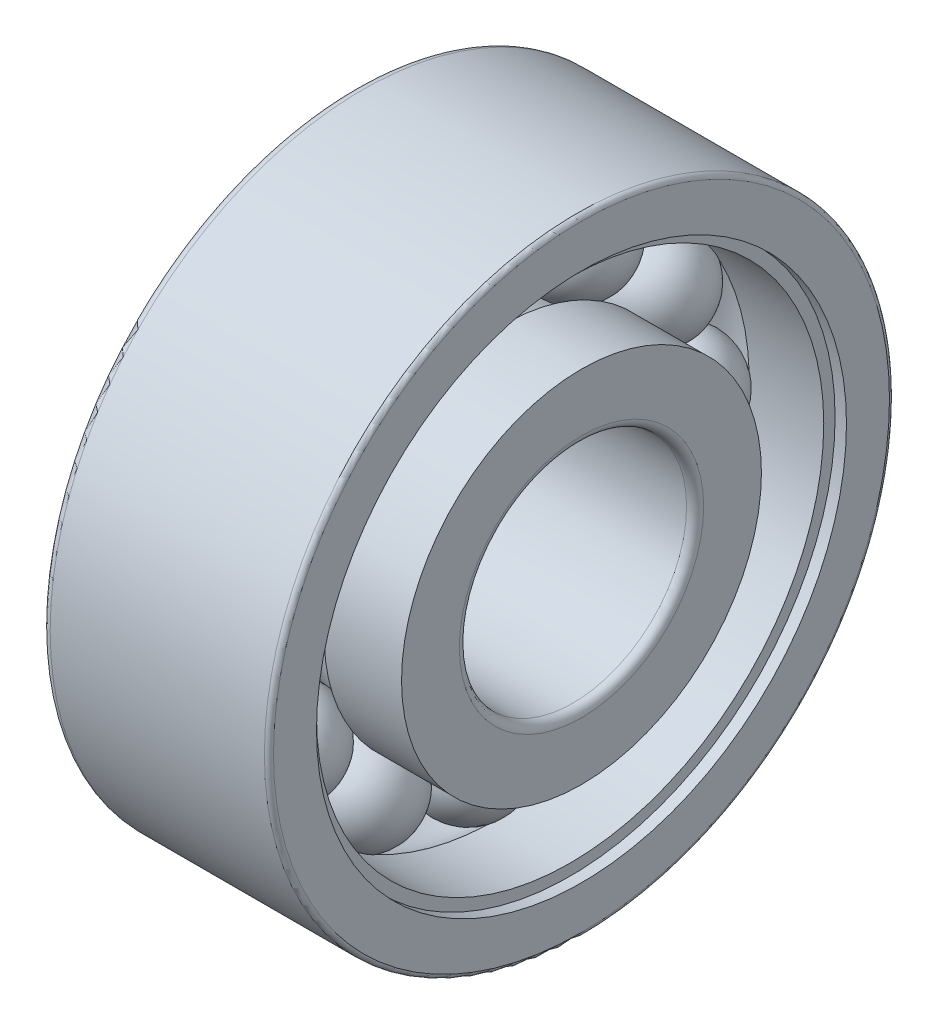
ISO-10303-21;
HEADER;
FILE_DESCRIPTION(('STEP AP214'),'2;1');
FILE_NAME('part.step','',(''),(''),'','','');
FILE_SCHEMA(('AUTOMOTIVE_DESIGN { 1 0 10303 214 1 1 1 1 }'));
ENDSEC;
DATA;
#1=APPLICATION_CONTEXT('core data for automotive mechanical design processes');
#2=APPLICATION_PROTOCOL_DEFINITION('international standard','automotive_design',2000,#1);
#3=PRODUCT_CONTEXT('',#1,'mechanical');
#4=PRODUCT('Part','Part','',(#3));
#5=PRODUCT_RELATED_PRODUCT_CATEGORY('part','',(#4));
#6=PRODUCT_DEFINITION_FORMATION('','',#4);
#7=PRODUCT_DEFINITION_CONTEXT('part definition',#1,'design');
#8=PRODUCT_DEFINITION('design','',#6,#7);
#9=PRODUCT_DEFINITION_SHAPE('','',#8);
#10=(LENGTH_UNIT() NAMED_UNIT(*) SI_UNIT(.MILLI.,.METRE.));
#11=(NAMED_UNIT(*) PLANE_ANGLE_UNIT() SI_UNIT($,.RADIAN.));
#12=(NAMED_UNIT(*) SI_UNIT($,.STERADIAN.) SOLID_ANGLE_UNIT());
#13=UNCERTAINTY_MEASURE_WITH_UNIT(LENGTH_MEASURE(1.E-05),#10,'distance_accuracy_value','');
#14=(GEOMETRIC_REPRESENTATION_CONTEXT(3) GLOBAL_UNCERTAINTY_ASSIGNED_CONTEXT((#13)) GLOBAL_UNIT_ASSIGNED_CONTEXT((#10,
#11,#12)) REPRESENTATION_CONTEXT('',''));
#15=CARTESIAN_POINT('',(0.,0.,0.));
#16=DIRECTION('',(0.,0.,1.));
#17=DIRECTION('',(1.,0.,0.));
#18=AXIS2_PLACEMENT_3D('',#15,#16,#17);
#19=CARTESIAN_POINT('',(0.,0.,0.));
#20=DIRECTION('',(-1.,0.,0.));
#21=DIRECTION('',(0.,0.,1.));
#22=AXIS2_PLACEMENT_3D('',#19,#20,#21);
#23=TOROIDAL_SURFACE('',#22,3.75,0.865000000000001);
#24=CARTESIAN_POINT('',(0.638707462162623,0.,0.));
#25=DIRECTION('',(-1.,0.,0.));
#26=DIRECTION('',(0.,0.,1.));
#27=AXIS2_PLACEMENT_3D('',#24,#25,#26);
#28=CIRCLE('',#27,3.16666666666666);
#29=CARTESIAN_POINT('',(0.638707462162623,3.16434666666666,-0.12119385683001));
#30=VERTEX_POINT('',#29);
#31=CARTESIAN_POINT('',(0.638707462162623,2.80100152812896,-1.4772163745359));
#32=VERTEX_POINT('',#31);
#33=EDGE_CURVE('E831',#30,#32,#28,.T.);
#34=ORIENTED_EDGE('',*,*,#33,.T.);
#35=CARTESIAN_POINT('',(0.638907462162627,2.80119333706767,-1.47732227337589));
#36=CARTESIAN_POINT('',(0.606136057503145,2.76969961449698,-1.45993434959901));
#37=CARTESIAN_POINT('',(0.570280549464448,2.74068118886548,-1.44391985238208));
#38=CARTESIAN_POINT('',(0.493563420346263,2.68831702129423,-1.41503021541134));
#39=CARTESIAN_POINT('',(0.452705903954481,2.66496667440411,-1.40215252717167));
#40=CARTESIAN_POINT('',(0.367069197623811,2.6245974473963,-1.37989408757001));
#41=CARTESIAN_POINT('',(0.322288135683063,2.60758161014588,-1.37051501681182));
#42=CARTESIAN_POINT('',(0.230106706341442,2.58037577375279,-1.35552138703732));
#43=CARTESIAN_POINT('',(0.182706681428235,2.57018488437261,-1.34990633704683));
#44=CARTESIAN_POINT('',(0.0866292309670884,2.55691936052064,-1.34259752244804));
#45=CARTESIAN_POINT('',(0.0379519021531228,2.55384418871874,-1.34090346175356));
#46=CARTESIAN_POINT('',(-0.0593031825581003,2.55489581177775,-1.34148281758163));
#47=CARTESIAN_POINT('',(-0.107880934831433,2.55902286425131,-1.34375637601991));
#48=CARTESIAN_POINT('',(-0.203550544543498,2.57436084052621,-1.35220728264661));
#49=CARTESIAN_POINT('',(-0.25064252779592,2.58557116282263,-1.35838429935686));
#50=CARTESIAN_POINT('',(-0.342013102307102,2.61475551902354,-1.37446923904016));
#51=CARTESIAN_POINT('',(-0.386291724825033,2.63272947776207,-1.38437712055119));
#52=CARTESIAN_POINT('',(-0.467688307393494,2.67339120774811,-1.4067986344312));
#53=CARTESIAN_POINT('',(-0.505092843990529,2.6956410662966,-1.41907034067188));
#54=CARTESIAN_POINT('',(-0.57551375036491,2.7449510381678,-1.44627630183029));
#55=CARTESIAN_POINT('',(-0.608529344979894,2.77201199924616,-1.46121102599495));
#56=CARTESIAN_POINT('',(-0.638907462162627,2.80119333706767,-1.47732227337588));
#57=B_SPLINE_CURVE_WITH_KNOTS('',3,(#35,#36,#37,#38,#39,#40,#41,#42,#43,#44,#45,#46,#47,#48,#49,
#50,#51,#52,#53,#54,#55,#56),.UNSPECIFIED.,.F.,.F.,(4,2,2,2,2,2,2,2,2,2,4),(0.,
0.145797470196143,0.29147608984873,0.437224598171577,0.582954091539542,0.728672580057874,
0.87439628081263,1.02010760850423,1.16581731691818,1.30092953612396,1.43606558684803),.UNSPECIFIED.);
#58=CARTESIAN_POINT('',(-0.638707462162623,2.80100152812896,-1.4772163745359));
#59=VERTEX_POINT('',#58);
#60=EDGE_CURVE('E622',#32,#59,#57,.T.);
#61=ORIENTED_EDGE('',*,*,#60,.T.);
#62=CARTESIAN_POINT('',(-0.638707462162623,0.,0.));
#63=DIRECTION('',(-1.,0.,0.));
#64=DIRECTION('',(0.,0.,1.));
#65=AXIS2_PLACEMENT_3D('',#62,#63,#64);
#66=CIRCLE('',#65,3.16666666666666);
#67=CARTESIAN_POINT('',(-0.638707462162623,3.16434666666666,-0.12119385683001));
#68=VERTEX_POINT('',#67);
#69=EDGE_CURVE('E826',#68,#59,#66,.T.);
#70=ORIENTED_EDGE('',*,*,#69,.F.);
#71=CARTESIAN_POINT('',(0.638907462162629,3.16456572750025,-0.12119805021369));
#72=CARTESIAN_POINT('',(0.606136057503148,3.12859740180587,-0.120509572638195));
#73=CARTESIAN_POINT('',(0.57028054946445,3.09545945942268,-0.11986932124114));
#74=CARTESIAN_POINT('',(0.493563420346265,3.03566594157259,-0.118706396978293));
#75=CARTESIAN_POINT('',(0.452705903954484,3.00900510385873,-0.118183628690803));
#76=CARTESIAN_POINT('',(0.367069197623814,2.962915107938,-0.117275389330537));
#77=CARTESIAN_POINT('',(0.322288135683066,2.94348942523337,-0.116889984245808));
#78=CARTESIAN_POINT('',(0.230106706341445,2.91243166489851,-0.116271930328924));
#79=CARTESIAN_POINT('',(0.182706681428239,2.90079857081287,-0.116039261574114));
#80=CARTESIAN_POINT('',(0.086629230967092,2.88565588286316,-0.115736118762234));
#81=CARTESIAN_POINT('',(0.0379519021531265,2.88214567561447,-0.11566563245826));
#82=CARTESIAN_POINT('',(-0.0593031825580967,2.88334608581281,-0.11568970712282));
#83=CARTESIAN_POINT('',(-0.107880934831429,2.8880569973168,-0.115784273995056));
#84=CARTESIAN_POINT('',(-0.203550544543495,2.90556552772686,-0.116134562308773));
#85=CARTESIAN_POINT('',(-0.250642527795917,2.9183624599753,-0.116390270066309));
#86=CARTESIAN_POINT('',(-0.342013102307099,2.95167932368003,-0.117052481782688));
#87=CARTESIAN_POINT('',(-0.38629172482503,2.97219916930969,-0.117458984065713));
#88=CARTESIAN_POINT('',(-0.467688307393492,3.01862401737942,-0.118372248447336));
#89=CARTESIAN_POINT('',(-0.505092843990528,3.04402881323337,-0.118869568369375));
#90=CARTESIAN_POINT('',(-0.575513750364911,3.10033548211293,-0.119963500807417));
#91=CARTESIAN_POINT('',(-0.608529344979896,3.13123832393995,-0.120560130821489));
#92=CARTESIAN_POINT('',(-0.638907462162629,3.16456572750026,-0.121198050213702));
#93=B_SPLINE_CURVE_WITH_KNOTS('',3,(#71,#72,#73,#74,#75,#76,#77,#78,#79,#80,#81,#82,#83,#84,#85,
#86,#87,#88,#89,#90,#91,#92),.UNSPECIFIED.,.F.,.F.,(4,2,2,2,2,2,2,2,2,2,4),(0.,
0.145797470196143,0.29147608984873,0.437224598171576,0.582954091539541,0.728672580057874,
0.87439628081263,1.02010760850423,1.16581731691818,1.30092953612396,1.43606558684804),.UNSPECIFIED.);
#94=EDGE_CURVE('E478',#30,#68,#93,.T.);
#95=ORIENTED_EDGE('',*,*,#94,.F.);
#96=EDGE_LOOP('',(#34,#61,#70,#95));
#97=FACE_BOUND('',#96,.T.);
#98=ADVANCED_FACE('F33',(#97),#23,.F.);
#99=CARTESIAN_POINT('',(0.,0.,0.));
#100=DIRECTION('',(-1.,0.,0.));
#101=DIRECTION('',(0.,0.,1.));
#102=AXIS2_PLACEMENT_3D('',#99,#100,#101);
#103=TOROIDAL_SURFACE('',#102,3.75,0.865000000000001);
#104=CARTESIAN_POINT('',(0.489265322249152,0.,0.));
#105=DIRECTION('',(-1.,0.,0.));
#106=DIRECTION('',(0.,0.,1.));
#107=AXIS2_PLACEMENT_3D('',#104,#105,#106);
#108=CIRCLE('',#107,4.46333333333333);
#109=CARTESIAN_POINT('',(0.489265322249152,3.79140560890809,-2.35511951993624));
#110=VERTEX_POINT('',#109);
#111=CARTESIAN_POINT('',(0.489265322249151,2.35511951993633,-3.79140560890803));
#112=VERTEX_POINT('',#111);
#113=EDGE_CURVE('E360',#110,#112,#108,.T.);
#114=ORIENTED_EDGE('',*,*,#113,.F.);
#115=CARTESIAN_POINT('',(0.489465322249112,3.79128788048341,-2.3550489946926));
#116=CARTESIAN_POINT('',(0.449372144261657,3.81493859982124,-2.36921681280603));
#117=CARTESIAN_POINT('',(0.406920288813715,3.83562374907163,-2.38160600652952));
#118=CARTESIAN_POINT('',(0.318612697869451,3.87060453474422,-2.40255523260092));
#119=CARTESIAN_POINT('',(0.272759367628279,3.88490463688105,-2.41111794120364));
#120=CARTESIAN_POINT('',(0.178879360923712,3.9066967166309,-2.42416609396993));
#121=CARTESIAN_POINT('',(0.130851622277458,3.91418532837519,-2.42864952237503));
#122=CARTESIAN_POINT('',(0.034026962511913,3.92213794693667,-2.43341073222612));
#123=CARTESIAN_POINT('',(-0.0147697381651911,3.92260393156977,-2.433689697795));
#124=CARTESIAN_POINT('',(-0.111753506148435,3.91650129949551,-2.43003609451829));
#125=CARTESIAN_POINT('',(-0.159940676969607,3.90993389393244,-2.42610425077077));
#126=CARTESIAN_POINT('',(-0.254373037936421,3.88994721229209,-2.41413730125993));
#127=CARTESIAN_POINT('',(-0.300617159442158,3.87652421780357,-2.40609996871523));
#128=CARTESIAN_POINT('',(-0.389848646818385,3.84320073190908,-2.38614396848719));
#129=CARTESIAN_POINT('',(-0.432833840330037,3.82329596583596,-2.37422273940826));
#130=CARTESIAN_POINT('',(-0.514228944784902,3.77760172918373,-2.34685077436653));
#131=CARTESIAN_POINT('',(-0.552647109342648,3.7518231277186,-2.3314065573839));
#132=CARTESIAN_POINT('',(-0.605848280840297,3.70949942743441,-2.30604419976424));
#133=CARTESIAN_POINT('',(-0.622754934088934,3.69488166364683,-2.2972836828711));
#134=CARTESIAN_POINT('',(-0.638907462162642,3.67969015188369,-2.28817824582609));
#135=B_SPLINE_CURVE_WITH_KNOTS('',3,(#115,#116,#117,#118,#119,#120,#121,#122,#123,#124,#125,
#126,#127,#128,#129,#130,#131,#132,#133,#134),.UNSPECIFIED.,.F.,.F.,(4,2,2,2,2,2,2,2,2,4),(0.,
0.145778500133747,0.29145488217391,0.437203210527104,0.582910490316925,0.728592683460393,
0.874353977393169,1.02021159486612,1.16580147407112,1.23772946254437),.UNSPECIFIED.);
#136=CARTESIAN_POINT('',(-0.638707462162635,3.67987807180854,-2.28829088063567));
#137=VERTEX_POINT('',#136);
#138=EDGE_CURVE('E56',#110,#137,#135,.T.);
#139=ORIENTED_EDGE('',*,*,#138,.T.);
#140=CARTESIAN_POINT('',(-0.638707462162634,0.,0.));
#141=DIRECTION('',(-1.,0.,0.));
#142=DIRECTION('',(0.,0.,1.));
#143=AXIS2_PLACEMENT_3D('',#140,#141,#142);
#144=CIRCLE('',#143,4.33333333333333);
#145=CARTESIAN_POINT('',(-0.638707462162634,2.28829088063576,-3.67987807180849));
#146=VERTEX_POINT('',#145);
#147=EDGE_CURVE('E819',#137,#146,#144,.T.);
#148=ORIENTED_EDGE('',*,*,#147,.T.);
#149=CARTESIAN_POINT('',(-0.638907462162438,2.28817824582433,-3.67969015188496));
#150=CARTESIAN_POINT('',(-0.60613742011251,2.30667132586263,-3.71054411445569));
#151=CARTESIAN_POINT('',(-0.570283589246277,2.32370609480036,-3.7389719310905));
#152=CARTESIAN_POINT('',(-0.493565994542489,2.35444137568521,-3.79027196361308));
#153=CARTESIAN_POINT('',(-0.452705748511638,2.36814420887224,-3.81314804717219));
#154=CARTESIAN_POINT('',(-0.367062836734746,2.39183081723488,-3.85269611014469));
#155=CARTESIAN_POINT('',(-0.322278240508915,2.40181274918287,-3.86936501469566));
#156=CARTESIAN_POINT('',(-0.23009679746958,2.41776933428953,-3.89601289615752));
#157=CARTESIAN_POINT('',(-0.182700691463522,2.42374511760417,-3.90599375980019));
#158=CARTESIAN_POINT('',(-0.0866378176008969,2.43152344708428,-3.91898553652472));
#159=CARTESIAN_POINT('',(-0.0379713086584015,2.43332683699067,-3.92199785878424));
#160=CARTESIAN_POINT('',(0.0592878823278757,2.43271152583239,-3.92097009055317));
#161=CARTESIAN_POINT('',(0.107880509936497,2.43029053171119,-3.91692616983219));
#162=CARTESIAN_POINT('',(0.203609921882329,2.42129010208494,-3.90189339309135));
#163=CARTESIAN_POINT('',(0.250745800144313,2.41470813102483,-3.89090030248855));
#164=CARTESIAN_POINT('',(0.342123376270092,2.39757522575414,-3.86228872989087));
#165=CARTESIAN_POINT('',(0.386370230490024,2.38703160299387,-3.8446824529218));
#166=CARTESIAN_POINT('',(0.449388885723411,2.36856618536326,-3.81385322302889));
#167=CARTESIAN_POINT('',(0.469717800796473,2.36201915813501,-3.80292326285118));
#168=CARTESIAN_POINT('',(0.489465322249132,2.35504899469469,-3.79128788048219));
#169=B_SPLINE_CURVE_WITH_KNOTS('',3,(#149,#150,#151,#152,#153,#154,#155,#156,#157,#158,#159,
#160,#161,#162,#163,#164,#165,#166,#167,#168),.UNSPECIFIED.,.F.,.F.,(4,2,2,2,2,2,2,2,2,4),(0.,
0.145787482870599,0.29147310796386,0.437230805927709,0.582947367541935,0.728634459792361,
0.874400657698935,1.02025576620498,1.16584300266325,1.23772936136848),.UNSPECIFIED.);
#170=EDGE_CURVE('E1719',#146,#112,#169,.T.);
#171=ORIENTED_EDGE('',*,*,#170,.T.);
#172=EDGE_LOOP('',(#114,#139,#148,#171));
#173=FACE_BOUND('',#172,.T.);
#174=ADVANCED_FACE('F933',(#173),#103,.F.);
#175=CARTESIAN_POINT('',(-0.638707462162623,2.67980767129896,-1.6871302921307));
#176=VERTEX_POINT('',#175);
#177=CARTESIAN_POINT('',(-0.638707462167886,1.68713029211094,-2.6798076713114));
#178=VERTEX_POINT('',#177);
#179=EDGE_CURVE('E830',#176,#178,#66,.T.);
#180=ORIENTED_EDGE('',*,*,#179,.F.);
#181=CARTESIAN_POINT('',(-0.638907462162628,2.67999528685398,-1.68724345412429));
#182=CARTESIAN_POINT('',(-0.606136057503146,2.64919004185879,-1.66866305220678));
#183=CARTESIAN_POINT('',(-0.570280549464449,2.62081186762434,-1.65153960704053));
#184=CARTESIAN_POINT('',(-0.493563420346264,2.56961062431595,-1.62063572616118));
#185=CARTESIAN_POINT('',(-0.452705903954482,2.54678304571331,-1.60685257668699));
#186=CARTESIAN_POINT('',(-0.367069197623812,2.50732205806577,-1.58302102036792));
#187=CARTESIAN_POINT('',(-0.322288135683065,2.49069162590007,-1.57297440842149));
#188=CARTESIAN_POINT('',(-0.230106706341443,2.46410384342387,-1.55691027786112));
#189=CARTESIAN_POINT('',(-0.182706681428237,2.4541456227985,-1.55089223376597));
#190=CARTESIAN_POINT('',(-0.0866292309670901,2.44118324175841,-1.54305836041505));
#191=CARTESIAN_POINT('',(-0.0379519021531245,2.43817855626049,-1.54124221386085));
#192=CARTESIAN_POINT('',(0.0593031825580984,2.43920610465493,-1.54186326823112));
#193=CARTESIAN_POINT('',(0.107880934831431,2.44323859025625,-1.54430062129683));
#194=CARTESIAN_POINT('',(0.203550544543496,2.45822627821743,-1.55335824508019));
#195=CARTESIAN_POINT('',(0.250642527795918,2.46918089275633,-1.55997816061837));
#196=CARTESIAN_POINT('',(0.3420131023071,2.49770303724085,-1.5772100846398));
#197=CARTESIAN_POINT('',(0.386291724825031,2.51527049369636,-1.58782204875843));
#198=CARTESIAN_POINT('',(0.467688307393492,2.55501895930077,-1.61182538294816));
#199=CARTESIAN_POINT('',(0.505092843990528,2.57677149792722,-1.62495847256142));
#200=CARTESIAN_POINT('',(0.57551375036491,2.62498753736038,-1.65405918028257));
#201=CARTESIAN_POINT('',(0.608529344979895,2.65145186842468,-1.67002729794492));
#202=CARTESIAN_POINT('',(0.638907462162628,2.67999528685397,-1.6872434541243));
#203=B_SPLINE_CURVE_WITH_KNOTS('',3,(#181,#182,#183,#184,#185,#186,#187,#188,#189,#190,#191,
#192,#193,#194,#195,#196,#197,#198,#199,#200,#201,#202),.UNSPECIFIED.,.F.,.F.,(4,2,2,2,2,2,2,2,
2,2,4),(0.,0.145797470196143,0.29147608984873,0.437224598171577,0.582954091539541,
0.728672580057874,0.874396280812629,1.02010760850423,1.16581731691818,1.30092953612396,
1.43606558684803),.UNSPECIFIED.);
#204=CARTESIAN_POINT('',(0.63870746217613,2.67980767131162,-1.68713029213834));
#205=VERTEX_POINT('',#204);
#206=EDGE_CURVE('E48',#176,#205,#203,.T.);
#207=ORIENTED_EDGE('',*,*,#206,.T.);
#208=CARTESIAN_POINT('',(0.638707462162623,1.68713029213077,-2.67980767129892));
#209=VERTEX_POINT('',#208);
#210=EDGE_CURVE('E835',#205,#209,#28,.T.);
#211=ORIENTED_EDGE('',*,*,#210,.T.);
#212=CARTESIAN_POINT('',(0.638907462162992,1.68724345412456,-2.67999528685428));
#213=CARTESIAN_POINT('',(0.606136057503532,1.66866305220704,-2.64919004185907));
#214=CARTESIAN_POINT('',(0.570280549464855,1.65153960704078,-2.6208118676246));
#215=CARTESIAN_POINT('',(0.493563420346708,1.62063572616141,-2.56961062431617));
#216=CARTESIAN_POINT('',(0.452705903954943,1.6068525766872,-2.54678304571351));
#217=CARTESIAN_POINT('',(0.367069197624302,1.5830210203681,-2.50732205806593));
#218=CARTESIAN_POINT('',(0.322288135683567,1.57297440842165,-2.49069162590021));
#219=CARTESIAN_POINT('',(0.230106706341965,1.55691027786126,-2.46410384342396));
#220=CARTESIAN_POINT('',(0.182706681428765,1.55089223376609,-2.45414562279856));
#221=CARTESIAN_POINT('',(0.0866292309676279,1.54305836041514,-2.44118324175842));
#222=CARTESIAN_POINT('',(0.0379519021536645,1.54124221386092,-2.43817855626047));
#223=CARTESIAN_POINT('',(-0.0593031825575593,1.54186326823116,-2.43920610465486));
#224=CARTESIAN_POINT('',(-0.107880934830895,1.54430062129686,-2.44323859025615));
#225=CARTESIAN_POINT('',(-0.203550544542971,1.55335824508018,-2.45822627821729));
#226=CARTESIAN_POINT('',(-0.250642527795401,1.55997816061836,-2.46918089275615));
#227=CARTESIAN_POINT('',(-0.342013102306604,1.57721008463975,-2.49770303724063));
#228=CARTESIAN_POINT('',(-0.386291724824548,1.58782204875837,-2.51527049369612));
#229=CARTESIAN_POINT('',(-0.467688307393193,1.61182538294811,-2.55501895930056));
#230=CARTESIAN_POINT('',(-0.505092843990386,1.62495847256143,-2.57677149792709));
#231=CARTESIAN_POINT('',(-0.57551375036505,1.65405918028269,-2.62498753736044));
#232=CARTESIAN_POINT('',(-0.608529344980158,1.67002729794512,-2.65145186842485));
#233=CARTESIAN_POINT('',(-0.638907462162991,1.68724345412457,-2.67999528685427));
#234=B_SPLINE_CURVE_WITH_KNOTS('',3,(#212,#213,#214,#215,#216,#217,#218,#219,#220,#221,#222,
#223,#224,#225,#226,#227,#228,#229,#230,#231,#232,#233),.UNSPECIFIED.,.F.,.F.,(4,2,2,2,2,2,2,2,
2,2,4),(0.,0.145797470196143,0.29147608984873,0.437224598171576,0.582954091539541,
0.728672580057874,0.874396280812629,1.02010760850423,1.16581731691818,1.3009295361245,
1.43606558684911),.UNSPECIFIED.);
#235=EDGE_CURVE('E611',#209,#178,#234,.T.);
#236=ORIENTED_EDGE('',*,*,#235,.T.);
#237=EDGE_LOOP('',(#180,#207,#211,#236));
#238=FACE_BOUND('',#237,.T.);
#239=ADVANCED_FACE('F934',(#238),#23,.F.);
#240=CARTESIAN_POINT('',(0.489265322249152,2.10589381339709,-3.93529613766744));
#241=VERTEX_POINT('',#240);
#242=CARTESIAN_POINT('',(0.489265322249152,0.143890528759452,-4.46101333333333));
#243=VERTEX_POINT('',#242);
#244=EDGE_CURVE('E365',#241,#243,#108,.T.);
#245=ORIENTED_EDGE('',*,*,#244,.F.);
#246=CARTESIAN_POINT('',(0.489465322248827,2.10582712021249,-3.93517619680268));
#247=CARTESIAN_POINT('',(0.449372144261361,2.1192253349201,-3.959271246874));
#248=CARTESIAN_POINT('',(0.406920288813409,2.13094460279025,-3.98034317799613));
#249=CARTESIAN_POINT('',(0.318612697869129,2.15076423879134,-4.01597613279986));
#250=CARTESIAN_POINT('',(0.272759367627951,2.15886713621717,-4.03054170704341));
#251=CARTESIAN_POINT('',(0.178879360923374,2.17121555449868,-4.05273777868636));
#252=CARTESIAN_POINT('',(0.130851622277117,2.17545916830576,-4.06036484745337));
#253=CARTESIAN_POINT('',(0.0340269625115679,2.17996573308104,-4.06846448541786));
#254=CARTESIAN_POINT('',(-0.0147697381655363,2.18022980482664,-4.06893906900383));
#255=CARTESIAN_POINT('',(-0.111753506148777,2.1767715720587,-4.06272363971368));
#256=CARTESIAN_POINT('',(-0.159940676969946,2.17304995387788,-4.05603486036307));
#257=CARTESIAN_POINT('',(-0.254373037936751,2.16172445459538,-4.03567783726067));
#258=CARTESIAN_POINT('',(-0.300617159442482,2.15411846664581,-4.02200580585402));
#259=CARTESIAN_POINT('',(-0.389848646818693,2.13523748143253,-3.98806165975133));
#260=CARTESIAN_POINT('',(-0.432833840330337,2.12396006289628,-3.96778518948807));
#261=CARTESIAN_POINT('',(-0.51422894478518,2.09807367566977,-3.92123325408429));
#262=CARTESIAN_POINT('',(-0.552647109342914,2.08347086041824,-3.89496886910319));
#263=CARTESIAN_POINT('',(-0.605848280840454,2.05949863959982,-3.85184257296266));
#264=CARTESIAN_POINT('',(-0.622754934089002,2.05121954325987,-3.8369468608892));
#265=CARTESIAN_POINT('',(-0.638907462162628,2.04261602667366,-3.82146556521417));
#266=B_SPLINE_CURVE_WITH_KNOTS('',3,(#246,#247,#248,#249,#250,#251,#252,#253,#254,#255,#256,
#257,#258,#259,#260,#261,#262,#263,#264,#265),.UNSPECIFIED.,.F.,.F.,(4,2,2,2,2,2,2,2,2,4),(0.,
0.145778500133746,0.291454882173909,0.437203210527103,0.582910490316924,0.728592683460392,
0.874353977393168,1.02021159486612,1.16580147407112,1.237729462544),.UNSPECIFIED.);
#267=CARTESIAN_POINT('',(-0.638707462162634,2.04272245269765,-3.82165706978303));
#268=VERTEX_POINT('',#267);
#269=EDGE_CURVE('E737',#241,#268,#266,.T.);
#270=ORIENTED_EDGE('',*,*,#269,.T.);
#271=CARTESIAN_POINT('',(-0.638707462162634,0.141778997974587,-4.33101333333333));
#272=VERTEX_POINT('',#271);
#273=EDGE_CURVE('E817',#268,#272,#144,.T.);
#274=ORIENTED_EDGE('',*,*,#273,.T.);
#275=CARTESIAN_POINT('',(-0.6389074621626,0.141775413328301,-4.33079427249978));
#276=CARTESIAN_POINT('',(-0.606137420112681,0.142363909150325,-4.36676112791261));
#277=CARTESIAN_POINT('',(-0.570283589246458,0.142902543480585,-4.39989772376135));
#278=CARTESIAN_POINT('',(-0.493565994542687,0.143870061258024,-4.45969249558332));
#279=CARTESIAN_POINT('',(-0.452705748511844,0.14429902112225,-4.48635518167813));
#280=CARTESIAN_POINT('',(-0.367062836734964,0.145038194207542,-4.53244811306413));
#281=CARTESIAN_POINT('',(-0.322278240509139,0.145348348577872,-4.55187477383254));
#282=CARTESIAN_POINT('',(-0.230096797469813,0.145843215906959,-4.58293080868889));
#283=CARTESIAN_POINT('',(-0.182700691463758,0.146027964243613,-4.59456238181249));
#284=CARTESIAN_POINT('',(-0.0866378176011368,0.146268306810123,-4.60970275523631));
#285=CARTESIAN_POINT('',(-0.0379713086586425,0.146323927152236,-4.61321319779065));
#286=CARTESIAN_POINT('',(0.0592878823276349,0.14630493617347,-4.61201546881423));
#287=CARTESIAN_POINT('',(0.107880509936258,0.146230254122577,-4.60730283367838));
#288=CARTESIAN_POINT('',(0.203609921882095,0.1459520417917,-4.5897838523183));
#289=CARTESIAN_POINT('',(0.250745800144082,0.145748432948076,-4.57697257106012));
#290=CARTESIAN_POINT('',(0.34212337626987,0.145216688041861,-4.543627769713));
#291=CARTESIAN_POINT('',(0.386370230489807,0.144888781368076,-4.52310847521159));
#292=CARTESIAN_POINT('',(0.449388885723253,0.144311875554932,-4.4871768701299));
#293=CARTESIAN_POINT('',(0.469717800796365,0.144106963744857,-4.4744377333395));
#294=CARTESIAN_POINT('',(0.489465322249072,0.143888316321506,-4.46087611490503));
#295=B_SPLINE_CURVE_WITH_KNOTS('',3,(#275,#276,#277,#278,#279,#280,#281,#282,#283,#284,#285,
#286,#287,#288,#289,#290,#291,#292,#293,#294),.UNSPECIFIED.,.F.,.F.,(4,2,2,2,2,2,2,2,2,4),(0.,
0.145787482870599,0.291473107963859,0.437230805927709,0.582947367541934,0.72863445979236,
0.874400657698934,1.02025576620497,1.16584300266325,1.23772936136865),.UNSPECIFIED.);
#296=EDGE_CURVE('E758',#272,#243,#295,.T.);
#297=ORIENTED_EDGE('',*,*,#296,.T.);
#298=EDGE_LOOP('',(#245,#270,#274,#297));
#299=FACE_BOUND('',#298,.T.);
#300=ADVANCED_FACE('F939',(#299),#103,.F.);
#301=CARTESIAN_POINT('',(-0.638707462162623,1.47721637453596,-2.80100152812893));
#302=VERTEX_POINT('',#301);
#303=CARTESIAN_POINT('',(-0.638707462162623,0.121193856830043,-3.16434666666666));
#304=VERTEX_POINT('',#303);
#305=EDGE_CURVE('E925',#302,#304,#66,.T.);
#306=ORIENTED_EDGE('',*,*,#305,.F.);
#307=CARTESIAN_POINT('',(-0.638907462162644,1.47732227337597,-2.80119333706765));
#308=CARTESIAN_POINT('',(-0.606136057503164,1.45993434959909,-2.76969961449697));
#309=CARTESIAN_POINT('',(-0.570280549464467,1.44391985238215,-2.74068118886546));
#310=CARTESIAN_POINT('',(-0.493563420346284,1.41503021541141,-2.68831702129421));
#311=CARTESIAN_POINT('',(-0.452705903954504,1.40215252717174,-2.66496667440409));
#312=CARTESIAN_POINT('',(-0.367069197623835,1.37989408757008,-2.62459744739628));
#313=CARTESIAN_POINT('',(-0.322288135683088,1.37051501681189,-2.60758161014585));
#314=CARTESIAN_POINT('',(-0.230106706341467,1.35552138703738,-2.58037577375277));
#315=CARTESIAN_POINT('',(-0.182706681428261,1.34990633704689,-2.57018488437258));
#316=CARTESIAN_POINT('',(-0.0866292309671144,1.3425975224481,-2.55691936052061));
#317=CARTESIAN_POINT('',(-0.0379519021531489,1.34090346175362,-2.55384418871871));
#318=CARTESIAN_POINT('',(0.059303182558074,1.34148281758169,-2.55489581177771));
#319=CARTESIAN_POINT('',(0.107880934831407,1.34375637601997,-2.55902286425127));
#320=CARTESIAN_POINT('',(0.203550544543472,1.35220728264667,-2.57436084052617));
#321=CARTESIAN_POINT('',(0.250642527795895,1.35838429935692,-2.58557116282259));
#322=CARTESIAN_POINT('',(0.342013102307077,1.37446923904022,-2.61475551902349));
#323=CARTESIAN_POINT('',(0.386291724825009,1.38437712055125,-2.63272947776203));
#324=CARTESIAN_POINT('',(0.467688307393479,1.40679863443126,-2.67339120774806));
#325=CARTESIAN_POINT('',(0.505092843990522,1.41907034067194,-2.69564106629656));
#326=CARTESIAN_POINT('',(0.575513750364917,1.44627630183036,-2.74495103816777));
#327=CARTESIAN_POINT('',(0.608529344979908,1.46121102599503,-2.77201199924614));
#328=CARTESIAN_POINT('',(0.638907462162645,1.47732227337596,-2.80119333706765));
#329=B_SPLINE_CURVE_WITH_KNOTS('',3,(#307,#308,#309,#310,#311,#312,#313,#314,#315,#316,#317,
#318,#319,#320,#321,#322,#323,#324,#325,#326,#327,#328),.UNSPECIFIED.,.F.,.F.,(4,2,2,2,2,2,2,2,
2,2,4),(0.,0.145797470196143,0.29147608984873,0.437224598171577,0.582954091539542,
0.728672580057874,0.87439628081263,1.02010760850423,1.16581731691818,1.30092953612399,
1.43606558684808),.UNSPECIFIED.);
#330=CARTESIAN_POINT('',(0.63870746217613,1.47721637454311,-2.80100152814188));
#331=VERTEX_POINT('',#330);
#332=EDGE_CURVE('E604',#302,#331,#329,.T.);
#333=ORIENTED_EDGE('',*,*,#332,.T.);
#334=CARTESIAN_POINT('',(0.638707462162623,0.121193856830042,-3.16434666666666));
#335=VERTEX_POINT('',#334);
#336=EDGE_CURVE('E1050',#331,#335,#28,.T.);
#337=ORIENTED_EDGE('',*,*,#336,.T.);
#338=CARTESIAN_POINT('',(0.638907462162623,0.121198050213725,-3.16456572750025));
#339=CARTESIAN_POINT('',(0.606136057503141,0.120509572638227,-3.12859740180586));
#340=CARTESIAN_POINT('',(0.570280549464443,0.119869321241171,-3.09545945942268));
#341=CARTESIAN_POINT('',(0.493563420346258,0.118706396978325,-3.03566594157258));
#342=CARTESIAN_POINT('',(0.452705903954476,0.118183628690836,-3.00900510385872));
#343=CARTESIAN_POINT('',(0.367069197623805,0.117275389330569,-2.96291510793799));
#344=CARTESIAN_POINT('',(0.322288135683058,0.116889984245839,-2.94348942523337));
#345=CARTESIAN_POINT('',(0.230106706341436,0.116271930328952,-2.9124316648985));
#346=CARTESIAN_POINT('',(0.182706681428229,0.116039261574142,-2.90079857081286));
#347=CARTESIAN_POINT('',(0.0866292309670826,0.115736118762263,-2.88565588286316));
#348=CARTESIAN_POINT('',(0.0379519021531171,0.115665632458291,-2.88214567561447));
#349=CARTESIAN_POINT('',(-0.0593031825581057,0.115689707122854,-2.88334608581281));
#350=CARTESIAN_POINT('',(-0.107880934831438,0.115784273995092,-2.8880569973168));
#351=CARTESIAN_POINT('',(-0.203550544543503,0.116134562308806,-2.90556552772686));
#352=CARTESIAN_POINT('',(-0.250642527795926,0.116390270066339,-2.9183624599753));
#353=CARTESIAN_POINT('',(-0.342013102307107,0.117052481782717,-2.95167932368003));
#354=CARTESIAN_POINT('',(-0.386291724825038,0.117458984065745,-2.97219916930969));
#355=CARTESIAN_POINT('',(-0.467688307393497,0.11837224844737,-3.01862401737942));
#356=CARTESIAN_POINT('',(-0.50509284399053,0.118869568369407,-3.04402881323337));
#357=CARTESIAN_POINT('',(-0.575513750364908,0.119963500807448,-3.10033548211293));
#358=CARTESIAN_POINT('',(-0.608529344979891,0.120560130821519,-3.13123832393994));
#359=CARTESIAN_POINT('',(-0.638907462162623,0.121198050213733,-3.16456572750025));
#360=B_SPLINE_CURVE_WITH_KNOTS('',3,(#338,#339,#340,#341,#342,#343,#344,#345,#346,#347,#348,
#349,#350,#351,#352,#353,#354,#355,#356,#357,#358,#359),.UNSPECIFIED.,.F.,.F.,(4,2,2,2,2,2,2,2,
2,2,4),(0.,0.145797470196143,0.29147608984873,0.437224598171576,0.582954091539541,
0.728672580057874,0.874396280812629,1.02010760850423,1.16581731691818,1.30092953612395,
1.43606558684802),.UNSPECIFIED.);
#361=EDGE_CURVE('E597',#335,#304,#360,.T.);
#362=ORIENTED_EDGE('',*,*,#361,.T.);
#363=EDGE_LOOP('',(#306,#333,#337,#362));
#364=FACE_BOUND('',#363,.T.);
#365=ADVANCED_FACE('F941',(#364),#23,.F.);
#366=CARTESIAN_POINT('',(0.489265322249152,-0.143890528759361,-4.46101333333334));
#367=VERTEX_POINT('',#366);
#368=CARTESIAN_POINT('',(0.489265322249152,-2.10589381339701,-3.93529613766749));
#369=VERTEX_POINT('',#368);
#370=EDGE_CURVE('E810',#367,#369,#108,.T.);
#371=ORIENTED_EDGE('',*,*,#370,.F.);
#372=CARTESIAN_POINT('',(0.489465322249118,-0.143888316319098,-4.46087611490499));
#373=CARTESIAN_POINT('',(0.449372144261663,-0.144332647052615,-4.48844214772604));
#374=CARTESIAN_POINT('',(0.406920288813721,-0.144719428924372,-4.5125506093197));
#375=CARTESIAN_POINT('',(0.318612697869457,-0.145371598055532,-4.5533194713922));
#376=CARTESIAN_POINT('',(0.272759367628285,-0.145637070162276,-4.56998507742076));
#377=CARTESIAN_POINT('',(0.178879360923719,-0.146041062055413,-4.59538164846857));
#378=CARTESIAN_POINT('',(0.130851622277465,-0.146179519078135,-4.60410869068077));
#379=CARTESIAN_POINT('',(0.0340269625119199,-0.146326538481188,-4.61337646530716));
#380=CARTESIAN_POINT('',(-0.0147697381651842,-0.146335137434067,-4.61391950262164));
#381=CARTESIAN_POINT('',(-0.111753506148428,-0.146222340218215,-4.60680766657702));
#382=CARTESIAN_POINT('',(-0.1599406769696,-0.146100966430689,-4.59915420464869));
#383=CARTESIAN_POINT('',(-0.254373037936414,-0.145730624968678,-4.57586175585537));
#384=CARTESIAN_POINT('',(-0.300617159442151,-0.145481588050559,-4.56021843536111));
#385=CARTESIAN_POINT('',(-0.389848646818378,-0.144860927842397,-4.52138144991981));
#386=CARTESIAN_POINT('',(-0.432833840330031,-0.144489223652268,-4.49818280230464));
#387=CARTESIAN_POINT('',(-0.514228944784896,-0.143631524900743,-4.4449244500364));
#388=CARTESIAN_POINT('',(-0.552647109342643,-0.14314574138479,-4.41487741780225));
#389=CARTESIAN_POINT('',(-0.605848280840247,-0.142343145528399,-4.36554283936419));
#390=CARTESIAN_POINT('',(-0.622754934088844,-0.142065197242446,-4.34850322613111));
#391=CARTESIAN_POINT('',(-0.638907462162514,-0.141775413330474,-4.33079427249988));
#392=B_SPLINE_CURVE_WITH_KNOTS('',3,(#372,#373,#374,#375,#376,#377,#378,#379,#380,#381,#382,
#383,#384,#385,#386,#387,#388,#389,#390,#391),.UNSPECIFIED.,.F.,.F.,(4,2,2,2,2,2,2,2,2,4),(0.,
0.145778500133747,0.29145488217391,0.437203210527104,0.582910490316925,0.728592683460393,
0.874353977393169,1.02021159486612,1.16580147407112,1.23772946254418),.UNSPECIFIED.);
#393=CARTESIAN_POINT('',(-0.638707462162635,-0.141778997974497,-4.33101333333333));
#394=VERTEX_POINT('',#393);
#395=EDGE_CURVE('E762',#367,#394,#392,.T.);
#396=ORIENTED_EDGE('',*,*,#395,.T.);
#397=CARTESIAN_POINT('',(-0.638707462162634,-2.04272245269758,-3.82165706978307));
#398=VERTEX_POINT('',#397);
#399=EDGE_CURVE('E808',#394,#398,#144,.T.);
#400=ORIENTED_EDGE('',*,*,#399,.T.);
#401=CARTESIAN_POINT('',(-0.638907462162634,-2.04261602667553,-3.82146556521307));
#402=CARTESIAN_POINT('',(-0.606137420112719,-2.06008980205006,-3.85290802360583));
#403=CARTESIAN_POINT('',(-0.570283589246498,-2.07619162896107,-3.88187447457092));
#404=CARTESIAN_POINT('',(-0.493565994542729,-2.10525111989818,-3.93414202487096));
#405=CARTESIAN_POINT('',(-0.452705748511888,-2.11821097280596,-3.95744706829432));
#406=CARTESIAN_POINT('',(-0.36706283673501,-2.1406172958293,-3.99773430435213));
#407=CARTESIAN_POINT('',(-0.322278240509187,-2.15006202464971,-4.01471336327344));
#408=CARTESIAN_POINT('',(-0.230096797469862,-2.1651614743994,-4.0418561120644));
#409=CARTESIAN_POINT('',(-0.182700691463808,-2.17081726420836,-4.05202172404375));
#410=CARTESIAN_POINT('',(-0.0866378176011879,-2.17817930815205,-4.06525384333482));
#411=CARTESIAN_POINT('',(-0.0379713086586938,-2.17988636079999,-4.06832178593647));
#412=CARTESIAN_POINT('',(0.0592878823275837,-2.17930394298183,-4.06727502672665));
#413=CARTESIAN_POINT('',(0.107880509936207,-2.1770123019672,-4.0631564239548));
#414=CARTESIAN_POINT('',(0.203609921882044,-2.16849375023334,-4.04784543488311));
#415=CARTESIAN_POINT('',(0.250745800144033,-2.16226444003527,-4.03664873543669));
#416=CARTESIAN_POINT('',(0.342123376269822,-2.14605254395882,-4.00750541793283));
#417=CARTESIAN_POINT('',(0.386370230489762,-2.13607687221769,-3.98957123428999));
#418=CARTESIAN_POINT('',(0.449388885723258,-2.11861068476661,-3.95816509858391));
#419=CARTESIAN_POINT('',(0.469717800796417,-2.11241857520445,-3.94703022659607));
#420=CARTESIAN_POINT('',(0.489465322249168,-2.10582712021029,-3.93517619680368));
#421=B_SPLINE_CURVE_WITH_KNOTS('',3,(#401,#402,#403,#404,#405,#406,#407,#408,#409,#410,#411,
#412,#413,#414,#415,#416,#417,#418,#419,#420),.UNSPECIFIED.,.F.,.F.,(4,2,2,2,2,2,2,2,2,4),(0.,
0.145787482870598,0.291473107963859,0.437230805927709,0.582947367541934,0.72863445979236,
0.874400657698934,1.02025576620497,1.16584300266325,1.23772936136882),.UNSPECIFIED.);
#422=EDGE_CURVE('E1060',#398,#369,#421,.T.);
#423=ORIENTED_EDGE('',*,*,#422,.T.);
#424=EDGE_LOOP('',(#371,#396,#400,#423));
#425=FACE_BOUND('',#424,.T.);
#426=ADVANCED_FACE('F806',(#425),#103,.F.);
#427=CARTESIAN_POINT('',(-0.638707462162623,-0.121193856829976,-3.16434666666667));
#428=VERTEX_POINT('',#427);
#429=CARTESIAN_POINT('',(-0.638707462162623,-1.4772163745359,-2.80100152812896));
#430=VERTEX_POINT('',#429);
#431=EDGE_CURVE('E921',#428,#430,#66,.T.);
#432=ORIENTED_EDGE('',*,*,#431,.F.);
#433=CARTESIAN_POINT('',(-0.638907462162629,-0.121198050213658,-3.16456572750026));
#434=CARTESIAN_POINT('',(-0.606136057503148,-0.120509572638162,-3.12859740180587));
#435=CARTESIAN_POINT('',(-0.57028054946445,-0.119869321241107,-3.09545945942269));
#436=CARTESIAN_POINT('',(-0.493563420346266,-0.118706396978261,-3.03566594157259));
#437=CARTESIAN_POINT('',(-0.452705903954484,-0.118183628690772,-3.00900510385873));
#438=CARTESIAN_POINT('',(-0.367069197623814,-0.117275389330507,-2.962915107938));
#439=CARTESIAN_POINT('',(-0.322288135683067,-0.116889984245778,-2.94348942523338));
#440=CARTESIAN_POINT('',(-0.230106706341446,-0.116271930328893,-2.91243166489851));
#441=CARTESIAN_POINT('',(-0.18270668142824,-0.116039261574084,-2.90079857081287));
#442=CARTESIAN_POINT('',(-0.0866292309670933,-0.115736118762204,-2.88565588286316));
#443=CARTESIAN_POINT('',(-0.0379519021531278,-0.115665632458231,-2.88214567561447));
#444=CARTESIAN_POINT('',(0.0593031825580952,-0.115689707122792,-2.88334608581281));
#445=CARTESIAN_POINT('',(0.107880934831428,-0.115784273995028,-2.8880569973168));
#446=CARTESIAN_POINT('',(0.203550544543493,-0.116134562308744,-2.90556552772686));
#447=CARTESIAN_POINT('',(0.250642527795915,-0.116390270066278,-2.9183624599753));
#448=CARTESIAN_POINT('',(0.342013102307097,-0.117052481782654,-2.95167932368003));
#449=CARTESIAN_POINT('',(0.386291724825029,-0.117458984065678,-2.97219916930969));
#450=CARTESIAN_POINT('',(0.467688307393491,-0.118372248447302,-3.01862401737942));
#451=CARTESIAN_POINT('',(0.505092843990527,-0.118869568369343,-3.04402881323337));
#452=CARTESIAN_POINT('',(0.57551375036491,-0.119963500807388,-3.10033548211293));
#453=CARTESIAN_POINT('',(0.608529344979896,-0.120560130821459,-3.13123832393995));
#454=CARTESIAN_POINT('',(0.638907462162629,-0.121198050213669,-3.16456572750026));
#455=B_SPLINE_CURVE_WITH_KNOTS('',3,(#433,#434,#435,#436,#437,#438,#439,#440,#441,#442,#443,
#444,#445,#446,#447,#448,#449,#450,#451,#452,#453,#454),.UNSPECIFIED.,.F.,.F.,(4,2,2,2,2,2,2,2,
2,2,4),(0.,0.145797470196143,0.291476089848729,0.437224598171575,0.58295409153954,
0.728672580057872,0.874396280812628,1.02010760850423,1.16581731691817,1.30092953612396,
1.43606558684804),.UNSPECIFIED.);
#456=CARTESIAN_POINT('',(0.63870746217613,-0.12119385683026,-3.16434666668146));
#457=VERTEX_POINT('',#456);
#458=EDGE_CURVE('E589',#428,#457,#455,.T.);
#459=ORIENTED_EDGE('',*,*,#458,.T.);
#460=CARTESIAN_POINT('',(0.638707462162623,-1.4772163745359,-2.80100152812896));
#461=VERTEX_POINT('',#460);
#462=EDGE_CURVE('E1045',#457,#461,#28,.T.);
#463=ORIENTED_EDGE('',*,*,#462,.T.);
#464=CARTESIAN_POINT('',(0.638907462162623,-1.4773222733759,-2.80119333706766));
#465=CARTESIAN_POINT('',(0.606136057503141,-1.45993434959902,-2.76969961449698));
#466=CARTESIAN_POINT('',(0.570280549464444,-1.44391985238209,-2.74068118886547));
#467=CARTESIAN_POINT('',(0.493563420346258,-1.41503021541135,-2.68831702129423));
#468=CARTESIAN_POINT('',(0.452705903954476,-1.40215252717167,-2.6649666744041));
#469=CARTESIAN_POINT('',(0.367069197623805,-1.37989408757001,-2.6245974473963));
#470=CARTESIAN_POINT('',(0.322288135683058,-1.37051501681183,-2.60758161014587));
#471=CARTESIAN_POINT('',(0.230106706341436,-1.35552138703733,-2.58037577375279));
#472=CARTESIAN_POINT('',(0.182706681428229,-1.34990633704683,-2.5701848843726));
#473=CARTESIAN_POINT('',(0.0866292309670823,-1.34259752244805,-2.55691936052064));
#474=CARTESIAN_POINT('',(0.0379519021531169,-1.34090346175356,-2.55384418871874));
#475=CARTESIAN_POINT('',(-0.059303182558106,-1.34148281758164,-2.55489581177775));
#476=CARTESIAN_POINT('',(-0.107880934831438,-1.34375637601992,-2.5590228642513));
#477=CARTESIAN_POINT('',(-0.203550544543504,-1.35220728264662,-2.5743608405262));
#478=CARTESIAN_POINT('',(-0.250642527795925,-1.35838429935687,-2.58557116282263));
#479=CARTESIAN_POINT('',(-0.342013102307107,-1.37446923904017,-2.61475551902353));
#480=CARTESIAN_POINT('',(-0.386291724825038,-1.3843771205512,-2.63272947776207));
#481=CARTESIAN_POINT('',(-0.467688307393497,-1.40679863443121,-2.6733912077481));
#482=CARTESIAN_POINT('',(-0.50509284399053,-1.41907034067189,-2.69564106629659));
#483=CARTESIAN_POINT('',(-0.575513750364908,-1.4462763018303,-2.74495103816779));
#484=CARTESIAN_POINT('',(-0.608529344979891,-1.46121102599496,-2.77201199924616));
#485=CARTESIAN_POINT('',(-0.638907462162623,-1.47732227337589,-2.80119333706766));
#486=B_SPLINE_CURVE_WITH_KNOTS('',3,(#464,#465,#466,#467,#468,#469,#470,#471,#472,#473,#474,
#475,#476,#477,#478,#479,#480,#481,#482,#483,#484,#485),.UNSPECIFIED.,.F.,.F.,(4,2,2,2,2,2,2,2,
2,2,4),(0.,0.145797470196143,0.29147608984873,0.437224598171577,0.582954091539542,
0.728672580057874,0.87439628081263,1.02010760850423,1.16581731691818,1.30092953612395,
1.43606558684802),.UNSPECIFIED.);
#487=EDGE_CURVE('E582',#461,#430,#486,.T.);
#488=ORIENTED_EDGE('',*,*,#487,.T.);
#489=EDGE_LOOP('',(#432,#459,#463,#488));
#490=FACE_BOUND('',#489,.T.);
#491=ADVANCED_FACE('F947',(#490),#23,.F.);
#492=CARTESIAN_POINT('',(0.489265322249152,-2.35511951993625,-3.79140560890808));
#493=VERTEX_POINT('',#492);
#494=CARTESIAN_POINT('',(0.489265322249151,-3.79140560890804,-2.35511951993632));
#495=VERTEX_POINT('',#494);
#496=EDGE_CURVE('E1714',#493,#495,#108,.T.);
#497=ORIENTED_EDGE('',*,*,#496,.F.);
#498=CARTESIAN_POINT('',(0.489465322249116,-2.35504899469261,-3.79128788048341));
#499=CARTESIAN_POINT('',(0.449372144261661,-2.36921681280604,-3.81493859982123));
#500=CARTESIAN_POINT('',(0.406920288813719,-2.38160600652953,-3.83562374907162));
#501=CARTESIAN_POINT('',(0.318612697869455,-2.40255523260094,-3.87060453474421));
#502=CARTESIAN_POINT('',(0.272759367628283,-2.41111794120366,-3.88490463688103));
#503=CARTESIAN_POINT('',(0.178879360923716,-2.42416609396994,-3.90669671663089));
#504=CARTESIAN_POINT('',(0.130851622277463,-2.42864952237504,-3.91418532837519));
#505=CARTESIAN_POINT('',(0.0340269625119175,-2.43341073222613,-3.92213794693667));
#506=CARTESIAN_POINT('',(-0.0147697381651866,-2.43368969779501,-3.92260393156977));
#507=CARTESIAN_POINT('',(-0.11175350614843,-2.4300360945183,-3.9165012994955));
#508=CARTESIAN_POINT('',(-0.159940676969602,-2.42610425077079,-3.90993389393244));
#509=CARTESIAN_POINT('',(-0.254373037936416,-2.41413730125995,-3.88994721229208));
#510=CARTESIAN_POINT('',(-0.300617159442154,-2.40609996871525,-3.87652421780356));
#511=CARTESIAN_POINT('',(-0.389848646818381,-2.38614396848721,-3.84320073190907));
#512=CARTESIAN_POINT('',(-0.432833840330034,-2.37422273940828,-3.82329596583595));
#513=CARTESIAN_POINT('',(-0.514228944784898,-2.34685077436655,-3.77760172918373));
#514=CARTESIAN_POINT('',(-0.552647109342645,-2.33140655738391,-3.7518231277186));
#515=CARTESIAN_POINT('',(-0.605848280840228,-2.30604419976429,-3.70949942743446));
#516=CARTESIAN_POINT('',(-0.622754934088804,-2.29728368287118,-3.69488166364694));
#517=CARTESIAN_POINT('',(-0.638907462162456,-2.2881782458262,-3.67969015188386));
#518=B_SPLINE_CURVE_WITH_KNOTS('',3,(#498,#499,#500,#501,#502,#503,#504,#505,#506,#507,#508,
#509,#510,#511,#512,#513,#514,#515,#516,#517),.UNSPECIFIED.,.F.,.F.,(4,2,2,2,2,2,2,2,2,4),(0.,
0.145778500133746,0.29145488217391,0.437203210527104,0.582910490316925,0.728592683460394,
0.87435397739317,1.02021159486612,1.16580147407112,1.2377294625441),.UNSPECIFIED.);
#519=CARTESIAN_POINT('',(-0.638707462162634,-2.28829088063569,-3.67987807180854));
#520=VERTEX_POINT('',#519);
#521=EDGE_CURVE('E1061',#493,#520,#518,.T.);
#522=ORIENTED_EDGE('',*,*,#521,.T.);
#523=CARTESIAN_POINT('',(-0.638707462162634,-3.67987807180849,-2.28829088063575));
#524=VERTEX_POINT('',#523);
#525=EDGE_CURVE('E818',#520,#524,#144,.T.);
#526=ORIENTED_EDGE('',*,*,#525,.T.);
#527=CARTESIAN_POINT('',(-0.638907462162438,-3.67969015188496,-2.28817824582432));
#528=CARTESIAN_POINT('',(-0.606137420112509,-3.71054411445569,-2.30667132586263));
#529=CARTESIAN_POINT('',(-0.570283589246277,-3.73897193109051,-2.32370609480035));
#530=CARTESIAN_POINT('',(-0.493565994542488,-3.79027196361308,-2.3544413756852));
#531=CARTESIAN_POINT('',(-0.452705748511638,-3.8131480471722,-2.36814420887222));
#532=CARTESIAN_POINT('',(-0.367062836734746,-3.8526961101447,-2.39183081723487));
#533=CARTESIAN_POINT('',(-0.322278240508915,-3.86936501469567,-2.40181274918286));
#534=CARTESIAN_POINT('',(-0.23009679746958,-3.89601289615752,-2.41776933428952));
#535=CARTESIAN_POINT('',(-0.182700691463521,-3.9059937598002,-2.42374511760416));
#536=CARTESIAN_POINT('',(-0.0866378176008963,-3.91898553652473,-2.43152344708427));
#537=CARTESIAN_POINT('',(-0.037971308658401,-3.92199785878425,-2.43332683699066));
#538=CARTESIAN_POINT('',(0.0592878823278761,-3.92097009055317,-2.43271152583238));
#539=CARTESIAN_POINT('',(0.107880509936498,-3.9169261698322,-2.43029053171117));
#540=CARTESIAN_POINT('',(0.20360992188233,-3.90189339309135,-2.42129010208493));
#541=CARTESIAN_POINT('',(0.250745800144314,-3.89090030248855,-2.41470813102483));
#542=CARTESIAN_POINT('',(0.342123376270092,-3.86228872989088,-2.39757522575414));
#543=CARTESIAN_POINT('',(0.386370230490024,-3.84468245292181,-2.38703160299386));
#544=CARTESIAN_POINT('',(0.449388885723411,-3.8138532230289,-2.36856618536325));
#545=CARTESIAN_POINT('',(0.469717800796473,-3.80292326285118,-2.362019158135));
#546=CARTESIAN_POINT('',(0.489465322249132,-3.7912878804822,-2.35504899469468));
#547=B_SPLINE_CURVE_WITH_KNOTS('',3,(#527,#528,#529,#530,#531,#532,#533,#534,#535,#536,#537,
#538,#539,#540,#541,#542,#543,#544,#545,#546),.UNSPECIFIED.,.F.,.F.,(4,2,2,2,2,2,2,2,2,4),(0.,
0.1457874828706,0.29147310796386,0.437230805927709,0.582947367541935,0.728634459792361,
0.874400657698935,1.02025576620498,1.16584300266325,1.23772936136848),.UNSPECIFIED.);
#548=EDGE_CURVE('E1079',#524,#495,#547,.T.);
#549=ORIENTED_EDGE('',*,*,#548,.T.);
#550=EDGE_LOOP('',(#497,#522,#526,#549));
#551=FACE_BOUND('',#550,.T.);
#552=ADVANCED_FACE('F951',(#551),#103,.F.);
#553=CARTESIAN_POINT('',(-0.638707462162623,-1.68713029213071,-2.67980767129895));
#554=VERTEX_POINT('',#553);
#555=CARTESIAN_POINT('',(-0.638707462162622,-2.67980767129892,-1.68713029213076));
#556=VERTEX_POINT('',#555);
#557=EDGE_CURVE('E917',#554,#556,#66,.T.);
#558=ORIENTED_EDGE('',*,*,#557,.F.);
#559=CARTESIAN_POINT('',(-0.638907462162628,-1.6872434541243,-2.67999528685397));
#560=CARTESIAN_POINT('',(-0.606136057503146,-1.66866305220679,-2.64919004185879));
#561=CARTESIAN_POINT('',(-0.570280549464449,-1.65153960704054,-2.62081186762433));
#562=CARTESIAN_POINT('',(-0.493563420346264,-1.6206357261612,-2.56961062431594));
#563=CARTESIAN_POINT('',(-0.452705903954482,-1.606852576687,-2.5467830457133));
#564=CARTESIAN_POINT('',(-0.367069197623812,-1.58302102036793,-2.50732205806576));
#565=CARTESIAN_POINT('',(-0.322288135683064,-1.5729744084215,-2.49069162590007));
#566=CARTESIAN_POINT('',(-0.230106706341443,-1.55691027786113,-2.46410384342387));
#567=CARTESIAN_POINT('',(-0.182706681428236,-1.55089223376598,-2.45414562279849));
#568=CARTESIAN_POINT('',(-0.0866292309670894,-1.54305836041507,-2.44118324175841));
#569=CARTESIAN_POINT('',(-0.0379519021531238,-1.54124221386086,-2.43817855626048));
#570=CARTESIAN_POINT('',(0.0593031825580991,-1.54186326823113,-2.43920610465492));
#571=CARTESIAN_POINT('',(0.107880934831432,-1.54430062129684,-2.44323859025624));
#572=CARTESIAN_POINT('',(0.203550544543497,-1.5533582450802,-2.45822627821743));
#573=CARTESIAN_POINT('',(0.250642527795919,-1.55997816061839,-2.46918089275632));
#574=CARTESIAN_POINT('',(0.342013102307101,-1.57721008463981,-2.49770303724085));
#575=CARTESIAN_POINT('',(0.386291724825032,-1.58782204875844,-2.51527049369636));
#576=CARTESIAN_POINT('',(0.467688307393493,-1.61182538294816,-2.55501895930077));
#577=CARTESIAN_POINT('',(0.505092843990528,-1.62495847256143,-2.57677149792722));
#578=CARTESIAN_POINT('',(0.57551375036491,-1.65405918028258,-2.62498753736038));
#579=CARTESIAN_POINT('',(0.608529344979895,-1.67002729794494,-2.65145186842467));
#580=CARTESIAN_POINT('',(0.638907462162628,-1.68724345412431,-2.67999528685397));
#581=B_SPLINE_CURVE_WITH_KNOTS('',3,(#559,#560,#561,#562,#563,#564,#565,#566,#567,#568,#569,
#570,#571,#572,#573,#574,#575,#576,#577,#578,#579,#580),.UNSPECIFIED.,.F.,.F.,(4,2,2,2,2,2,2,2,
2,2,4),(0.,0.145797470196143,0.29147608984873,0.437224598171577,0.582954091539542,
0.728672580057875,0.87439628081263,1.02010760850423,1.16581731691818,1.30092953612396,
1.43606558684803),.UNSPECIFIED.);
#582=CARTESIAN_POINT('',(0.638707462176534,-1.68713029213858,-2.679807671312));
#583=VERTEX_POINT('',#582);
#584=EDGE_CURVE('E574',#554,#583,#581,.T.);
#585=ORIENTED_EDGE('',*,*,#584,.T.);
#586=CARTESIAN_POINT('',(0.638707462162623,-2.67980767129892,-1.68713029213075));
#587=VERTEX_POINT('',#586);
#588=EDGE_CURVE('E1040',#583,#587,#28,.T.);
#589=ORIENTED_EDGE('',*,*,#588,.T.);
#590=CARTESIAN_POINT('',(0.638907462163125,-2.67999528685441,-1.68724345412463));
#591=CARTESIAN_POINT('',(0.606136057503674,-2.6491900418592,-1.6686630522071));
#592=CARTESIAN_POINT('',(0.570280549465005,-2.62081186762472,-1.65153960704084));
#593=CARTESIAN_POINT('',(0.493563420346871,-2.56961062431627,-1.62063572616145));
#594=CARTESIAN_POINT('',(0.452705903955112,-2.54678304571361,-1.60685257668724));
#595=CARTESIAN_POINT('',(0.367069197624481,-2.507322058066,-1.58302102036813));
#596=CARTESIAN_POINT('',(0.32228813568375,-2.49069162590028,-1.57297440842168));
#597=CARTESIAN_POINT('',(0.230106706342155,-2.46410384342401,-1.55691027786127));
#598=CARTESIAN_POINT('',(0.182706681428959,-2.4541456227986,-1.5508922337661));
#599=CARTESIAN_POINT('',(0.0866292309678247,-2.44118324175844,-1.54305836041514));
#600=CARTESIAN_POINT('',(0.0379519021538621,-2.43817855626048,-1.54124221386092));
#601=CARTESIAN_POINT('',(-0.0593031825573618,-2.43920610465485,-1.54186326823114));
#602=CARTESIAN_POINT('',(-0.107880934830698,-2.44323859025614,-1.54430062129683));
#603=CARTESIAN_POINT('',(-0.203550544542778,-2.45822627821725,-1.55335824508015));
#604=CARTESIAN_POINT('',(-0.250642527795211,-2.46918089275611,-1.55997816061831));
#605=CARTESIAN_POINT('',(-0.342013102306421,-2.49770303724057,-1.5772100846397));
#606=CARTESIAN_POINT('',(-0.38629172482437,-2.51527049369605,-1.58782204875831));
#607=CARTESIAN_POINT('',(-0.467688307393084,-2.5550189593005,-1.61182538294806));
#608=CARTESIAN_POINT('',(-0.505092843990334,-2.57677149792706,-1.62495847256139));
#609=CARTESIAN_POINT('',(-0.575513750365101,-2.62498753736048,-1.6540591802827));
#610=CARTESIAN_POINT('',(-0.608529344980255,-2.65145186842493,-1.67002729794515));
#611=CARTESIAN_POINT('',(-0.638907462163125,-2.67999528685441,-1.68724345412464));
#612=B_SPLINE_CURVE_WITH_KNOTS('',3,(#590,#591,#592,#593,#594,#595,#596,#597,#598,#599,#600,
#601,#602,#603,#604,#605,#606,#607,#608,#609,#610,#611),.UNSPECIFIED.,.F.,.F.,(4,2,2,2,2,2,2,2,
2,2,4),(0.,0.145797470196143,0.29147608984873,0.437224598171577,0.582954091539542,
0.728672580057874,0.87439628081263,1.02010760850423,1.16581731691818,1.30092953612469,
1.4360655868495),.UNSPECIFIED.);
#613=EDGE_CURVE('E567',#587,#556,#612,.T.);
#614=ORIENTED_EDGE('',*,*,#613,.T.);
#615=EDGE_LOOP('',(#558,#585,#589,#614));
#616=FACE_BOUND('',#615,.T.);
#617=ADVANCED_FACE('F954',(#616),#23,.F.);
#618=CARTESIAN_POINT('',(0.489265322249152,-3.93529613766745,-2.10589381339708));
#619=VERTEX_POINT('',#618);
#620=CARTESIAN_POINT('',(0.489265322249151,-4.46101333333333,-0.143890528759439));
#621=VERTEX_POINT('',#620);
#622=EDGE_CURVE('E1121',#619,#621,#108,.T.);
#623=ORIENTED_EDGE('',*,*,#622,.F.);
#624=CARTESIAN_POINT('',(0.489465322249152,-3.93517619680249,-2.10582712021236));
#625=CARTESIAN_POINT('',(0.449372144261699,-3.95927124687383,-2.11922533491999));
#626=CARTESIAN_POINT('',(0.406920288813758,-3.98034317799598,-2.13094460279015));
#627=CARTESIAN_POINT('',(0.318612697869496,-4.01597613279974,-2.15076423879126));
#628=CARTESIAN_POINT('',(0.272759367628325,-4.03054170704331,-2.1588671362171));
#629=CARTESIAN_POINT('',(0.178879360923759,-4.0527377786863,-2.17121555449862));
#630=CARTESIAN_POINT('',(0.130851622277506,-4.06036484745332,-2.17545916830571));
#631=CARTESIAN_POINT('',(0.0340269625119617,-4.06846448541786,-2.17996573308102));
#632=CARTESIAN_POINT('',(-0.0147697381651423,-4.06893906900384,-2.18022980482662));
#633=CARTESIAN_POINT('',(-0.111753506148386,-4.06272363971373,-2.17677157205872));
#634=CARTESIAN_POINT('',(-0.159940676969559,-4.05603486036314,-2.17304995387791));
#635=CARTESIAN_POINT('',(-0.254373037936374,-4.03567783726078,-2.16172445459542));
#636=CARTESIAN_POINT('',(-0.300617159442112,-4.02200580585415,-2.15411846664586));
#637=CARTESIAN_POINT('',(-0.389848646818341,-3.9880616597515,-2.1352374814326));
#638=CARTESIAN_POINT('',(-0.432833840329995,-3.96778518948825,-2.12396006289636));
#639=CARTESIAN_POINT('',(-0.514228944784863,-3.9212332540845,-2.09807367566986));
#640=CARTESIAN_POINT('',(-0.552647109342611,-3.89496886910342,-2.08347086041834));
#641=CARTESIAN_POINT('',(-0.605848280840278,-3.85184257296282,-2.05949863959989));
#642=CARTESIAN_POINT('',(-0.622754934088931,-3.83694686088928,-2.0512195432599));
#643=CARTESIAN_POINT('',(-0.638907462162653,-3.82146556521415,-2.04261602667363));
#644=B_SPLINE_CURVE_WITH_KNOTS('',3,(#624,#625,#626,#627,#628,#629,#630,#631,#632,#633,#634,
#635,#636,#637,#638,#639,#640,#641,#642,#643),.UNSPECIFIED.,.F.,.F.,(4,2,2,2,2,2,2,2,2,4),(0.,
0.145778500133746,0.29145488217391,0.437203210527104,0.582910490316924,0.728592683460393,
0.874353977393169,1.02021159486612,1.16580147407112,1.23772946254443),.UNSPECIFIED.);
#645=CARTESIAN_POINT('',(-0.638707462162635,-3.82165706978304,-2.04272245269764));
#646=VERTEX_POINT('',#645);
#647=EDGE_CURVE('E1081',#619,#646,#644,.T.);
#648=ORIENTED_EDGE('',*,*,#647,.T.);
#649=CARTESIAN_POINT('',(-0.638707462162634,-4.33101333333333,-0.141778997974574));
#650=VERTEX_POINT('',#649);
#651=EDGE_CURVE('E820',#646,#650,#144,.T.);
#652=ORIENTED_EDGE('',*,*,#651,.T.);
#653=CARTESIAN_POINT('',(-0.638907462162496,-4.3307942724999,-0.141775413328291));
#654=CARTESIAN_POINT('',(-0.606137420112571,-4.36676112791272,-0.142363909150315));
#655=CARTESIAN_POINT('',(-0.570283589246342,-4.39989772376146,-0.142902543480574));
#656=CARTESIAN_POINT('',(-0.49356599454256,-4.45969249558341,-0.143870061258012));
#657=CARTESIAN_POINT('',(-0.452705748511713,-4.48635518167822,-0.144299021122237));
#658=CARTESIAN_POINT('',(-0.367062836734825,-4.5324481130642,-0.145038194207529));
#659=CARTESIAN_POINT('',(-0.322278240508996,-4.55187477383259,-0.14534834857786));
#660=CARTESIAN_POINT('',(-0.230096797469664,-4.58293080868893,-0.145843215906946));
#661=CARTESIAN_POINT('',(-0.182700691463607,-4.59456238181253,-0.146027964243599));
#662=CARTESIAN_POINT('',(-0.0866378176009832,-4.60970275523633,-0.146268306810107));
#663=CARTESIAN_POINT('',(-0.0379713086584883,-4.61321319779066,-0.146323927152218));
#664=CARTESIAN_POINT('',(0.059287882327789,-4.61201546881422,-0.146304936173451));
#665=CARTESIAN_POINT('',(0.107880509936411,-4.60730283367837,-0.146230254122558));
#666=CARTESIAN_POINT('',(0.203609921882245,-4.58978385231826,-0.145952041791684));
#667=CARTESIAN_POINT('',(0.25074580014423,-4.57697257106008,-0.145748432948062));
#668=CARTESIAN_POINT('',(0.342123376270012,-4.54362776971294,-0.145216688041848));
#669=CARTESIAN_POINT('',(0.386370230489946,-4.52310847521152,-0.144888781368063));
#670=CARTESIAN_POINT('',(0.449388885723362,-4.48717687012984,-0.144311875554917));
#671=CARTESIAN_POINT('',(0.46971780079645,-4.47443773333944,-0.144106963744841));
#672=CARTESIAN_POINT('',(0.489465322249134,-4.46087611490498,-0.143888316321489));
#673=B_SPLINE_CURVE_WITH_KNOTS('',3,(#653,#654,#655,#656,#657,#658,#659,#660,#661,#662,#663,
#664,#665,#666,#667,#668,#669,#670,#671,#672),.UNSPECIFIED.,.F.,.F.,(4,2,2,2,2,2,2,2,2,4),(0.,
0.1457874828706,0.29147310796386,0.437230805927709,0.582947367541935,0.728634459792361,
0.874400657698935,1.02025576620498,1.16584300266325,1.23772936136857),.UNSPECIFIED.);
#674=EDGE_CURVE('E1327',#650,#621,#673,.T.);
#675=ORIENTED_EDGE('',*,*,#674,.T.);
#676=EDGE_LOOP('',(#623,#648,#652,#675));
#677=FACE_BOUND('',#676,.T.);
#678=ADVANCED_FACE('F959',(#677),#103,.F.);
#679=CARTESIAN_POINT('',(-0.638707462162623,-2.80100152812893,-1.47721637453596));
#680=VERTEX_POINT('',#679);
#681=CARTESIAN_POINT('',(-0.638707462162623,-3.16434666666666,-0.121193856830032));
#682=VERTEX_POINT('',#681);
#683=EDGE_CURVE('E913',#680,#682,#66,.T.);
#684=ORIENTED_EDGE('',*,*,#683,.F.);
#685=CARTESIAN_POINT('',(-0.638907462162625,-2.80119333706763,-1.47732227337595));
#686=CARTESIAN_POINT('',(-0.606136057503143,-2.76969961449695,-1.45993434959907));
#687=CARTESIAN_POINT('',(-0.570280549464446,-2.74068118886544,-1.44391985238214));
#688=CARTESIAN_POINT('',(-0.49356342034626,-2.6883170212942,-1.41503021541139));
#689=CARTESIAN_POINT('',(-0.452705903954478,-2.66496667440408,-1.40215252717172));
#690=CARTESIAN_POINT('',(-0.367069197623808,-2.62459744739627,-1.37989408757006));
#691=CARTESIAN_POINT('',(-0.322288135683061,-2.60758161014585,-1.37051501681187));
#692=CARTESIAN_POINT('',(-0.230106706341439,-2.58037577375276,-1.35552138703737));
#693=CARTESIAN_POINT('',(-0.182706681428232,-2.57018488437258,-1.34990633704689));
#694=CARTESIAN_POINT('',(-0.0866292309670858,-2.55691936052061,-1.3425975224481));
#695=CARTESIAN_POINT('',(-0.0379519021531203,-2.55384418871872,-1.34090346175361));
#696=CARTESIAN_POINT('',(0.0593031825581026,-2.55489581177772,-1.34148281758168));
#697=CARTESIAN_POINT('',(0.107880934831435,-2.55902286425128,-1.34375637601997));
#698=CARTESIAN_POINT('',(0.2035505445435,-2.57436084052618,-1.35220728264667));
#699=CARTESIAN_POINT('',(0.250642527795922,-2.5855711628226,-1.35838429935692));
#700=CARTESIAN_POINT('',(0.342013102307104,-2.61475551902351,-1.37446923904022));
#701=CARTESIAN_POINT('',(0.386291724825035,-2.63272947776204,-1.38437712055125));
#702=CARTESIAN_POINT('',(0.467688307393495,-2.67339120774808,-1.40679863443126));
#703=CARTESIAN_POINT('',(0.505092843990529,-2.69564106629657,-1.41907034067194));
#704=CARTESIAN_POINT('',(0.575513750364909,-2.74495103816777,-1.44627630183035));
#705=CARTESIAN_POINT('',(0.608529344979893,-2.77201199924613,-1.46121102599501));
#706=CARTESIAN_POINT('',(0.638907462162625,-2.80119333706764,-1.47732227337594));
#707=B_SPLINE_CURVE_WITH_KNOTS('',3,(#685,#686,#687,#688,#689,#690,#691,#692,#693,#694,#695,
#696,#697,#698,#699,#700,#701,#702,#703,#704,#705,#706),.UNSPECIFIED.,.F.,.F.,(4,2,2,2,2,2,2,2,
2,2,4),(0.,0.145797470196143,0.29147608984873,0.437224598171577,0.582954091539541,
0.728672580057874,0.874396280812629,1.02010760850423,1.16581731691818,1.30092953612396,
1.43606558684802),.UNSPECIFIED.);
#708=CARTESIAN_POINT('',(0.638707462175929,-2.80100152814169,-1.477216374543));
#709=VERTEX_POINT('',#708);
#710=EDGE_CURVE('E559',#680,#709,#707,.T.);
#711=ORIENTED_EDGE('',*,*,#710,.T.);
#712=CARTESIAN_POINT('',(0.638707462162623,-3.16434666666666,-0.121193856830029));
#713=VERTEX_POINT('',#712);
#714=EDGE_CURVE('E1035',#709,#713,#28,.T.);
#715=ORIENTED_EDGE('',*,*,#714,.T.);
#716=CARTESIAN_POINT('',(0.638907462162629,-3.16456572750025,-0.121198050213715));
#717=CARTESIAN_POINT('',(0.606136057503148,-3.12859740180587,-0.120509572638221));
#718=CARTESIAN_POINT('',(0.57028054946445,-3.09545945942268,-0.119869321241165));
#719=CARTESIAN_POINT('',(0.493563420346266,-3.03566594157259,-0.118706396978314));
#720=CARTESIAN_POINT('',(0.452705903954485,-3.00900510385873,-0.118183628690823));
#721=CARTESIAN_POINT('',(0.367069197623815,-2.962915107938,-0.117275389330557));
#722=CARTESIAN_POINT('',(0.322288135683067,-2.94348942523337,-0.11688998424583));
#723=CARTESIAN_POINT('',(0.230106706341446,-2.91243166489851,-0.116271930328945));
#724=CARTESIAN_POINT('',(0.18270668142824,-2.90079857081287,-0.116039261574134));
#725=CARTESIAN_POINT('',(0.086629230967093,-2.88565588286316,-0.115736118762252));
#726=CARTESIAN_POINT('',(0.0379519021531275,-2.88214567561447,-0.115665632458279));
#727=CARTESIAN_POINT('',(-0.0593031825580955,-2.88334608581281,-0.115689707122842));
#728=CARTESIAN_POINT('',(-0.107880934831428,-2.8880569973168,-0.11578427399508));
#729=CARTESIAN_POINT('',(-0.203550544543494,-2.90556552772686,-0.116134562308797));
#730=CARTESIAN_POINT('',(-0.250642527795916,-2.9183624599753,-0.116390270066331));
#731=CARTESIAN_POINT('',(-0.342013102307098,-2.95167932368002,-0.117052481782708));
#732=CARTESIAN_POINT('',(-0.386291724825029,-2.97219916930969,-0.117458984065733));
#733=CARTESIAN_POINT('',(-0.467688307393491,-3.01862401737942,-0.118372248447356));
#734=CARTESIAN_POINT('',(-0.505092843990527,-3.04402881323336,-0.118869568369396));
#735=CARTESIAN_POINT('',(-0.57551375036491,-3.10033548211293,-0.119963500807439));
#736=CARTESIAN_POINT('',(-0.608529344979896,-3.13123832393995,-0.120560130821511));
#737=CARTESIAN_POINT('',(-0.638907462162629,-3.16456572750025,-0.121198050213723));
#738=B_SPLINE_CURVE_WITH_KNOTS('',3,(#716,#717,#718,#719,#720,#721,#722,#723,#724,#725,#726,
#727,#728,#729,#730,#731,#732,#733,#734,#735,#736,#737),.UNSPECIFIED.,.F.,.F.,(4,2,2,2,2,2,2,2,
2,2,4),(0.,0.145797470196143,0.29147608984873,0.437224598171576,0.582954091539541,
0.728672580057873,0.874396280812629,1.02010760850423,1.16581731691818,1.30092953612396,
1.43606558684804),.UNSPECIFIED.);
#739=EDGE_CURVE('E552',#713,#682,#738,.T.);
#740=ORIENTED_EDGE('',*,*,#739,.T.);
#741=EDGE_LOOP('',(#684,#711,#715,#740));
#742=FACE_BOUND('',#741,.T.);
#743=ADVANCED_FACE('F962',(#742),#23,.F.);
#744=CARTESIAN_POINT('',(0.489265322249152,-4.46101333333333,0.143890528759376));
#745=VERTEX_POINT('',#744);
#746=CARTESIAN_POINT('',(0.489265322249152,-3.93529613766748,2.10589381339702));
#747=VERTEX_POINT('',#746);
#748=EDGE_CURVE('E1226',#745,#747,#108,.T.);
#749=ORIENTED_EDGE('',*,*,#748,.F.);
#750=CARTESIAN_POINT('',(0.489465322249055,-4.46087611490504,0.14388831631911));
#751=CARTESIAN_POINT('',(0.449372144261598,-4.48844214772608,0.144332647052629));
#752=CARTESIAN_POINT('',(0.406920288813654,-4.51255060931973,0.144719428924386));
#753=CARTESIAN_POINT('',(0.318612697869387,-4.55331947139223,0.145371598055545));
#754=CARTESIAN_POINT('',(0.272759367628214,-4.56998507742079,0.145637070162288));
#755=CARTESIAN_POINT('',(0.178879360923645,-4.59538164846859,0.146041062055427));
#756=CARTESIAN_POINT('',(0.130851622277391,-4.60410869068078,0.146179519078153));
#757=CARTESIAN_POINT('',(0.0340269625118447,-4.61337646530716,0.146326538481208));
#758=CARTESIAN_POINT('',(-0.0147697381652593,-4.61391950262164,0.146335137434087));
#759=CARTESIAN_POINT('',(-0.111753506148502,-4.60680766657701,0.146222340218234));
#760=CARTESIAN_POINT('',(-0.159940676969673,-4.59915420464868,0.146100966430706));
#761=CARTESIAN_POINT('',(-0.254373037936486,-4.57586175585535,0.145730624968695));
#762=CARTESIAN_POINT('',(-0.300617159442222,-4.56021843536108,0.145481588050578));
#763=CARTESIAN_POINT('',(-0.389848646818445,-4.52138144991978,0.144860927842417));
#764=CARTESIAN_POINT('',(-0.432833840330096,-4.4981828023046,0.144489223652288));
#765=CARTESIAN_POINT('',(-0.514228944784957,-4.44492445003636,0.14363152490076));
#766=CARTESIAN_POINT('',(-0.552647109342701,-4.4148774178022,0.143145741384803));
#767=CARTESIAN_POINT('',(-0.60584828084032,-4.36554283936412,0.142343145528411));
#768=CARTESIAN_POINT('',(-0.622754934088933,-4.34850322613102,0.142065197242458));
#769=CARTESIAN_POINT('',(-0.638907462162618,-4.33079427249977,0.141775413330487));
#770=B_SPLINE_CURVE_WITH_KNOTS('',3,(#750,#751,#752,#753,#754,#755,#756,#757,#758,#759,#760,
#761,#762,#763,#764,#765,#766,#767,#768,#769),.UNSPECIFIED.,.F.,.F.,(4,2,2,2,2,2,2,2,2,4),(0.,
0.145778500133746,0.291454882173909,0.437203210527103,0.582910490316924,0.728592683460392,
0.874353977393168,1.02021159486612,1.16580147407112,1.23772946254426),.UNSPECIFIED.);
#771=CARTESIAN_POINT('',(-0.638707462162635,-4.33101333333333,0.14177899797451));
#772=VERTEX_POINT('',#771);
#773=EDGE_CURVE('E1323',#745,#772,#770,.T.);
#774=ORIENTED_EDGE('',*,*,#773,.T.);
#775=CARTESIAN_POINT('',(-0.638707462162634,-3.82165706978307,2.04272245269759));
#776=VERTEX_POINT('',#775);
#777=EDGE_CURVE('E1126',#772,#776,#144,.T.);
#778=ORIENTED_EDGE('',*,*,#777,.T.);
#779=CARTESIAN_POINT('',(-0.63890746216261,-3.82146556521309,2.04261602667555));
#780=CARTESIAN_POINT('',(-0.606137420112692,-3.85290802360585,2.06008980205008));
#781=CARTESIAN_POINT('',(-0.57028358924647,-3.88187447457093,2.07619162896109));
#782=CARTESIAN_POINT('',(-0.493565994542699,-3.93414202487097,2.1052511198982));
#783=CARTESIAN_POINT('',(-0.452705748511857,-3.95744706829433,2.11821097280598));
#784=CARTESIAN_POINT('',(-0.367062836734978,-3.99773430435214,2.14061729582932));
#785=CARTESIAN_POINT('',(-0.322278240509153,-4.01471336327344,2.15006202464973));
#786=CARTESIAN_POINT('',(-0.230096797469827,-4.04185611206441,2.16516147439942));
#787=CARTESIAN_POINT('',(-0.182700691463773,-4.05202172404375,2.17081726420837));
#788=CARTESIAN_POINT('',(-0.0866378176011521,-4.06525384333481,2.17817930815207));
#789=CARTESIAN_POINT('',(-0.0379713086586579,-4.06832178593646,2.1798863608));
#790=CARTESIAN_POINT('',(0.0592878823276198,-4.06727502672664,2.17930394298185));
#791=CARTESIAN_POINT('',(0.107880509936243,-4.06315642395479,2.17701230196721));
#792=CARTESIAN_POINT('',(0.20360992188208,-4.04784543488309,2.16849375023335));
#793=CARTESIAN_POINT('',(0.250745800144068,-4.03664873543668,2.16226444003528));
#794=CARTESIAN_POINT('',(0.342123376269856,-4.00750541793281,2.14605254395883));
#795=CARTESIAN_POINT('',(0.386370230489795,-3.98957123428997,2.13607687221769));
#796=CARTESIAN_POINT('',(0.449388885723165,-3.95816509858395,2.11861068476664));
#797=CARTESIAN_POINT('',(0.469717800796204,-3.94703022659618,2.11241857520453));
#798=CARTESIAN_POINT('',(0.489465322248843,-3.93517619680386,2.10582712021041));
#799=B_SPLINE_CURVE_WITH_KNOTS('',3,(#779,#780,#781,#782,#783,#784,#785,#786,#787,#788,#789,
#790,#791,#792,#793,#794,#795,#796,#797,#798),.UNSPECIFIED.,.F.,.F.,(4,2,2,2,2,2,2,2,2,4),(0.,
0.145787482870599,0.291473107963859,0.437230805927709,0.582947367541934,0.72863445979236,
0.874400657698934,1.02025576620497,1.16584300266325,1.23772936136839),.UNSPECIFIED.);
#800=EDGE_CURVE('E1301',#776,#747,#799,.T.);
#801=ORIENTED_EDGE('',*,*,#800,.T.);
#802=EDGE_LOOP('',(#749,#774,#778,#801));
#803=FACE_BOUND('',#802,.T.);
#804=ADVANCED_FACE('F967',(#803),#103,.F.);
#805=CARTESIAN_POINT('',(-0.638707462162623,-3.16434666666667,0.121193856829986));
#806=VERTEX_POINT('',#805);
#807=CARTESIAN_POINT('',(-0.638707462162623,-2.80100152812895,1.47721637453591));
#808=VERTEX_POINT('',#807);
#809=EDGE_CURVE('E909',#806,#808,#66,.T.);
#810=ORIENTED_EDGE('',*,*,#809,.F.);
#811=CARTESIAN_POINT('',(-0.638907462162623,-3.16456572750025,0.12119805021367));
#812=CARTESIAN_POINT('',(-0.606136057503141,-3.12859740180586,0.120509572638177));
#813=CARTESIAN_POINT('',(-0.570280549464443,-3.09545945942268,0.119869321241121));
#814=CARTESIAN_POINT('',(-0.493563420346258,-3.03566594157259,0.118706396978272));
#815=CARTESIAN_POINT('',(-0.452705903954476,-3.00900510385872,0.118183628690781));
#816=CARTESIAN_POINT('',(-0.367069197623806,-2.96291510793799,0.117275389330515));
#817=CARTESIAN_POINT('',(-0.322288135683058,-2.94348942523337,0.116889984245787));
#818=CARTESIAN_POINT('',(-0.230106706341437,-2.91243166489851,0.116271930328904));
#819=CARTESIAN_POINT('',(-0.18270668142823,-2.90079857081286,0.116039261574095));
#820=CARTESIAN_POINT('',(-0.0866292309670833,-2.88565588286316,0.115736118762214));
#821=CARTESIAN_POINT('',(-0.0379519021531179,-2.88214567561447,0.115665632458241));
#822=CARTESIAN_POINT('',(0.0593031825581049,-2.88334608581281,0.1156897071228));
#823=CARTESIAN_POINT('',(0.107880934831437,-2.8880569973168,0.115784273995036));
#824=CARTESIAN_POINT('',(0.203550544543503,-2.90556552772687,0.116134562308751));
#825=CARTESIAN_POINT('',(0.250642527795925,-2.91836245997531,0.116390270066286));
#826=CARTESIAN_POINT('',(0.342013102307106,-2.95167932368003,0.117052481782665));
#827=CARTESIAN_POINT('',(0.386291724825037,-2.9721991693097,0.117458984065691));
#828=CARTESIAN_POINT('',(0.467688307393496,-3.01862401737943,0.118372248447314));
#829=CARTESIAN_POINT('',(0.50509284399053,-3.04402881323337,0.118869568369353));
#830=CARTESIAN_POINT('',(0.575513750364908,-3.10033548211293,0.119963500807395));
#831=CARTESIAN_POINT('',(0.608529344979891,-3.13123832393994,0.120560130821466));
#832=CARTESIAN_POINT('',(0.638907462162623,-3.16456572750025,0.121198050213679));
#833=B_SPLINE_CURVE_WITH_KNOTS('',3,(#811,#812,#813,#814,#815,#816,#817,#818,#819,#820,#821,
#822,#823,#824,#825,#826,#827,#828,#829,#830,#831,#832),.UNSPECIFIED.,.F.,.F.,(4,2,2,2,2,2,2,2,
2,2,4),(0.,0.145797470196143,0.291476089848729,0.437224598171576,0.582954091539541,
0.728672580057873,0.874396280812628,1.02010760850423,1.16581731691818,1.30092953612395,
1.43606558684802),.UNSPECIFIED.);
#834=CARTESIAN_POINT('',(0.63870746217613,-3.16434666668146,0.121193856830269));
#835=VERTEX_POINT('',#834);
#836=EDGE_CURVE('E544',#806,#835,#833,.T.);
#837=ORIENTED_EDGE('',*,*,#836,.T.);
#838=CARTESIAN_POINT('',(0.638707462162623,-2.80100152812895,1.47721637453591));
#839=VERTEX_POINT('',#838);
#840=EDGE_CURVE('E1030',#835,#839,#28,.T.);
#841=ORIENTED_EDGE('',*,*,#840,.T.);
#842=CARTESIAN_POINT('',(0.638907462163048,-2.80119333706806,1.47732227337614));
#843=CARTESIAN_POINT('',(0.606136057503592,-2.76969961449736,1.45993434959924));
#844=CARTESIAN_POINT('',(0.570280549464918,-2.74068118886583,1.4439198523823));
#845=CARTESIAN_POINT('',(0.493563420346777,-2.68831702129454,1.41503021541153));
#846=CARTESIAN_POINT('',(0.452705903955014,-2.66496667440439,1.40215252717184));
#847=CARTESIAN_POINT('',(0.367069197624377,-2.62459744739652,1.37989408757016));
#848=CARTESIAN_POINT('',(0.322288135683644,-2.60758161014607,1.37051501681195));
#849=CARTESIAN_POINT('',(0.230106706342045,-2.58037577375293,1.35552138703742));
#850=CARTESIAN_POINT('',(0.182706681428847,-2.57018488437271,1.34990633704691));
#851=CARTESIAN_POINT('',(0.0866292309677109,-2.55691936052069,1.34259752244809));
#852=CARTESIAN_POINT('',(0.0379519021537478,-2.55384418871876,1.34090346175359));
#853=CARTESIAN_POINT('',(-0.0593031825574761,-2.5548958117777,1.34148281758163));
#854=CARTESIAN_POINT('',(-0.107880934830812,-2.55902286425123,1.34375637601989));
#855=CARTESIAN_POINT('',(-0.20355054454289,-2.57436084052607,1.35220728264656));
#856=CARTESIAN_POINT('',(-0.250642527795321,-2.58557116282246,1.35838429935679));
#857=CARTESIAN_POINT('',(-0.342013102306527,-2.61475551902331,1.37446923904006));
#858=CARTESIAN_POINT('',(-0.386291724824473,-2.63272947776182,1.38437712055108));
#859=CARTESIAN_POINT('',(-0.467688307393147,-2.67339120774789,1.40679863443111));
#860=CARTESIAN_POINT('',(-0.505092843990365,-2.69564106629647,1.41907034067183));
#861=CARTESIAN_POINT('',(-0.575513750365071,-2.7449510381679,1.44627630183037));
#862=CARTESIAN_POINT('',(-0.608529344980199,-2.7720119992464,1.46121102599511));
#863=CARTESIAN_POINT('',(-0.638907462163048,-2.80119333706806,1.47732227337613));
#864=B_SPLINE_CURVE_WITH_KNOTS('',3,(#842,#843,#844,#845,#846,#847,#848,#849,#850,#851,#852,
#853,#854,#855,#856,#857,#858,#859,#860,#861,#862,#863),.UNSPECIFIED.,.F.,.F.,(4,2,2,2,2,2,2,2,
2,2,4),(0.,0.145797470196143,0.29147608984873,0.437224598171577,0.582954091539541,
0.728672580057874,0.87439628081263,1.02010760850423,1.16581731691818,1.30092953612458,
1.43606558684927),.UNSPECIFIED.);
#865=EDGE_CURVE('E537',#839,#808,#864,.T.);
#866=ORIENTED_EDGE('',*,*,#865,.T.);
#867=EDGE_LOOP('',(#810,#837,#841,#866));
#868=FACE_BOUND('',#867,.T.);
#869=ADVANCED_FACE('F970',(#868),#23,.F.);
#870=CARTESIAN_POINT('',(0.489265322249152,-3.79140560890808,2.35511951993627));
#871=VERTEX_POINT('',#870);
#872=CARTESIAN_POINT('',(0.489265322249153,-2.35511951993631,3.79140560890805));
#873=VERTEX_POINT('',#872);
#874=EDGE_CURVE('E1222',#871,#873,#108,.T.);
#875=ORIENTED_EDGE('',*,*,#874,.F.);
#876=CARTESIAN_POINT('',(0.489465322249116,-3.7912878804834,2.35504899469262));
#877=CARTESIAN_POINT('',(0.449372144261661,-3.81493859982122,2.36921681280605));
#878=CARTESIAN_POINT('',(0.406920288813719,-3.83562374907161,2.38160600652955));
#879=CARTESIAN_POINT('',(0.318612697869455,-3.8706045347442,2.40255523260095));
#880=CARTESIAN_POINT('',(0.272759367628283,-3.88490463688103,2.41111794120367));
#881=CARTESIAN_POINT('',(0.178879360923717,-3.90669671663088,2.42416609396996));
#882=CARTESIAN_POINT('',(0.130851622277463,-3.91418532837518,2.42864952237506));
#883=CARTESIAN_POINT('',(0.0340269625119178,-3.92213794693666,2.43341073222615));
#884=CARTESIAN_POINT('',(-0.0147697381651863,-3.92260393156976,2.43368969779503));
#885=CARTESIAN_POINT('',(-0.11175350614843,-3.91650129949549,2.43003609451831));
#886=CARTESIAN_POINT('',(-0.159940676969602,-3.90993389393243,2.4261042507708));
#887=CARTESIAN_POINT('',(-0.254373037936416,-3.88994721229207,2.41413730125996));
#888=CARTESIAN_POINT('',(-0.300617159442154,-3.87652421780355,2.40609996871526));
#889=CARTESIAN_POINT('',(-0.38984864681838,-3.84320073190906,2.38614396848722));
#890=CARTESIAN_POINT('',(-0.432833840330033,-3.82329596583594,2.37422273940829));
#891=CARTESIAN_POINT('',(-0.514228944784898,-3.77760172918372,2.34685077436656));
#892=CARTESIAN_POINT('',(-0.552647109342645,-3.75182312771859,2.33140655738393));
#893=CARTESIAN_POINT('',(-0.605848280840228,-3.70949942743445,2.3060441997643));
#894=CARTESIAN_POINT('',(-0.622754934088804,-3.69488166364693,2.2972836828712));
#895=CARTESIAN_POINT('',(-0.638907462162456,-3.67969015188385,2.28817824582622));
#896=B_SPLINE_CURVE_WITH_KNOTS('',3,(#876,#877,#878,#879,#880,#881,#882,#883,#884,#885,#886,
#887,#888,#889,#890,#891,#892,#893,#894,#895),.UNSPECIFIED.,.F.,.F.,(4,2,2,2,2,2,2,2,2,4),(0.,
0.145778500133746,0.29145488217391,0.437203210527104,0.582910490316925,0.728592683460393,
0.874353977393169,1.02021159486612,1.16580147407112,1.2377294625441),.UNSPECIFIED.);
#897=CARTESIAN_POINT('',(-0.638707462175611,-3.67987807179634,2.2882908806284));
#898=VERTEX_POINT('',#897);
#899=EDGE_CURVE('E1306',#871,#898,#896,.T.);
#900=ORIENTED_EDGE('',*,*,#899,.T.);
#901=CARTESIAN_POINT('',(-0.638707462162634,-2.28829088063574,3.6798780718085));
#902=VERTEX_POINT('',#901);
#903=EDGE_CURVE('E1127',#898,#902,#144,.T.);
#904=ORIENTED_EDGE('',*,*,#903,.T.);
#905=CARTESIAN_POINT('',(-0.638907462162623,-2.28817824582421,3.6796901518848));
#906=CARTESIAN_POINT('',(-0.606137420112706,-2.30667132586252,3.71054411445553));
#907=CARTESIAN_POINT('',(-0.570283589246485,-2.32370609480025,3.73897193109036));
#908=CARTESIAN_POINT('',(-0.493565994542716,-2.35444137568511,3.79027196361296));
#909=CARTESIAN_POINT('',(-0.452705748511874,-2.36814420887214,3.81314804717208));
#910=CARTESIAN_POINT('',(-0.367062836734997,-2.39183081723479,3.85269611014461));
#911=CARTESIAN_POINT('',(-0.322278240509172,-2.4018127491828,3.86936501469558));
#912=CARTESIAN_POINT('',(-0.230096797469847,-2.41776933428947,3.89601289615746));
#913=CARTESIAN_POINT('',(-0.182700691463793,-2.42374511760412,3.90599375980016));
#914=CARTESIAN_POINT('',(-0.0866378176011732,-2.43152344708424,3.91898553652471));
#915=CARTESIAN_POINT('',(-0.0379713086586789,-2.43332683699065,3.92199785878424));
#916=CARTESIAN_POINT('',(0.0592878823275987,-2.43271152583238,3.9209700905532));
#917=CARTESIAN_POINT('',(0.107880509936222,-2.43029053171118,3.91692616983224));
#918=CARTESIAN_POINT('',(0.203609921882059,-2.42129010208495,3.90189339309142));
#919=CARTESIAN_POINT('',(0.250745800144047,-2.41470813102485,3.89090030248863));
#920=CARTESIAN_POINT('',(0.342123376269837,-2.39757522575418,3.86228872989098));
#921=CARTESIAN_POINT('',(0.386370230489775,-2.38703160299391,3.84468245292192));
#922=CARTESIAN_POINT('',(0.449388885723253,-2.36856618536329,3.81385322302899));
#923=CARTESIAN_POINT('',(0.469717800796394,-2.36201915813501,3.80292326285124));
#924=CARTESIAN_POINT('',(0.489465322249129,-2.35504899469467,3.79128788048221));
#925=B_SPLINE_CURVE_WITH_KNOTS('',3,(#905,#906,#907,#908,#909,#910,#911,#912,#913,#914,#915,
#916,#917,#918,#919,#920,#921,#922,#923,#924),.UNSPECIFIED.,.F.,.F.,(4,2,2,2,2,2,2,2,2,4),(0.,
0.145787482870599,0.291473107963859,0.437230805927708,0.582947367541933,0.728634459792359,
0.874400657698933,1.02025576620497,1.16584300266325,1.23772936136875),.UNSPECIFIED.);
#926=EDGE_CURVE('E1279',#902,#873,#925,.T.);
#927=ORIENTED_EDGE('',*,*,#926,.T.);
#928=EDGE_LOOP('',(#875,#900,#904,#927));
#929=FACE_BOUND('',#928,.T.);
#930=ADVANCED_FACE('F975',(#929),#103,.F.);
#931=CARTESIAN_POINT('',(-0.638707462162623,-2.67980767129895,1.68713029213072));
#932=VERTEX_POINT('',#931);
#933=CARTESIAN_POINT('',(-0.638707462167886,-1.68713029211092,2.67980767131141));
#934=VERTEX_POINT('',#933);
#935=EDGE_CURVE('E905',#932,#934,#66,.T.);
#936=ORIENTED_EDGE('',*,*,#935,.F.);
#937=CARTESIAN_POINT('',(-0.638907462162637,-2.67999528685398,1.68724345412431));
#938=CARTESIAN_POINT('',(-0.606136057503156,-2.64919004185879,1.66866305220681));
#939=CARTESIAN_POINT('',(-0.570280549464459,-2.62081186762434,1.65153960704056));
#940=CARTESIAN_POINT('',(-0.493563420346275,-2.56961062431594,1.62063572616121));
#941=CARTESIAN_POINT('',(-0.452705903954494,-2.5467830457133,1.60685257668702));
#942=CARTESIAN_POINT('',(-0.367069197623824,-2.50732205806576,1.58302102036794));
#943=CARTESIAN_POINT('',(-0.322288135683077,-2.49069162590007,1.57297440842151));
#944=CARTESIAN_POINT('',(-0.230106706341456,-2.46410384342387,1.55691027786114));
#945=CARTESIAN_POINT('',(-0.18270668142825,-2.45414562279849,1.55089223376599));
#946=CARTESIAN_POINT('',(-0.0866292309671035,-2.4411832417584,1.54305836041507));
#947=CARTESIAN_POINT('',(-0.0379519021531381,-2.43817855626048,1.54124221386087));
#948=CARTESIAN_POINT('',(0.0593031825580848,-2.43920610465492,1.54186326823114));
#949=CARTESIAN_POINT('',(0.107880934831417,-2.44323859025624,1.54430062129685));
#950=CARTESIAN_POINT('',(0.203550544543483,-2.45822627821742,1.5533582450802));
#951=CARTESIAN_POINT('',(0.250642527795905,-2.46918089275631,1.55997816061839));
#952=CARTESIAN_POINT('',(0.342013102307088,-2.49770303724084,1.57721008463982));
#953=CARTESIAN_POINT('',(0.386291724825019,-2.51527049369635,1.58782204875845));
#954=CARTESIAN_POINT('',(0.467688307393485,-2.55501895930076,1.61182538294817));
#955=CARTESIAN_POINT('',(0.505092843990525,-2.57677149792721,1.62495847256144));
#956=CARTESIAN_POINT('',(0.575513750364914,-2.62498753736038,1.65405918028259));
#957=CARTESIAN_POINT('',(0.608529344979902,-2.65145186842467,1.67002729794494));
#958=CARTESIAN_POINT('',(0.638907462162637,-2.67999528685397,1.68724345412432));
#959=B_SPLINE_CURVE_WITH_KNOTS('',3,(#937,#938,#939,#940,#941,#942,#943,#944,#945,#946,#947,
#948,#949,#950,#951,#952,#953,#954,#955,#956,#957,#958),.UNSPECIFIED.,.F.,.F.,(4,2,2,2,2,2,2,2,
2,2,4),(0.,0.145797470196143,0.29147608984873,0.437224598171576,0.582954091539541,
0.728672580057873,0.874396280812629,1.02010760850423,1.16581731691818,1.30092953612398,
1.43606558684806),.UNSPECIFIED.);
#960=CARTESIAN_POINT('',(0.638707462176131,-2.67980767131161,1.68713029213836));
#961=VERTEX_POINT('',#960);
#962=EDGE_CURVE('E529',#932,#961,#959,.T.);
#963=ORIENTED_EDGE('',*,*,#962,.T.);
#964=CARTESIAN_POINT('',(0.638707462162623,-1.68713029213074,2.67980767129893));
#965=VERTEX_POINT('',#964);
#966=EDGE_CURVE('E1025',#961,#965,#28,.T.);
#967=ORIENTED_EDGE('',*,*,#966,.T.);
#968=CARTESIAN_POINT('',(0.638907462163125,-1.68724345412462,2.67999528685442));
#969=CARTESIAN_POINT('',(0.606136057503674,-1.66866305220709,2.64919004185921));
#970=CARTESIAN_POINT('',(0.570280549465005,-1.65153960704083,2.62081186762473));
#971=CARTESIAN_POINT('',(0.493563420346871,-1.62063572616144,2.56961062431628));
#972=CARTESIAN_POINT('',(0.452705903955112,-1.60685257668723,2.54678304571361));
#973=CARTESIAN_POINT('',(0.367069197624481,-1.58302102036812,2.50732205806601));
#974=CARTESIAN_POINT('',(0.32228813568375,-1.57297440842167,2.49069162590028));
#975=CARTESIAN_POINT('',(0.230106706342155,-1.55691027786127,2.46410384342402));
#976=CARTESIAN_POINT('',(0.182706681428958,-1.55089223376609,2.45414562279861));
#977=CARTESIAN_POINT('',(0.0866292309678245,-1.54305836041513,2.44118324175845));
#978=CARTESIAN_POINT('',(0.0379519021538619,-1.54124221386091,2.43817855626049));
#979=CARTESIAN_POINT('',(-0.0593031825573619,-1.54186326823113,2.43920610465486));
#980=CARTESIAN_POINT('',(-0.107880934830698,-1.54430062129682,2.44323859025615));
#981=CARTESIAN_POINT('',(-0.203550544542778,-1.55335824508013,2.45822627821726));
#982=CARTESIAN_POINT('',(-0.250642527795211,-1.5599781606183,2.46918089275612));
#983=CARTESIAN_POINT('',(-0.342013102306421,-1.57721008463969,2.49770303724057));
#984=CARTESIAN_POINT('',(-0.38629172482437,-1.5878220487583,2.51527049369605));
#985=CARTESIAN_POINT('',(-0.467688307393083,-1.61182538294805,2.55501895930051));
#986=CARTESIAN_POINT('',(-0.505092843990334,-1.62495847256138,2.57677149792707));
#987=CARTESIAN_POINT('',(-0.575513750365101,-1.65405918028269,2.62498753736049));
#988=CARTESIAN_POINT('',(-0.608529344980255,-1.67002729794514,2.65145186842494));
#989=CARTESIAN_POINT('',(-0.638907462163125,-1.68724345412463,2.67999528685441));
#990=B_SPLINE_CURVE_WITH_KNOTS('',3,(#968,#969,#970,#971,#972,#973,#974,#975,#976,#977,#978,
#979,#980,#981,#982,#983,#984,#985,#986,#987,#988,#989),.UNSPECIFIED.,.F.,.F.,(4,2,2,2,2,2,2,2,
2,2,4),(0.,0.145797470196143,0.29147608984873,0.437224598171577,0.582954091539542,
0.728672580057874,0.87439628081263,1.02010760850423,1.16581731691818,1.30092953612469,
1.4360655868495),.UNSPECIFIED.);
#991=EDGE_CURVE('E522',#965,#934,#990,.T.);
#992=ORIENTED_EDGE('',*,*,#991,.T.);
#993=EDGE_LOOP('',(#936,#963,#967,#992));
#994=FACE_BOUND('',#993,.T.);
#995=ADVANCED_FACE('F978',(#994),#23,.F.);
#996=CARTESIAN_POINT('',(0.489265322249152,-2.10589381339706,3.93529613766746));
#997=VERTEX_POINT('',#996);
#998=CARTESIAN_POINT('',(0.489265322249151,-0.143890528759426,4.46101333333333));
#999=VERTEX_POINT('',#998);
#1000=EDGE_CURVE('E1220',#997,#999,#108,.T.);
#1001=ORIENTED_EDGE('',*,*,#1000,.F.);
#1002=CARTESIAN_POINT('',(0.489465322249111,-2.10582712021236,3.93517619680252));
#1003=CARTESIAN_POINT('',(0.449372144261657,-2.11922533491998,3.95927124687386));
#1004=CARTESIAN_POINT('',(0.406920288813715,-2.13094460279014,3.98034317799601));
#1005=CARTESIAN_POINT('',(0.318612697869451,-2.15076423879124,4.01597613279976));
#1006=CARTESIAN_POINT('',(0.272759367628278,-2.15886713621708,4.03054170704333));
#1007=CARTESIAN_POINT('',(0.178879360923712,-2.17121555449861,4.05273777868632));
#1008=CARTESIAN_POINT('',(0.130851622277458,-2.1754591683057,4.06036484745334));
#1009=CARTESIAN_POINT('',(0.0340269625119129,-2.179965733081,4.06846448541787));
#1010=CARTESIAN_POINT('',(-0.0147697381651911,-2.1802298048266,4.06893906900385));
#1011=CARTESIAN_POINT('',(-0.111753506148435,-2.17677157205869,4.06272363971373));
#1012=CARTESIAN_POINT('',(-0.159940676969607,-2.17304995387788,4.05603486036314));
#1013=CARTESIAN_POINT('',(-0.254373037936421,-2.1617244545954,4.03567783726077));
#1014=CARTESIAN_POINT('',(-0.300617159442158,-2.15411846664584,4.02200580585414));
#1015=CARTESIAN_POINT('',(-0.389848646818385,-2.13523748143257,3.98806165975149));
#1016=CARTESIAN_POINT('',(-0.432833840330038,-2.12396006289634,3.96778518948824));
#1017=CARTESIAN_POINT('',(-0.514228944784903,-2.09807367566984,3.92123325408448));
#1018=CARTESIAN_POINT('',(-0.552647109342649,-2.08347086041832,3.8949688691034));
#1019=CARTESIAN_POINT('',(-0.605848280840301,-2.05949863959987,3.85184257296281));
#1020=CARTESIAN_POINT('',(-0.622754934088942,-2.05121954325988,3.83694686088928));
#1021=CARTESIAN_POINT('',(-0.638907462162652,-2.04261602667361,3.82146556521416));
#1022=B_SPLINE_CURVE_WITH_KNOTS('',3,(#1002,#1003,#1004,#1005,#1006,#1007,#1008,#1009,#1010,
#1011,#1012,#1013,#1014,#1015,#1016,#1017,#1018,#1019,#1020,#1021),.UNSPECIFIED.,.F.,.F.,(4,2,2,
2,2,2,2,2,2,4),(0.,0.145778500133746,0.29145488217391,0.437203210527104,0.582910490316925,
0.728592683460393,0.874353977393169,1.02021159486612,1.16580147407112,1.23772946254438),.UNSPECIFIED.);
#1023=CARTESIAN_POINT('',(-0.638707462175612,-2.04272245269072,3.82165706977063));
#1024=VERTEX_POINT('',#1023);
#1025=EDGE_CURVE('E1224',#997,#1024,#1022,.T.);
#1026=ORIENTED_EDGE('',*,*,#1025,.T.);
#1027=CARTESIAN_POINT('',(-0.638707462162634,-0.141778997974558,4.33101333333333));
#1028=VERTEX_POINT('',#1027);
#1029=EDGE_CURVE('E1131',#1024,#1028,#144,.T.);
#1030=ORIENTED_EDGE('',*,*,#1029,.T.);
#1031=CARTESIAN_POINT('',(-0.638907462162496,-0.141775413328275,4.3307942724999));
#1032=CARTESIAN_POINT('',(-0.606137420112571,-0.142363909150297,4.36676112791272));
#1033=CARTESIAN_POINT('',(-0.570283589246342,-0.142902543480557,4.39989772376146));
#1034=CARTESIAN_POINT('',(-0.49356599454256,-0.143870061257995,4.45969249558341));
#1035=CARTESIAN_POINT('',(-0.452705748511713,-0.144299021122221,4.48635518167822));
#1036=CARTESIAN_POINT('',(-0.367062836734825,-0.145038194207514,4.5324481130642));
#1037=CARTESIAN_POINT('',(-0.322278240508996,-0.145348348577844,4.55187477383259));
#1038=CARTESIAN_POINT('',(-0.230096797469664,-0.145843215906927,4.58293080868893));
#1039=CARTESIAN_POINT('',(-0.182700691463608,-0.146027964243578,4.59456238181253));
#1040=CARTESIAN_POINT('',(-0.0866378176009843,-0.146268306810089,4.60970275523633));
#1041=CARTESIAN_POINT('',(-0.0379713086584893,-0.146323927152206,4.61321319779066));
#1042=CARTESIAN_POINT('',(0.0592878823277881,-0.14630493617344,4.61201546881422));
#1043=CARTESIAN_POINT('',(0.10788050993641,-0.146230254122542,4.60730283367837));
#1044=CARTESIAN_POINT('',(0.203609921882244,-0.145952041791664,4.58978385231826));
#1045=CARTESIAN_POINT('',(0.250745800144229,-0.145748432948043,4.57697257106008));
#1046=CARTESIAN_POINT('',(0.342123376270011,-0.145216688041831,4.54362776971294));
#1047=CARTESIAN_POINT('',(0.386370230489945,-0.144888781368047,4.52310847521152));
#1048=CARTESIAN_POINT('',(0.449388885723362,-0.144311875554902,4.48717687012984));
#1049=CARTESIAN_POINT('',(0.46971780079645,-0.144106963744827,4.47443773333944));
#1050=CARTESIAN_POINT('',(0.489465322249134,-0.143888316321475,4.46087611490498));
#1051=B_SPLINE_CURVE_WITH_KNOTS('',3,(#1031,#1032,#1033,#1034,#1035,#1036,#1037,#1038,#1039,
#1040,#1041,#1042,#1043,#1044,#1045,#1046,#1047,#1048,#1049,#1050),.UNSPECIFIED.,.F.,.F.,(4,2,2,
2,2,2,2,2,2,4),(0.,0.145787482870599,0.291473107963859,0.437230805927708,0.582947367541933,
0.728634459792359,0.874400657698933,1.02025576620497,1.16584300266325,1.23772936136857),.UNSPECIFIED.);
#1052=EDGE_CURVE('E1225',#1028,#999,#1051,.T.);
#1053=ORIENTED_EDGE('',*,*,#1052,.T.);
#1054=EDGE_LOOP('',(#1001,#1026,#1030,#1053));
#1055=FACE_BOUND('',#1054,.T.);
#1056=ADVANCED_FACE('F983',(#1055),#103,.F.);
#1057=CARTESIAN_POINT('',(-0.638707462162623,-1.47721637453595,2.80100152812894));
#1058=VERTEX_POINT('',#1057);
#1059=CARTESIAN_POINT('',(-0.638707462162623,-0.121193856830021,3.16434666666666));
#1060=VERTEX_POINT('',#1059);
#1061=EDGE_CURVE('E901',#1058,#1060,#66,.T.);
#1062=ORIENTED_EDGE('',*,*,#1061,.F.);
#1063=CARTESIAN_POINT('',(-0.63890746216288,-1.47732227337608,2.80119333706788));
#1064=CARTESIAN_POINT('',(-0.606136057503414,-1.45993434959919,2.76969961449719));
#1065=CARTESIAN_POINT('',(-0.570280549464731,-1.44391985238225,2.74068118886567));
#1066=CARTESIAN_POINT('',(-0.493563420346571,-1.41503021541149,2.6883170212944));
#1067=CARTESIAN_POINT('',(-0.452705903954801,-1.40215252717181,2.66496667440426));
#1068=CARTESIAN_POINT('',(-0.367069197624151,-1.37989408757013,2.62459744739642));
#1069=CARTESIAN_POINT('',(-0.322288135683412,-1.37051501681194,2.60758161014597));
#1070=CARTESIAN_POINT('',(-0.230106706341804,-1.35552138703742,2.58037577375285));
#1071=CARTESIAN_POINT('',(-0.182706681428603,-1.34990633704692,2.57018488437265));
#1072=CARTESIAN_POINT('',(-0.0866292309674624,-1.34259752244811,2.55691936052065));
#1073=CARTESIAN_POINT('',(-0.0379519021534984,-1.34090346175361,2.55384418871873));
#1074=CARTESIAN_POINT('',(0.0593031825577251,-1.34148281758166,2.5548958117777));
#1075=CARTESIAN_POINT('',(0.10788093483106,-1.34375637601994,2.55902286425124));
#1076=CARTESIAN_POINT('',(0.203550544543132,-1.35220728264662,2.57436084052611));
#1077=CARTESIAN_POINT('',(0.25064252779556,-1.35838429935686,2.58557116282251));
#1078=CARTESIAN_POINT('',(0.342013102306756,-1.37446923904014,2.61475551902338));
#1079=CARTESIAN_POINT('',(0.386291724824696,-1.38437712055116,2.6327294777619));
#1080=CARTESIAN_POINT('',(0.467688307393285,-1.40679863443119,2.67339120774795));
#1081=CARTESIAN_POINT('',(0.50509284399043,-1.41907034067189,2.6956410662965));
#1082=CARTESIAN_POINT('',(0.575513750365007,-1.44627630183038,2.74495103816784));
#1083=CARTESIAN_POINT('',(0.608529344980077,-1.46121102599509,2.77201199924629));
#1084=CARTESIAN_POINT('',(0.63890746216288,-1.47732227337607,2.80119333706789));
#1085=B_SPLINE_CURVE_WITH_KNOTS('',3,(#1063,#1064,#1065,#1066,#1067,#1068,#1069,#1070,#1071,
#1072,#1073,#1074,#1075,#1076,#1077,#1078,#1079,#1080,#1081,#1082,#1083,#1084),.UNSPECIFIED.,
.F.,.F.,(4,2,2,2,2,2,2,2,2,2,4),(0.,0.145797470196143,0.29147608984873,0.437224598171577,
0.582954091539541,0.728672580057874,0.87439628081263,1.02010760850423,1.16581731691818,
1.30092953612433,1.43606558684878),.UNSPECIFIED.);
#1086=CARTESIAN_POINT('',(0.63870746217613,-1.4772163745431,2.80100152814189));
#1087=VERTEX_POINT('',#1086);
#1088=EDGE_CURVE('E514',#1058,#1087,#1085,.T.);
#1089=ORIENTED_EDGE('',*,*,#1088,.T.);
#1090=CARTESIAN_POINT('',(0.638707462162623,-0.121193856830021,3.16434666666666));
#1091=VERTEX_POINT('',#1090);
#1092=EDGE_CURVE('E1021',#1087,#1091,#28,.T.);
#1093=ORIENTED_EDGE('',*,*,#1092,.T.);
#1094=CARTESIAN_POINT('',(0.638907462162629,-0.121198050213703,3.16456572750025));
#1095=CARTESIAN_POINT('',(0.606136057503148,-0.120509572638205,3.12859740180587));
#1096=CARTESIAN_POINT('',(0.57028054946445,-0.11986932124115,3.09545945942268));
#1097=CARTESIAN_POINT('',(0.493563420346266,-0.118706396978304,3.03566594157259));
#1098=CARTESIAN_POINT('',(0.452705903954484,-0.118183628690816,3.00900510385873));
#1099=CARTESIAN_POINT('',(0.367069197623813,-0.11727538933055,2.962915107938));
#1100=CARTESIAN_POINT('',(0.322288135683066,-0.116889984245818,2.94348942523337));
#1101=CARTESIAN_POINT('',(0.230106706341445,-0.116271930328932,2.91243166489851));
#1102=CARTESIAN_POINT('',(0.182706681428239,-0.116039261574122,2.90079857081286));
#1103=CARTESIAN_POINT('',(0.0866292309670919,-0.115736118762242,2.88565588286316));
#1104=CARTESIAN_POINT('',(0.0379519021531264,-0.115665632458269,2.88214567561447));
#1105=CARTESIAN_POINT('',(-0.0593031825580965,-0.115689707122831,2.88334608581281));
#1106=CARTESIAN_POINT('',(-0.107880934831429,-0.115784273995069,2.8880569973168));
#1107=CARTESIAN_POINT('',(-0.203550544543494,-0.116134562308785,2.90556552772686));
#1108=CARTESIAN_POINT('',(-0.250642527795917,-0.11639027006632,2.9183624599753));
#1109=CARTESIAN_POINT('',(-0.342013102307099,-0.117052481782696,2.95167932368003));
#1110=CARTESIAN_POINT('',(-0.38629172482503,-0.11745898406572,2.97219916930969));
#1111=CARTESIAN_POINT('',(-0.467688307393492,-0.118372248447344,3.01862401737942));
#1112=CARTESIAN_POINT('',(-0.505092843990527,-0.118869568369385,3.04402881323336));
#1113=CARTESIAN_POINT('',(-0.57551375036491,-0.119963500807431,3.10033548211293));
#1114=CARTESIAN_POINT('',(-0.608529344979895,-0.120560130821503,3.13123832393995));
#1115=CARTESIAN_POINT('',(-0.638907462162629,-0.121198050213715,3.16456572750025));
#1116=B_SPLINE_CURVE_WITH_KNOTS('',3,(#1094,#1095,#1096,#1097,#1098,#1099,#1100,#1101,#1102,
#1103,#1104,#1105,#1106,#1107,#1108,#1109,#1110,#1111,#1112,#1113,#1114,#1115),.UNSPECIFIED.,
.F.,.F.,(4,2,2,2,2,2,2,2,2,2,4),(0.,0.145797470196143,0.29147608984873,0.437224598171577,
0.582954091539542,0.728672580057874,0.87439628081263,1.02010760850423,1.16581731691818,
1.30092953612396,1.43606558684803),.UNSPECIFIED.);
#1117=EDGE_CURVE('E507',#1091,#1060,#1116,.T.);
#1118=ORIENTED_EDGE('',*,*,#1117,.T.);
#1119=EDGE_LOOP('',(#1062,#1089,#1093,#1118));
#1120=FACE_BOUND('',#1119,.T.);
#1121=ADVANCED_FACE('F986',(#1120),#23,.F.);
#1122=CARTESIAN_POINT('',(0.489265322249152,0.143890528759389,4.46101333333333));
#1123=VERTEX_POINT('',#1122);
#1124=CARTESIAN_POINT('',(0.489265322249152,2.10589381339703,3.93529613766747));
#1125=VERTEX_POINT('',#1124);
#1126=EDGE_CURVE('E372',#1123,#1125,#108,.T.);
#1127=ORIENTED_EDGE('',*,*,#1126,.F.);
#1128=CARTESIAN_POINT('',(0.489465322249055,0.143888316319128,4.46087611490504));
#1129=CARTESIAN_POINT('',(0.449372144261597,0.144332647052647,4.48844214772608));
#1130=CARTESIAN_POINT('',(0.406920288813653,0.144719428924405,4.51255060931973));
#1131=CARTESIAN_POINT('',(0.318612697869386,0.145371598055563,4.55331947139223));
#1132=CARTESIAN_POINT('',(0.272759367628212,0.145637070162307,4.56998507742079));
#1133=CARTESIAN_POINT('',(0.178879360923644,0.146041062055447,4.59538164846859));
#1134=CARTESIAN_POINT('',(0.130851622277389,0.146179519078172,4.60410869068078));
#1135=CARTESIAN_POINT('',(0.0340269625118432,0.146326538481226,4.61337646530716));
#1136=CARTESIAN_POINT('',(-0.0147697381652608,0.146335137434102,4.61391950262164));
#1137=CARTESIAN_POINT('',(-0.111753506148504,0.146222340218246,4.60680766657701));
#1138=CARTESIAN_POINT('',(-0.159940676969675,0.146100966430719,4.59915420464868));
#1139=CARTESIAN_POINT('',(-0.254373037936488,0.145730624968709,4.57586175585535));
#1140=CARTESIAN_POINT('',(-0.300617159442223,0.145481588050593,4.56021843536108));
#1141=CARTESIAN_POINT('',(-0.389848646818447,0.144860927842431,4.52138144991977));
#1142=CARTESIAN_POINT('',(-0.432833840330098,0.144489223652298,4.4981828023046));
#1143=CARTESIAN_POINT('',(-0.514228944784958,0.143631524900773,4.44492445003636));
#1144=CARTESIAN_POINT('',(-0.552647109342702,0.143145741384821,4.4148774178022));
#1145=CARTESIAN_POINT('',(-0.605848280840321,0.14234314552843,4.36554283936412));
#1146=CARTESIAN_POINT('',(-0.622754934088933,0.142065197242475,4.34850322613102));
#1147=CARTESIAN_POINT('',(-0.638907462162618,0.141775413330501,4.33079427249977));
#1148=B_SPLINE_CURVE_WITH_KNOTS('',3,(#1128,#1129,#1130,#1131,#1132,#1133,#1134,#1135,#1136,
#1137,#1138,#1139,#1140,#1141,#1142,#1143,#1144,#1145,#1146,#1147),.UNSPECIFIED.,.F.,.F.,(4,2,2,
2,2,2,2,2,2,4),(0.,0.145778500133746,0.29145488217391,0.437203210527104,0.582910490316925,
0.728592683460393,0.874353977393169,1.02021159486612,1.16580147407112,1.23772946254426),.UNSPECIFIED.);
#1149=CARTESIAN_POINT('',(-0.638707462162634,0.141778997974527,4.33101333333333));
#1150=VERTEX_POINT('',#1149);
#1151=EDGE_CURVE('E1258',#1123,#1150,#1148,.T.);
#1152=ORIENTED_EDGE('',*,*,#1151,.T.);
#1153=CARTESIAN_POINT('',(-0.638707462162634,2.0427224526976,3.82165706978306));
#1154=VERTEX_POINT('',#1153);
#1155=EDGE_CURVE('E1136',#1150,#1154,#144,.T.);
#1156=ORIENTED_EDGE('',*,*,#1155,.T.);
#1157=CARTESIAN_POINT('',(-0.63890746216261,2.04261602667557,3.82146556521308));
#1158=CARTESIAN_POINT('',(-0.606137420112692,2.06008980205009,3.85290802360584));
#1159=CARTESIAN_POINT('',(-0.57028358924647,2.07619162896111,3.88187447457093));
#1160=CARTESIAN_POINT('',(-0.493565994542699,2.10525111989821,3.93414202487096));
#1161=CARTESIAN_POINT('',(-0.452705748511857,2.118210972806,3.95744706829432));
#1162=CARTESIAN_POINT('',(-0.367062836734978,2.14061729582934,3.99773430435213));
#1163=CARTESIAN_POINT('',(-0.322278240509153,2.15006202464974,4.01471336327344));
#1164=CARTESIAN_POINT('',(-0.230096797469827,2.16516147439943,4.0418561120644));
#1165=CARTESIAN_POINT('',(-0.182700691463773,2.17081726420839,4.05202172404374));
#1166=CARTESIAN_POINT('',(-0.0866378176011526,2.17817930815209,4.06525384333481));
#1167=CARTESIAN_POINT('',(-0.0379713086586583,2.17988636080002,4.06832178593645));
#1168=CARTESIAN_POINT('',(0.0592878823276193,2.17930394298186,4.06727502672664));
#1169=CARTESIAN_POINT('',(0.107880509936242,2.17701230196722,4.06315642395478));
#1170=CARTESIAN_POINT('',(0.20360992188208,2.16849375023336,4.04784543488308));
#1171=CARTESIAN_POINT('',(0.250745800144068,2.16226444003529,4.03664873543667));
#1172=CARTESIAN_POINT('',(0.342123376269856,2.14605254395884,4.0075054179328));
#1173=CARTESIAN_POINT('',(0.386370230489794,2.13607687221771,3.98957123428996));
#1174=CARTESIAN_POINT('',(0.449388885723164,2.11861068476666,3.95816509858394));
#1175=CARTESIAN_POINT('',(0.469717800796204,2.11241857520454,3.94703022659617));
#1176=CARTESIAN_POINT('',(0.489465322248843,2.10582712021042,3.93517619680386));
#1177=B_SPLINE_CURVE_WITH_KNOTS('',3,(#1157,#1158,#1159,#1160,#1161,#1162,#1163,#1164,#1165,
#1166,#1167,#1168,#1169,#1170,#1171,#1172,#1173,#1174,#1175,#1176),.UNSPECIFIED.,.F.,.F.,(4,2,2,
2,2,2,2,2,2,4),(0.,0.145787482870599,0.291473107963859,0.437230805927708,0.582947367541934,
0.72863445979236,0.874400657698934,1.02025576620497,1.16584300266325,1.23772936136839),.UNSPECIFIED.);
#1178=EDGE_CURVE('E1230',#1154,#1125,#1177,.T.);
#1179=ORIENTED_EDGE('',*,*,#1178,.T.);
#1180=EDGE_LOOP('',(#1127,#1152,#1156,#1179));
#1181=FACE_BOUND('',#1180,.T.);
#1182=ADVANCED_FACE('F991',(#1181),#103,.F.);
#1183=CARTESIAN_POINT('',(-0.638707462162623,0.121193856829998,3.16434666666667));
#1184=VERTEX_POINT('',#1183);
#1185=CARTESIAN_POINT('',(-0.638707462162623,1.47721637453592,2.80100152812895));
#1186=VERTEX_POINT('',#1185);
#1187=EDGE_CURVE('E898',#1184,#1186,#66,.T.);
#1188=ORIENTED_EDGE('',*,*,#1187,.F.);
#1189=CARTESIAN_POINT('',(-0.638907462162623,0.121198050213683,3.16456572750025));
#1190=CARTESIAN_POINT('',(-0.606136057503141,0.120509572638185,3.12859740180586));
#1191=CARTESIAN_POINT('',(-0.570280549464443,0.119869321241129,3.09545945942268));
#1192=CARTESIAN_POINT('',(-0.493563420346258,0.118706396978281,3.03566594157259));
#1193=CARTESIAN_POINT('',(-0.452705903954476,0.118183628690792,3.00900510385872));
#1194=CARTESIAN_POINT('',(-0.367069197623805,0.117275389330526,2.96291510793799));
#1195=CARTESIAN_POINT('',(-0.322288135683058,0.116889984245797,2.94348942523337));
#1196=CARTESIAN_POINT('',(-0.230106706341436,0.116271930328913,2.91243166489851));
#1197=CARTESIAN_POINT('',(-0.18270668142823,0.116039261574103,2.90079857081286));
#1198=CARTESIAN_POINT('',(-0.0866292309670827,0.115736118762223,2.88565588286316));
#1199=CARTESIAN_POINT('',(-0.0379519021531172,0.11566563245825,2.88214567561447));
#1200=CARTESIAN_POINT('',(0.0593031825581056,0.115689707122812,2.88334608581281));
#1201=CARTESIAN_POINT('',(0.107880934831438,0.115784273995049,2.8880569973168));
#1202=CARTESIAN_POINT('',(0.203550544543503,0.116134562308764,2.90556552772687));
#1203=CARTESIAN_POINT('',(0.250642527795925,0.116390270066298,2.91836245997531));
#1204=CARTESIAN_POINT('',(0.342013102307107,0.117052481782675,2.95167932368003));
#1205=CARTESIAN_POINT('',(0.386291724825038,0.117458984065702,2.9721991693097));
#1206=CARTESIAN_POINT('',(0.467688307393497,0.118372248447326,3.01862401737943));
#1207=CARTESIAN_POINT('',(0.50509284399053,0.118869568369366,3.04402881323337));
#1208=CARTESIAN_POINT('',(0.575513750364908,0.119963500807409,3.10033548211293));
#1209=CARTESIAN_POINT('',(0.608529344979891,0.120560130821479,3.13123832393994));
#1210=CARTESIAN_POINT('',(0.638907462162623,0.12119805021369,3.16456572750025));
#1211=B_SPLINE_CURVE_WITH_KNOTS('',3,(#1189,#1190,#1191,#1192,#1193,#1194,#1195,#1196,#1197,
#1198,#1199,#1200,#1201,#1202,#1203,#1204,#1205,#1206,#1207,#1208,#1209,#1210),.UNSPECIFIED.,
.F.,.F.,(4,2,2,2,2,2,2,2,2,2,4),(0.,0.145797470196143,0.29147608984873,0.437224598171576,
0.582954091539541,0.728672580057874,0.874396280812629,1.02010760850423,1.16581731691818,
1.30092953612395,1.43606558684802),.UNSPECIFIED.);
#1212=CARTESIAN_POINT('',(0.63870746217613,0.12119385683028,3.16434666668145));
#1213=VERTEX_POINT('',#1212);
#1214=EDGE_CURVE('E500',#1184,#1213,#1211,.T.);
#1215=ORIENTED_EDGE('',*,*,#1214,.T.);
#1216=CARTESIAN_POINT('',(0.638707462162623,1.47721637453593,2.80100152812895));
#1217=VERTEX_POINT('',#1216);
#1218=EDGE_CURVE('E1020',#1213,#1217,#28,.T.);
#1219=ORIENTED_EDGE('',*,*,#1218,.T.);
#1220=CARTESIAN_POINT('',(0.63890746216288,1.47732227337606,2.80119333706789));
#1221=CARTESIAN_POINT('',(0.606136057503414,1.45993434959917,2.7696996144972));
#1222=CARTESIAN_POINT('',(0.57028054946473,1.44391985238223,2.74068118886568));
#1223=CARTESIAN_POINT('',(0.493563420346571,1.41503021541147,2.68831702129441));
#1224=CARTESIAN_POINT('',(0.452705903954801,1.40215252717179,2.66496667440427));
#1225=CARTESIAN_POINT('',(0.367069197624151,1.37989408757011,2.62459744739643));
#1226=CARTESIAN_POINT('',(0.322288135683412,1.37051501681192,2.60758161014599));
#1227=CARTESIAN_POINT('',(0.230106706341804,1.35552138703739,2.58037577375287));
#1228=CARTESIAN_POINT('',(0.182706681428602,1.34990633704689,2.57018488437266));
#1229=CARTESIAN_POINT('',(0.0866292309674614,1.34259752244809,2.55691936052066));
#1230=CARTESIAN_POINT('',(0.0379519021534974,1.34090346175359,2.55384418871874));
#1231=CARTESIAN_POINT('',(-0.059303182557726,1.34148281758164,2.55489581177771));
#1232=CARTESIAN_POINT('',(-0.10788093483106,1.34375637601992,2.55902286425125));
#1233=CARTESIAN_POINT('',(-0.203550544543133,1.3522072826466,2.57436084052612));
#1234=CARTESIAN_POINT('',(-0.250642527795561,1.35838429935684,2.58557116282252));
#1235=CARTESIAN_POINT('',(-0.342013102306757,1.37446923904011,2.61475551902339));
#1236=CARTESIAN_POINT('',(-0.386291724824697,1.38437712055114,2.63272947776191));
#1237=CARTESIAN_POINT('',(-0.467688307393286,1.40679863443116,2.67339120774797));
#1238=CARTESIAN_POINT('',(-0.50509284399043,1.41907034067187,2.69564106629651));
#1239=CARTESIAN_POINT('',(-0.575513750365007,1.44627630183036,2.74495103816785));
#1240=CARTESIAN_POINT('',(-0.608529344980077,1.46121102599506,2.7720119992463));
#1241=CARTESIAN_POINT('',(-0.63890746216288,1.47732227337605,2.8011933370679));
#1242=B_SPLINE_CURVE_WITH_KNOTS('',3,(#1220,#1221,#1222,#1223,#1224,#1225,#1226,#1227,#1228,
#1229,#1230,#1231,#1232,#1233,#1234,#1235,#1236,#1237,#1238,#1239,#1240,#1241),.UNSPECIFIED.,
.F.,.F.,(4,2,2,2,2,2,2,2,2,2,4),(0.,0.145797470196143,0.29147608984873,0.437224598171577,
0.582954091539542,0.728672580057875,0.87439628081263,1.02010760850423,1.16581731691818,
1.30092953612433,1.43606558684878),.UNSPECIFIED.);
#1243=EDGE_CURVE('E494',#1217,#1186,#1242,.T.);
#1244=ORIENTED_EDGE('',*,*,#1243,.T.);
#1245=EDGE_LOOP('',(#1188,#1215,#1219,#1244));
#1246=FACE_BOUND('',#1245,.T.);
#1247=ADVANCED_FACE('F994',(#1246),#23,.F.);
#1248=CARTESIAN_POINT('',(0.489265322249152,2.35511951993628,3.79140560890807));
#1249=VERTEX_POINT('',#1248);
#1250=CARTESIAN_POINT('',(0.489265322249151,3.79140560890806,2.35511951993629));
#1251=VERTEX_POINT('',#1250);
#1252=EDGE_CURVE('E367',#1249,#1251,#108,.T.);
#1253=ORIENTED_EDGE('',*,*,#1252,.F.);
#1254=CARTESIAN_POINT('',(0.489465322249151,2.35504899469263,3.79128788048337));
#1255=CARTESIAN_POINT('',(0.449372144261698,2.36921681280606,3.81493859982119));
#1256=CARTESIAN_POINT('',(0.406920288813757,2.38160600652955,3.83562374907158));
#1257=CARTESIAN_POINT('',(0.318612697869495,2.40255523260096,3.87060453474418));
#1258=CARTESIAN_POINT('',(0.272759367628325,2.41111794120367,3.88490463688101));
#1259=CARTESIAN_POINT('',(0.17887936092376,2.42416609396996,3.90669671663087));
#1260=CARTESIAN_POINT('',(0.130851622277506,2.42864952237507,3.91418532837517));
#1261=CARTESIAN_POINT('',(0.0340269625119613,2.43341073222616,3.92213794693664));
#1262=CARTESIAN_POINT('',(-0.0147697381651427,2.43368969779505,3.92260393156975));
#1263=CARTESIAN_POINT('',(-0.111753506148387,2.43003609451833,3.91650129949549));
#1264=CARTESIAN_POINT('',(-0.159940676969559,2.42610425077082,3.90993389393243));
#1265=CARTESIAN_POINT('',(-0.254373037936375,2.41413730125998,3.88994721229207));
#1266=CARTESIAN_POINT('',(-0.300617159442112,2.40609996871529,3.87652421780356));
#1267=CARTESIAN_POINT('',(-0.389848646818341,2.38614396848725,3.84320073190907));
#1268=CARTESIAN_POINT('',(-0.432833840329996,2.37422273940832,3.82329596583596));
#1269=CARTESIAN_POINT('',(-0.514228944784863,2.34685077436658,3.77760172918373));
#1270=CARTESIAN_POINT('',(-0.552647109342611,2.33140655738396,3.7518231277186));
#1271=CARTESIAN_POINT('',(-0.605848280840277,2.30604419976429,3.7094994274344));
#1272=CARTESIAN_POINT('',(-0.62275493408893,2.29728368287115,3.69488166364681));
#1273=CARTESIAN_POINT('',(-0.638907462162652,2.28817824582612,3.67969015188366));
#1274=B_SPLINE_CURVE_WITH_KNOTS('',3,(#1254,#1255,#1256,#1257,#1258,#1259,#1260,#1261,#1262,
#1263,#1264,#1265,#1266,#1267,#1268,#1269,#1270,#1271,#1272,#1273),.UNSPECIFIED.,.F.,.F.,(4,2,2,
2,2,2,2,2,2,4),(0.,0.145778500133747,0.29145488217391,0.437203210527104,0.582910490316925,
0.728592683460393,0.874353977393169,1.02021159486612,1.16580147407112,1.23772946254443),.UNSPECIFIED.);
#1275=CARTESIAN_POINT('',(-0.638707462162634,2.28829088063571,3.67987807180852));
#1276=VERTEX_POINT('',#1275);
#1277=EDGE_CURVE('E1150',#1249,#1276,#1274,.T.);
#1278=ORIENTED_EDGE('',*,*,#1277,.T.);
#1279=CARTESIAN_POINT('',(-0.638707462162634,3.67987807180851,2.28829088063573));
#1280=VERTEX_POINT('',#1279);
#1281=EDGE_CURVE('E363',#1276,#1280,#144,.T.);
#1282=ORIENTED_EDGE('',*,*,#1281,.T.);
#1283=CARTESIAN_POINT('',(-0.638907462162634,3.6796901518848,2.28817824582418));
#1284=CARTESIAN_POINT('',(-0.606137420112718,3.71054411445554,2.30667132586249));
#1285=CARTESIAN_POINT('',(-0.570283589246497,3.73897193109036,2.32370609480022));
#1286=CARTESIAN_POINT('',(-0.493565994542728,3.79027196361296,2.35444137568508));
#1287=CARTESIAN_POINT('',(-0.452705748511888,3.81314804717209,2.36814420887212));
#1288=CARTESIAN_POINT('',(-0.367062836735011,3.85269611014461,2.39183081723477));
#1289=CARTESIAN_POINT('',(-0.322278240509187,3.86936501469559,2.40181274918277));
#1290=CARTESIAN_POINT('',(-0.230096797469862,3.89601289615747,2.41776933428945));
#1291=CARTESIAN_POINT('',(-0.182700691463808,3.90599375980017,2.4237451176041));
#1292=CARTESIAN_POINT('',(-0.0866378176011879,3.91898553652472,2.43152344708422));
#1293=CARTESIAN_POINT('',(-0.0379713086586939,3.92199785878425,2.43332683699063));
#1294=CARTESIAN_POINT('',(0.0592878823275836,3.92097009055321,2.43271152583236));
#1295=CARTESIAN_POINT('',(0.107880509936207,3.91692616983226,2.43029053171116));
#1296=CARTESIAN_POINT('',(0.203609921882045,3.90189339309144,2.42129010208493));
#1297=CARTESIAN_POINT('',(0.250745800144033,3.89090030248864,2.41470813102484));
#1298=CARTESIAN_POINT('',(0.342123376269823,3.862288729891,2.39757522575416));
#1299=CARTESIAN_POINT('',(0.386370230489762,3.84468245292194,2.38703160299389));
#1300=CARTESIAN_POINT('',(0.449388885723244,3.81385322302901,2.36856618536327));
#1301=CARTESIAN_POINT('',(0.46971780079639,3.80292326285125,2.36201915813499));
#1302=CARTESIAN_POINT('',(0.489465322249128,3.79128788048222,2.35504899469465));
#1303=B_SPLINE_CURVE_WITH_KNOTS('',3,(#1283,#1284,#1285,#1286,#1287,#1288,#1289,#1290,#1291,
#1292,#1293,#1294,#1295,#1296,#1297,#1298,#1299,#1300,#1301,#1302),.UNSPECIFIED.,.F.,.F.,(4,2,2,
2,2,2,2,2,2,4),(0.,0.145787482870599,0.291473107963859,0.437230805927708,0.582947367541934,
0.72863445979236,0.874400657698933,1.02025576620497,1.16584300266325,1.23772936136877),.UNSPECIFIED.);
#1304=EDGE_CURVE('E427',#1280,#1251,#1303,.T.);
#1305=ORIENTED_EDGE('',*,*,#1304,.T.);
#1306=EDGE_LOOP('',(#1253,#1278,#1282,#1305));
#1307=FACE_BOUND('',#1306,.T.);
#1308=ADVANCED_FACE('F999',(#1307),#103,.F.);
#1309=CARTESIAN_POINT('',(-0.638707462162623,1.68713029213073,2.67980767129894));
#1310=VERTEX_POINT('',#1309);
#1311=CARTESIAN_POINT('',(-0.638707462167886,2.67980767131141,1.68713029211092));
#1312=VERTEX_POINT('',#1311);
#1313=EDGE_CURVE('E897',#1310,#1312,#66,.T.);
#1314=ORIENTED_EDGE('',*,*,#1313,.F.);
#1315=CARTESIAN_POINT('',(-0.638907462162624,1.68724345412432,2.67999528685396));
#1316=CARTESIAN_POINT('',(-0.606136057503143,1.66866305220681,2.64919004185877));
#1317=CARTESIAN_POINT('',(-0.570280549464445,1.65153960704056,2.62081186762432));
#1318=CARTESIAN_POINT('',(-0.49356342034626,1.62063572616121,2.56961062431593));
#1319=CARTESIAN_POINT('',(-0.452705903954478,1.60685257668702,2.54678304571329));
#1320=CARTESIAN_POINT('',(-0.367069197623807,1.58302102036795,2.50732205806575));
#1321=CARTESIAN_POINT('',(-0.32228813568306,1.57297440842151,2.49069162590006));
#1322=CARTESIAN_POINT('',(-0.230106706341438,1.55691027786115,2.46410384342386));
#1323=CARTESIAN_POINT('',(-0.182706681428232,1.550892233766,2.45414562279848));
#1324=CARTESIAN_POINT('',(-0.0866292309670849,1.54305836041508,2.4411832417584));
#1325=CARTESIAN_POINT('',(-0.0379519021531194,1.54124221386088,2.43817855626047));
#1326=CARTESIAN_POINT('',(0.0593031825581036,1.54186326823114,2.43920610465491));
#1327=CARTESIAN_POINT('',(0.107880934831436,1.54430062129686,2.44323859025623));
#1328=CARTESIAN_POINT('',(0.203550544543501,1.55335824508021,2.45822627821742));
#1329=CARTESIAN_POINT('',(0.250642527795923,1.5599781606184,2.46918089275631));
#1330=CARTESIAN_POINT('',(0.342013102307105,1.57721008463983,2.49770303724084));
#1331=CARTESIAN_POINT('',(0.386291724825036,1.58782204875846,2.51527049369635));
#1332=CARTESIAN_POINT('',(0.467688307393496,1.61182538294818,2.55501895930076));
#1333=CARTESIAN_POINT('',(0.505092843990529,1.62495847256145,2.57677149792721));
#1334=CARTESIAN_POINT('',(0.575513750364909,1.6540591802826,2.62498753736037));
#1335=CARTESIAN_POINT('',(0.608529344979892,1.67002729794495,2.65145186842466));
#1336=CARTESIAN_POINT('',(0.638907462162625,1.68724345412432,2.67999528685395));
#1337=B_SPLINE_CURVE_WITH_KNOTS('',3,(#1315,#1316,#1317,#1318,#1319,#1320,#1321,#1322,#1323,
#1324,#1325,#1326,#1327,#1328,#1329,#1330,#1331,#1332,#1333,#1334,#1335,#1336),.UNSPECIFIED.,
.F.,.F.,(4,2,2,2,2,2,2,2,2,2,4),(0.,0.145797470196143,0.29147608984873,0.437224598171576,
0.582954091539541,0.728672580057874,0.87439628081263,1.02010760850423,1.16581731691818,
1.30092953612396,1.43606558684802),.UNSPECIFIED.);
#1338=CARTESIAN_POINT('',(0.63870746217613,1.68713029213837,2.67980767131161));
#1339=VERTEX_POINT('',#1338);
#1340=EDGE_CURVE('E487',#1310,#1339,#1337,.T.);
#1341=ORIENTED_EDGE('',*,*,#1340,.T.);
#1342=CARTESIAN_POINT('',(0.638707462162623,2.67980767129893,1.68713029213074));
#1343=VERTEX_POINT('',#1342);
#1344=EDGE_CURVE('E886',#1339,#1343,#28,.T.);
#1345=ORIENTED_EDGE('',*,*,#1344,.T.);
#1346=CARTESIAN_POINT('',(0.638907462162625,2.67999528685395,1.68724345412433));
#1347=CARTESIAN_POINT('',(0.606136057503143,2.64919004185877,1.66866305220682));
#1348=CARTESIAN_POINT('',(0.570280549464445,2.62081186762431,1.65153960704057));
#1349=CARTESIAN_POINT('',(0.49356342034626,2.56961062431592,1.62063572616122));
#1350=CARTESIAN_POINT('',(0.452705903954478,2.54678304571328,1.60685257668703));
#1351=CARTESIAN_POINT('',(0.367069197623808,2.50732205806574,1.58302102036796));
#1352=CARTESIAN_POINT('',(0.32228813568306,2.49069162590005,1.57297440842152));
#1353=CARTESIAN_POINT('',(0.230106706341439,2.46410384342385,1.55691027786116));
#1354=CARTESIAN_POINT('',(0.182706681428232,2.45414562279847,1.55089223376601));
#1355=CARTESIAN_POINT('',(0.0866292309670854,2.44118324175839,1.54305836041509));
#1356=CARTESIAN_POINT('',(0.0379519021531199,2.43817855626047,1.54124221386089));
#1357=CARTESIAN_POINT('',(-0.0593031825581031,2.43920610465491,1.54186326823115));
#1358=CARTESIAN_POINT('',(-0.107880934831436,2.44323859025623,1.54430062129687));
#1359=CARTESIAN_POINT('',(-0.203550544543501,2.45822627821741,1.55335824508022));
#1360=CARTESIAN_POINT('',(-0.250642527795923,2.4691808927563,1.55997816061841));
#1361=CARTESIAN_POINT('',(-0.342013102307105,2.49770303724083,1.57721008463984));
#1362=CARTESIAN_POINT('',(-0.386291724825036,2.51527049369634,1.58782204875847));
#1363=CARTESIAN_POINT('',(-0.467688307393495,2.55501895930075,1.61182538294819));
#1364=CARTESIAN_POINT('',(-0.50509284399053,2.5767714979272,1.62495847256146));
#1365=CARTESIAN_POINT('',(-0.575513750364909,2.62498753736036,1.65405918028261));
#1366=CARTESIAN_POINT('',(-0.608529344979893,2.65145186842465,1.67002729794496));
#1367=CARTESIAN_POINT('',(-0.638907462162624,2.67999528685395,1.68724345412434));
#1368=B_SPLINE_CURVE_WITH_KNOTS('',3,(#1346,#1347,#1348,#1349,#1350,#1351,#1352,#1353,#1354,
#1355,#1356,#1357,#1358,#1359,#1360,#1361,#1362,#1363,#1364,#1365,#1366,#1367),.UNSPECIFIED.,
.F.,.F.,(4,2,2,2,2,2,2,2,2,2,4),(0.,0.145797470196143,0.29147608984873,0.437224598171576,
0.582954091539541,0.728672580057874,0.87439628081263,1.02010760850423,1.16581731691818,
1.30092953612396,1.43606558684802),.UNSPECIFIED.);
#1369=EDGE_CURVE('E394',#1343,#1312,#1368,.T.);
#1370=ORIENTED_EDGE('',*,*,#1369,.T.);
#1371=EDGE_LOOP('',(#1314,#1341,#1345,#1370));
#1372=FACE_BOUND('',#1371,.T.);
#1373=ADVANCED_FACE('F463',(#1372),#23,.F.);
#1374=CARTESIAN_POINT('',(0.489265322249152,3.93529613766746,2.10589381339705));
#1375=VERTEX_POINT('',#1374);
#1376=CARTESIAN_POINT('',(0.489265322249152,4.46101333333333,0.143890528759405));
#1377=VERTEX_POINT('',#1376);
#1378=EDGE_CURVE('E362',#1375,#1377,#108,.T.);
#1379=ORIENTED_EDGE('',*,*,#1378,.F.);
#1380=CARTESIAN_POINT('',(0.489465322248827,3.9351761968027,2.10582712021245));
#1381=CARTESIAN_POINT('',(0.44937214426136,3.95927124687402,2.11922533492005));
#1382=CARTESIAN_POINT('',(0.406920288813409,3.98034317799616,2.13094460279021));
#1383=CARTESIAN_POINT('',(0.318612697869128,4.01597613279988,2.1507642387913));
#1384=CARTESIAN_POINT('',(0.27275936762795,4.03054170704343,2.15886713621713));
#1385=CARTESIAN_POINT('',(0.178879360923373,4.05273777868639,2.17121555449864));
#1386=CARTESIAN_POINT('',(0.130851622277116,4.06036484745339,2.17545916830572));
#1387=CARTESIAN_POINT('',(0.0340269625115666,4.06846448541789,2.179965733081));
#1388=CARTESIAN_POINT('',(-0.0147697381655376,4.06893906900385,2.18022980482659));
#1389=CARTESIAN_POINT('',(-0.111753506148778,4.0627236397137,2.17677157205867));
#1390=CARTESIAN_POINT('',(-0.159940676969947,4.05603486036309,2.17304995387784));
#1391=CARTESIAN_POINT('',(-0.254373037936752,4.03567783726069,2.16172445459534));
#1392=CARTESIAN_POINT('',(-0.300617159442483,4.02200580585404,2.15411846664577));
#1393=CARTESIAN_POINT('',(-0.389848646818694,3.98806165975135,2.13523748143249));
#1394=CARTESIAN_POINT('',(-0.432833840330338,3.96778518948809,2.12396006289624));
#1395=CARTESIAN_POINT('',(-0.514228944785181,3.92123325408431,2.09807367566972));
#1396=CARTESIAN_POINT('',(-0.552647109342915,3.89496886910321,2.0834708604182));
#1397=CARTESIAN_POINT('',(-0.605848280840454,3.85184257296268,2.05949863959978));
#1398=CARTESIAN_POINT('',(-0.622754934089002,3.83694686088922,2.05121954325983));
#1399=CARTESIAN_POINT('',(-0.638907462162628,3.82146556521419,2.04261602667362));
#1400=B_SPLINE_CURVE_WITH_KNOTS('',3,(#1380,#1381,#1382,#1383,#1384,#1385,#1386,#1387,#1388,
#1389,#1390,#1391,#1392,#1393,#1394,#1395,#1396,#1397,#1398,#1399),.UNSPECIFIED.,.F.,.F.,(4,2,2,
2,2,2,2,2,2,4),(0.,0.145778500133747,0.29145488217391,0.437203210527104,0.582910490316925,
0.728592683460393,0.874353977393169,1.02021159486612,1.16580147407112,1.237729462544),.UNSPECIFIED.);
#1401=CARTESIAN_POINT('',(-0.638707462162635,3.82165706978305,2.04272245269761));
#1402=VERTEX_POINT('',#1401);
#1403=EDGE_CURVE('E435',#1375,#1402,#1400,.T.);
#1404=ORIENTED_EDGE('',*,*,#1403,.T.);
#1405=CARTESIAN_POINT('',(-0.638707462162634,4.33101333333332,0.141778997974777));
#1406=VERTEX_POINT('',#1405);
#1407=EDGE_CURVE('E359',#1402,#1406,#144,.T.);
#1408=ORIENTED_EDGE('',*,*,#1407,.T.);
#1409=CARTESIAN_POINT('',(0.489465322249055,4.46087611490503,0.143888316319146));
#1410=CARTESIAN_POINT('',(0.449372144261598,4.48844214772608,0.144332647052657));
#1411=CARTESIAN_POINT('',(0.406920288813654,4.51255060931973,0.144719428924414));
#1412=CARTESIAN_POINT('',(0.318612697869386,4.55331947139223,0.145371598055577));
#1413=CARTESIAN_POINT('',(0.272759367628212,4.56998507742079,0.145637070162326));
#1414=CARTESIAN_POINT('',(0.178879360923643,4.59538164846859,0.146041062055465));
#1415=CARTESIAN_POINT('',(0.130851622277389,4.60410869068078,0.146179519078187));
#1416=CARTESIAN_POINT('',(0.0340269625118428,4.61337646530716,0.146326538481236));
#1417=CARTESIAN_POINT('',(-0.0147697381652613,4.61391950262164,0.146335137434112));
#1418=CARTESIAN_POINT('',(-0.111753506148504,4.60680766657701,0.146222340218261));
#1419=CARTESIAN_POINT('',(-0.159940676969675,4.59915420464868,0.146100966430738));
#1420=CARTESIAN_POINT('',(-0.254373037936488,4.57586175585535,0.145730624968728));
#1421=CARTESIAN_POINT('',(-0.300617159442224,4.56021843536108,0.145481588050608));
#1422=CARTESIAN_POINT('',(-0.389848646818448,4.52138144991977,0.144860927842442));
#1423=CARTESIAN_POINT('',(-0.432833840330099,4.4981828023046,0.14448922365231));
#1424=CARTESIAN_POINT('',(-0.514228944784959,4.44492445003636,0.143631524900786));
#1425=CARTESIAN_POINT('',(-0.552647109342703,4.4148774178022,0.143145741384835));
#1426=CARTESIAN_POINT('',(-0.605848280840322,4.36554283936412,0.142343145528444));
#1427=CARTESIAN_POINT('',(-0.622754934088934,4.34850322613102,0.14206519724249));
#1428=CARTESIAN_POINT('',(-0.638907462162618,4.33079427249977,0.141775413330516));
#1429=B_SPLINE_CURVE_WITH_KNOTS('',3,(#1409,#1410,#1411,#1412,#1413,#1414,#1415,#1416,#1417,
#1418,#1419,#1420,#1421,#1422,#1423,#1424,#1425,#1426,#1427,#1428),.UNSPECIFIED.,.F.,.F.,(4,2,2,
2,2,2,2,2,2,4),(0.,0.145778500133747,0.29145488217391,0.437203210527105,0.582910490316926,
0.728592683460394,0.87435397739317,1.02021159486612,1.16580147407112,1.23772946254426),.UNSPECIFIED.);
#1430=EDGE_CURVE('E872',#1377,#1406,#1429,.T.);
#1431=ORIENTED_EDGE('',*,*,#1430,.F.);
#1432=EDGE_LOOP('',(#1379,#1404,#1408,#1431));
#1433=FACE_BOUND('',#1432,.T.);
#1434=ADVANCED_FACE('F848',(#1433),#103,.F.);
#1435=CARTESIAN_POINT('',(0.,3.75,0.));
#1436=DIRECTION('',(-1.,0.,0.));
#1437=DIRECTION('',(0.,1.,0.));
#1438=AXIS2_PLACEMENT_3D('',#1435,#1436,#1437);
#1439=SPHERICAL_SURFACE('',#1438,0.875000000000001);
#1440=CARTESIAN_POINT('',(-0.638907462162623,3.16456572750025,0.121198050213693));
#1441=CARTESIAN_POINT('',(-0.606136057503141,3.12859740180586,0.120509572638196));
#1442=CARTESIAN_POINT('',(-0.570280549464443,3.09545945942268,0.11986932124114));
#1443=CARTESIAN_POINT('',(-0.493563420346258,3.03566594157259,0.118706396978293));
#1444=CARTESIAN_POINT('',(-0.452705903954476,3.00900510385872,0.118183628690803));
#1445=CARTESIAN_POINT('',(-0.367069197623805,2.96291510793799,0.117275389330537));
#1446=CARTESIAN_POINT('',(-0.322288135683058,2.94348942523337,0.116889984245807));
#1447=CARTESIAN_POINT('',(-0.230106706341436,2.91243166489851,0.116271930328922));
#1448=CARTESIAN_POINT('',(-0.182706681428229,2.90079857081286,0.116039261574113));
#1449=CARTESIAN_POINT('',(-0.0866292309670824,2.88565588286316,0.115736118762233));
#1450=CARTESIAN_POINT('',(-0.0379519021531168,2.88214567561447,0.115665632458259));
#1451=CARTESIAN_POINT('',(0.0593031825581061,2.88334608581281,0.115689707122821));
#1452=CARTESIAN_POINT('',(0.107880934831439,2.8880569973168,0.115784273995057));
#1453=CARTESIAN_POINT('',(0.203550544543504,2.90556552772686,0.116134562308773));
#1454=CARTESIAN_POINT('',(0.250642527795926,2.91836245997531,0.116390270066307));
#1455=CARTESIAN_POINT('',(0.342013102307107,2.95167932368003,0.117052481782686));
#1456=CARTESIAN_POINT('',(0.386291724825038,2.9721991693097,0.117458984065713));
#1457=CARTESIAN_POINT('',(0.467688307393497,3.01862401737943,0.118372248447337));
#1458=CARTESIAN_POINT('',(0.50509284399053,3.04402881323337,0.118869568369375));
#1459=CARTESIAN_POINT('',(0.575513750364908,3.10033548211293,0.119963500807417));
#1460=CARTESIAN_POINT('',(0.608529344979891,3.13123832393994,0.120560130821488));
#1461=CARTESIAN_POINT('',(0.638907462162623,3.16456572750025,0.121198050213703));
#1462=B_SPLINE_CURVE_WITH_KNOTS('',3,(#1440,#1441,#1442,#1443,#1444,#1445,#1446,#1447,#1448,
#1449,#1450,#1451,#1452,#1453,#1454,#1455,#1456,#1457,#1458,#1459,#1460,#1461),.UNSPECIFIED.,
.F.,.F.,(4,2,2,2,2,2,2,2,2,2,4),(0.,0.145797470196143,0.29147608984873,0.437224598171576,
0.582954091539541,0.728672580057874,0.87439628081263,1.02010760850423,1.16581731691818,
1.30092953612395,1.43606558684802),.UNSPECIFIED.);
#1463=CARTESIAN_POINT('',(-0.638707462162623,3.16434666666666,0.121193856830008));
#1464=VERTEX_POINT('',#1463);
#1465=CARTESIAN_POINT('',(0.638707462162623,3.16434666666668,0.121193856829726));
#1466=VERTEX_POINT('',#1465);
#1467=EDGE_CURVE('E468',#1464,#1466,#1462,.T.);
#1468=ORIENTED_EDGE('',*,*,#1467,.T.);
#1469=CARTESIAN_POINT('',(0.638507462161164,3.16431260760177,0.122079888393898));
#1470=CARTESIAN_POINT('',(0.645387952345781,3.16549826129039,0.0919434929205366));
#1471=CARTESIAN_POINT('',(0.649665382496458,3.16623301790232,0.0612005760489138));
#1472=CARTESIAN_POINT('',(0.653006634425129,3.16680476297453,7.03238912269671E-07));
#1473=CARTESIAN_POINT('',(0.652166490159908,3.16665828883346,-0.0304508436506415));
#1474=CARTESIAN_POINT('',(0.646563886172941,3.16569467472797,-0.0812837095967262));
#1475=CARTESIAN_POINT('',(0.643117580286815,3.16510285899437,-0.101821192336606));
#1476=CARTESIAN_POINT('',(0.638507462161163,3.16431260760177,-0.122079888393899));
#1477=B_SPLINE_CURVE_WITH_KNOTS('',3,(#1469,#1470,#1471,#1472,#1473,#1474,#1475,#1476),
.UNSPECIFIED.,.F.,.F.,(4,2,2,4),(0.,0.0926890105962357,0.18364409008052,0.246004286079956),.UNSPECIFIED.);
#1478=EDGE_CURVE('E858',#1466,#30,#1477,.T.);
#1479=ORIENTED_EDGE('',*,*,#1478,.T.);
#1480=ORIENTED_EDGE('',*,*,#94,.T.);
#1481=CARTESIAN_POINT('',(-0.638507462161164,3.16431260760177,-0.1220798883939));
#1482=CARTESIAN_POINT('',(-0.645387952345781,3.16549826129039,-0.0919434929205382));
#1483=CARTESIAN_POINT('',(-0.649665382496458,3.16623301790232,-0.0612005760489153));
#1484=CARTESIAN_POINT('',(-0.653006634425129,3.16680476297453,-7.03238913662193E-07));
#1485=CARTESIAN_POINT('',(-0.652166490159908,3.16665828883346,0.0304508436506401));
#1486=CARTESIAN_POINT('',(-0.646563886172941,3.16569467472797,0.0812837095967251));
#1487=CARTESIAN_POINT('',(-0.643117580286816,3.16510285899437,0.101821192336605));
#1488=CARTESIAN_POINT('',(-0.638507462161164,3.16431260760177,0.122079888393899));
#1489=B_SPLINE_CURVE_WITH_KNOTS('',3,(#1481,#1482,#1483,#1484,#1485,#1486,#1487,#1488),
.UNSPECIFIED.,.F.,.F.,(4,2,2,4),(0.,0.0926890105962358,0.18364409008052,0.246004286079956),.UNSPECIFIED.);
#1490=EDGE_CURVE('E837',#68,#1464,#1489,.T.);
#1491=ORIENTED_EDGE('',*,*,#1490,.T.);
#1492=EDGE_LOOP('',(#1468,#1479,#1480,#1491));
#1493=FACE_BOUND('',#1492,.T.);
#1494=ORIENTED_EDGE('',*,*,#1430,.T.);
#1495=CARTESIAN_POINT('',(-0.638507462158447,4.33097927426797,0.142815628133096));
#1496=CARTESIAN_POINT('',(-0.643082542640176,4.33176034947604,0.119202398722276));
#1497=CARTESIAN_POINT('',(-0.646512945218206,4.3323507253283,0.0953627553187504));
#1498=CARTESIAN_POINT('',(-0.65105429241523,4.33313540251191,0.0476806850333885));
#1499=CARTESIAN_POINT('',(-0.652186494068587,4.33333333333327,0.0238403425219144));
#1500=CARTESIAN_POINT('',(-0.652186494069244,4.33333333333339,-0.0238403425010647));
#1501=CARTESIAN_POINT('',(-0.651054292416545,4.33313540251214,-0.0476806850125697));
#1502=CARTESIAN_POINT('',(-0.64651294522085,4.33235072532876,-0.0953627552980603));
#1503=CARTESIAN_POINT('',(-0.643082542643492,4.33176034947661,-0.119202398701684));
#1504=CARTESIAN_POINT('',(-0.638507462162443,4.33097927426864,-0.142815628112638));
#1505=B_SPLINE_CURVE_WITH_KNOTS('',3,(#1495,#1496,#1497,#1498,#1499,#1500,#1501,#1502,#1503,
#1504),.UNSPECIFIED.,.F.,.F.,(4,2,2,2,4),(0.,0.0721639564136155,0.143657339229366,
0.215150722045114,0.287314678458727),.UNSPECIFIED.);
#1506=CARTESIAN_POINT('',(-0.638707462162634,4.33101333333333,-0.141778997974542));
#1507=VERTEX_POINT('',#1506);
#1508=EDGE_CURVE('E667',#1406,#1507,#1505,.T.);
#1509=ORIENTED_EDGE('',*,*,#1508,.T.);
#1510=CARTESIAN_POINT('',(-0.638907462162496,4.3307942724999,-0.141775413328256));
#1511=CARTESIAN_POINT('',(-0.606137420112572,4.36676112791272,-0.142363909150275));
#1512=CARTESIAN_POINT('',(-0.570283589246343,4.39989772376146,-0.142902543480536));
#1513=CARTESIAN_POINT('',(-0.49356599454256,4.45969249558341,-0.14387006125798));
#1514=CARTESIAN_POINT('',(-0.452705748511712,4.48635518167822,-0.14429902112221));
#1515=CARTESIAN_POINT('',(-0.367062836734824,4.5324481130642,-0.145038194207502));
#1516=CARTESIAN_POINT('',(-0.322278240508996,4.55187477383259,-0.145348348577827));
#1517=CARTESIAN_POINT('',(-0.230096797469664,4.58293080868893,-0.145843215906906));
#1518=CARTESIAN_POINT('',(-0.182700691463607,4.59456238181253,-0.146027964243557));
#1519=CARTESIAN_POINT('',(-0.0866378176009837,4.60970275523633,-0.146268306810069));
#1520=CARTESIAN_POINT('',(-0.0379713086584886,4.61321319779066,-0.146323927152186));
#1521=CARTESIAN_POINT('',(0.059287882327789,4.61201546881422,-0.146304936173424));
#1522=CARTESIAN_POINT('',(0.107880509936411,4.60730283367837,-0.146230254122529));
#1523=CARTESIAN_POINT('',(0.203609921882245,4.58978385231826,-0.145952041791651));
#1524=CARTESIAN_POINT('',(0.25074580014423,4.57697257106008,-0.145748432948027));
#1525=CARTESIAN_POINT('',(0.342123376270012,4.54362776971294,-0.145216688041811));
#1526=CARTESIAN_POINT('',(0.386370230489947,4.52310847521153,-0.144888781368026));
#1527=CARTESIAN_POINT('',(0.449388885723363,4.48717687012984,-0.144311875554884));
#1528=CARTESIAN_POINT('',(0.46971780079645,4.47443773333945,-0.14410696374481));
#1529=CARTESIAN_POINT('',(0.489465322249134,4.46087611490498,-0.143888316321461));
#1530=B_SPLINE_CURVE_WITH_KNOTS('',3,(#1510,#1511,#1512,#1513,#1514,#1515,#1516,#1517,#1518,
#1519,#1520,#1521,#1522,#1523,#1524,#1525,#1526,#1527,#1528,#1529),.UNSPECIFIED.,.F.,.F.,(4,2,2,
2,2,2,2,2,2,4),(0.,0.145787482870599,0.29147310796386,0.437230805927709,0.582947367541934,
0.72863445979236,0.874400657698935,1.02025576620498,1.16584300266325,1.23772936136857),.UNSPECIFIED.);
#1531=CARTESIAN_POINT('',(0.489265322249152,4.46101333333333,-0.143890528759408));
#1532=VERTEX_POINT('',#1531);
#1533=EDGE_CURVE('E868',#1507,#1532,#1530,.T.);
#1534=ORIENTED_EDGE('',*,*,#1533,.T.);
#1535=CARTESIAN_POINT('',(0.489065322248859,4.46098724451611,-0.144697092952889));
#1536=CARTESIAN_POINT('',(0.497232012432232,4.46206593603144,-0.111944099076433));
#1537=CARTESIAN_POINT('',(0.502567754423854,4.46277526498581,-0.078459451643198));
#1538=CARTESIAN_POINT('',(0.507524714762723,4.46343577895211,-0.0117414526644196));
#1539=CARTESIAN_POINT('',(0.507259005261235,4.46340196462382,0.0214833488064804));
#1540=CARTESIAN_POINT('',(0.502900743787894,4.46281735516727,0.0695721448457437));
#1541=CARTESIAN_POINT('',(0.500953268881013,4.46255573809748,0.0846579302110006));
#1542=CARTESIAN_POINT('',(0.495892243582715,4.46188284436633,0.114775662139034));
#1543=CARTESIAN_POINT('',(0.492767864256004,4.4614701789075,0.129805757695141));
#1544=CARTESIAN_POINT('',(0.489065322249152,4.46098724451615,0.144697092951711));
#1545=B_SPLINE_CURVE_WITH_KNOTS('',3,(#1535,#1536,#1537,#1538,#1539,#1540,#1541,#1542,#1543,
#1544),.UNSPECIFIED.,.F.,.F.,(4,2,2,2,4),(0.,0.101232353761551,0.200423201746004,
0.246024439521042,0.292055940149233),.UNSPECIFIED.);
#1546=EDGE_CURVE('E358',#1532,#1377,#1545,.T.);
#1547=ORIENTED_EDGE('',*,*,#1546,.T.);
#1548=EDGE_LOOP('',(#1494,#1509,#1534,#1547));
#1549=FACE_BOUND('',#1548,.T.);
#1550=ADVANCED_FACE('F842',(#1493,#1549),#1439,.T.);
#1551=CARTESIAN_POINT('',(-2.00000000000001,2.,0.));
#1552=DIRECTION('',(1.,0.,0.));
#1553=DIRECTION('',(0.,0.,-1.));
#1554=AXIS2_PLACEMENT_3D('',#1551,#1552,#1553);
#1555=PLANE('',#1554);
#1556=CARTESIAN_POINT('',(-2.00000000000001,0.,0.));
#1557=DIRECTION('',(1.,0.,0.));
#1558=DIRECTION('',(0.,0.,-1.));
#1559=AXIS2_PLACEMENT_3D('',#1556,#1557,#1558);
#1560=CIRCLE('',#1559,2.08);
#1561=CARTESIAN_POINT('',(-2.00000000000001,0.,-2.08));
#1562=VERTEX_POINT('',#1561);
#1563=EDGE_CURVE('E11',#1562,#1562,#1560,.T.);
#1564=ORIENTED_EDGE('',*,*,#1563,.T.);
#1565=EDGE_LOOP('',(#1564));
#1566=FACE_BOUND('',#1565,.T.);
#1567=CARTESIAN_POINT('',(-2.00000000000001,0.,0.));
#1568=DIRECTION('',(-1.,0.,0.));
#1569=DIRECTION('',(0.,0.,1.));
#1570=AXIS2_PLACEMENT_3D('',#1567,#1568,#1569);
#1571=CIRCLE('',#1570,3.16666666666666);
#1572=CARTESIAN_POINT('',(-2.00000000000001,0.,3.16666666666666));
#1573=VERTEX_POINT('',#1572);
#1574=EDGE_CURVE('E822',#1573,#1573,#1571,.T.);
#1575=ORIENTED_EDGE('',*,*,#1574,.T.);
#1576=EDGE_LOOP('',(#1575));
#1577=FACE_BOUND('',#1576,.T.);
#1578=ADVANCED_FACE('F847',(#1566,#1577),#1555,.F.);
#1579=CARTESIAN_POINT('',(-2.99235894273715,0.,0.));
#1580=DIRECTION('',(-1.,0.,0.));
#1581=DIRECTION('',(0.,0.,1.));
#1582=AXIS2_PLACEMENT_3D('',#1579,#1580,#1581);
#1583=CYLINDRICAL_SURFACE('',#1582,2.);
#1584=CARTESIAN_POINT('',(-1.92000000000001,0.,0.));
#1585=DIRECTION('',(1.,0.,0.));
#1586=DIRECTION('',(0.,0.,-1.));
#1587=AXIS2_PLACEMENT_3D('',#1584,#1585,#1586);
#1588=CIRCLE('',#1587,2.);
#1589=CARTESIAN_POINT('',(-1.92000000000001,0.,-2.));
#1590=VERTEX_POINT('',#1589);
#1591=EDGE_CURVE('E41',#1590,#1590,#1588,.F.);
#1592=ORIENTED_EDGE('',*,*,#1591,.T.);
#1593=EDGE_LOOP('',(#1592));
#1594=FACE_BOUND('',#1593,.T.);
#1595=CARTESIAN_POINT('',(1.85,0.,0.));
#1596=DIRECTION('',(-1.,0.,0.));
#1597=DIRECTION('',(0.,0.,1.));
#1598=AXIS2_PLACEMENT_3D('',#1595,#1596,#1597);
#1599=CIRCLE('',#1598,2.);
#1600=CARTESIAN_POINT('',(1.85,0.,2.));
#1601=VERTEX_POINT('',#1600);
#1602=EDGE_CURVE('E1487',#1601,#1601,#1599,.F.);
#1603=ORIENTED_EDGE('',*,*,#1602,.T.);
#1604=EDGE_LOOP('',(#1603));
#1605=FACE_BOUND('',#1604,.T.);
#1606=ADVANCED_FACE('F1385',(#1594,#1605),#1583,.F.);
#1607=CARTESIAN_POINT('',(2.00000000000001,3.16666666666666,0.));
#1608=DIRECTION('',(-1.,0.,0.));
#1609=DIRECTION('',(0.,0.,1.));
#1610=AXIS2_PLACEMENT_3D('',#1607,#1608,#1609);
#1611=PLANE('',#1610);
#1612=CARTESIAN_POINT('',(2.00000000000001,0.,0.));
#1613=DIRECTION('',(-1.,0.,0.));
#1614=DIRECTION('',(0.,0.,1.));
#1615=AXIS2_PLACEMENT_3D('',#1612,#1613,#1614);
#1616=CIRCLE('',#1615,2.15);
#1617=CARTESIAN_POINT('',(2.00000000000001,0.,2.15));
#1618=VERTEX_POINT('',#1617);
#1619=EDGE_CURVE('E343',#1618,#1618,#1616,.T.);
#1620=ORIENTED_EDGE('',*,*,#1619,.T.);
#1621=EDGE_LOOP('',(#1620));
#1622=FACE_BOUND('',#1621,.T.);
#1623=CARTESIAN_POINT('',(2.00000000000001,0.,0.));
#1624=DIRECTION('',(-1.,0.,0.));
#1625=DIRECTION('',(0.,0.,1.));
#1626=AXIS2_PLACEMENT_3D('',#1623,#1624,#1625);
#1627=CIRCLE('',#1626,3.16666666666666);
#1628=CARTESIAN_POINT('',(2.00000000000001,0.,3.16666666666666));
#1629=VERTEX_POINT('',#1628);
#1630=EDGE_CURVE('E834',#1629,#1629,#1627,.T.);
#1631=ORIENTED_EDGE('',*,*,#1630,.F.);
#1632=EDGE_LOOP('',(#1631));
#1633=FACE_BOUND('',#1632,.T.);
#1634=ADVANCED_FACE('F1380',(#1622,#1633),#1611,.F.);
#1635=CARTESIAN_POINT('',(-2.99235894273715,0.,0.));
#1636=DIRECTION('',(-1.,0.,0.));
#1637=DIRECTION('',(0.,0.,1.));
#1638=AXIS2_PLACEMENT_3D('',#1635,#1636,#1637);
#1639=CYLINDRICAL_SURFACE('',#1638,3.16666666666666);
#1640=ORIENTED_EDGE('',*,*,#210,.F.);
#1641=CARTESIAN_POINT('',(0.638507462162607,2.67933515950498,-1.68788058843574));
#1642=CARTESIAN_POINT('',(0.645387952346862,2.69543016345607,-1.66237453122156));
#1643=CARTESIAN_POINT('',(0.649665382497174,2.71143793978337,-1.63611776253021));
#1644=CARTESIAN_POINT('',(0.65300663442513,2.7425330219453,-1.5834029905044));
#1645=CARTESIAN_POINT('',(0.652166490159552,2.75763194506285,-1.55695794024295));
#1646=CARTESIAN_POINT('',(0.646563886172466,2.78221386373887,-1.51245357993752));
#1647=CARTESIAN_POINT('',(0.643117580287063,2.79197007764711,-1.494371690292));
#1648=CARTESIAN_POINT('',(0.638507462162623,2.80141504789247,-1.47643201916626));
#1649=B_SPLINE_CURVE_WITH_KNOTS('',3,(#1641,#1642,#1643,#1644,#1645,#1646,#1647,#1648),
.UNSPECIFIED.,.F.,.F.,(4,2,2,4),(0.,0.0926890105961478,0.183644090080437,0.246004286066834),.UNSPECIFIED.);
#1650=EDGE_CURVE('E890',#205,#32,#1649,.T.);
#1651=ORIENTED_EDGE('',*,*,#1650,.T.);
#1652=ORIENTED_EDGE('',*,*,#33,.F.);
#1653=ORIENTED_EDGE('',*,*,#1478,.F.);
#1654=CARTESIAN_POINT('',(0.638707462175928,2.8010015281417,1.47721637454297));
#1655=VERTEX_POINT('',#1654);
#1656=EDGE_CURVE('E829',#1655,#1466,#28,.T.);
#1657=ORIENTED_EDGE('',*,*,#1656,.F.);
#1658=CARTESIAN_POINT('',(0.638507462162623,2.80141504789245,1.4764320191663));
#1659=CARTESIAN_POINT('',(0.645387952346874,2.78737365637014,1.50312373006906));
#1660=CARTESIAN_POINT('',(0.649665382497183,2.77263851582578,1.53011525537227));
#1661=CARTESIAN_POINT('',(0.65300663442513,2.74253372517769,1.58340177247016));
#1662=CARTESIAN_POINT('',(0.652166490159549,2.72718110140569,1.60970034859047));
#1663=CARTESIAN_POINT('',(0.646563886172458,2.70093015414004,1.65324109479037));
#1664=CARTESIAN_POINT('',(0.643117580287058,2.69014888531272,1.6707311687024));
#1665=CARTESIAN_POINT('',(0.638507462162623,2.679335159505,1.68788058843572));
#1666=B_SPLINE_CURVE_WITH_KNOTS('',3,(#1658,#1659,#1660,#1661,#1662,#1663,#1664,#1665),
.UNSPECIFIED.,.F.,.F.,(4,2,2,4),(0.,0.0926890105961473,0.183644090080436,0.246004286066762),.UNSPECIFIED.);
#1667=EDGE_CURVE('E386',#1655,#1343,#1666,.T.);
#1668=ORIENTED_EDGE('',*,*,#1667,.T.);
#1669=ORIENTED_EDGE('',*,*,#1344,.F.);
#1670=CARTESIAN_POINT('',(0.638507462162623,1.68788058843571,2.679335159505));
#1671=CARTESIAN_POINT('',(0.645387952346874,1.66237453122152,2.6954301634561));
#1672=CARTESIAN_POINT('',(0.649665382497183,1.63611776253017,2.71143793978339));
#1673=CARTESIAN_POINT('',(0.65300663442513,1.58340299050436,2.74253302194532));
#1674=CARTESIAN_POINT('',(0.652166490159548,1.55695794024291,2.75763194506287));
#1675=CARTESIAN_POINT('',(0.646563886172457,1.51245357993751,2.78221386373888));
#1676=CARTESIAN_POINT('',(0.643117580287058,1.49437169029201,2.7919700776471));
#1677=CARTESIAN_POINT('',(0.638507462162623,1.47643201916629,2.80141504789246));
#1678=B_SPLINE_CURVE_WITH_KNOTS('',3,(#1670,#1671,#1672,#1673,#1674,#1675,#1676,#1677),
.UNSPECIFIED.,.F.,.F.,(4,2,2,4),(0.,0.0926890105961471,0.183644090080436,0.246004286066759),.UNSPECIFIED.);
#1679=EDGE_CURVE('E1019',#1339,#1217,#1678,.T.);
#1680=ORIENTED_EDGE('',*,*,#1679,.T.);
#1681=ORIENTED_EDGE('',*,*,#1218,.F.);
#1682=CARTESIAN_POINT('',(0.638507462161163,0.122079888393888,3.16431260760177));
#1683=CARTESIAN_POINT('',(0.64538795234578,0.0919434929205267,3.16549826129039));
#1684=CARTESIAN_POINT('',(0.649665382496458,0.0612005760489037,3.16623301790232));
#1685=CARTESIAN_POINT('',(0.653006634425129,7.03238902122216E-07,3.16680476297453));
#1686=CARTESIAN_POINT('',(0.652166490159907,-0.0304508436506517,3.16665828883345));
#1687=CARTESIAN_POINT('',(0.646563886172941,-0.0812837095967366,3.16569467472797));
#1688=CARTESIAN_POINT('',(0.643117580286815,-0.101821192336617,3.16510285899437));
#1689=CARTESIAN_POINT('',(0.638507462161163,-0.12207988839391,3.16431260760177));
#1690=B_SPLINE_CURVE_WITH_KNOTS('',3,(#1682,#1683,#1684,#1685,#1686,#1687,#1688,#1689),
.UNSPECIFIED.,.F.,.F.,(4,2,2,4),(0.,0.0926890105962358,0.18364409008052,0.246004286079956),.UNSPECIFIED.);
#1691=EDGE_CURVE('E1231',#1213,#1091,#1690,.T.);
#1692=ORIENTED_EDGE('',*,*,#1691,.T.);
#1693=ORIENTED_EDGE('',*,*,#1092,.F.);
#1694=CARTESIAN_POINT('',(0.638507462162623,-1.47643201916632,2.80141504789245));
#1695=CARTESIAN_POINT('',(0.645387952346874,-1.50312373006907,2.78737365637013));
#1696=CARTESIAN_POINT('',(0.649665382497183,-1.53011525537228,2.77263851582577));
#1697=CARTESIAN_POINT('',(0.65300663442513,-1.58340177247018,2.74253372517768));
#1698=CARTESIAN_POINT('',(0.652166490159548,-1.60970034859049,2.72718110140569));
#1699=CARTESIAN_POINT('',(0.646563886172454,-1.6532410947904,2.70093015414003));
#1700=CARTESIAN_POINT('',(0.643117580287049,-1.67073116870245,2.69014888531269));
#1701=CARTESIAN_POINT('',(0.638507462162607,-1.68788058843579,2.67933515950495));
#1702=B_SPLINE_CURVE_WITH_KNOTS('',3,(#1694,#1695,#1696,#1697,#1698,#1699,#1700,#1701),
.UNSPECIFIED.,.F.,.F.,(4,2,2,4),(0.,0.0926890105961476,0.183644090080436,0.246004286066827),.UNSPECIFIED.);
#1703=EDGE_CURVE('E1269',#1087,#965,#1702,.T.);
#1704=ORIENTED_EDGE('',*,*,#1703,.T.);
#1705=ORIENTED_EDGE('',*,*,#966,.F.);
#1706=CARTESIAN_POINT('',(0.638507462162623,-2.67933515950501,1.6878805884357));
#1707=CARTESIAN_POINT('',(0.645387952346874,-2.6954301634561,1.66237453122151));
#1708=CARTESIAN_POINT('',(0.649665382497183,-2.7114379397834,1.63611776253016));
#1709=CARTESIAN_POINT('',(0.65300663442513,-2.74253302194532,1.58340299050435));
#1710=CARTESIAN_POINT('',(0.652166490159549,-2.75763194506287,1.5569579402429));
#1711=CARTESIAN_POINT('',(0.646563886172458,-2.78221386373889,1.5124535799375));
#1712=CARTESIAN_POINT('',(0.643117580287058,-2.79197007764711,1.494371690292));
#1713=CARTESIAN_POINT('',(0.638507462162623,-2.80141504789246,1.47643201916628));
#1714=B_SPLINE_CURVE_WITH_KNOTS('',3,(#1706,#1707,#1708,#1709,#1710,#1711,#1712,#1713),
.UNSPECIFIED.,.F.,.F.,(4,2,2,4),(0.,0.0926890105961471,0.183644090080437,0.246004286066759),.UNSPECIFIED.);
#1715=EDGE_CURVE('E1280',#961,#839,#1714,.T.);
#1716=ORIENTED_EDGE('',*,*,#1715,.T.);
#1717=ORIENTED_EDGE('',*,*,#840,.F.);
#1718=CARTESIAN_POINT('',(0.638507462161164,-3.16431260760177,0.122079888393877));
#1719=CARTESIAN_POINT('',(0.645387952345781,-3.16549826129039,0.0919434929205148));
#1720=CARTESIAN_POINT('',(0.649665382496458,-3.16623301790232,0.0612005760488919));
#1721=CARTESIAN_POINT('',(0.653006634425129,-3.16680476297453,7.03238890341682E-07));
#1722=CARTESIAN_POINT('',(0.652166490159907,-3.16665828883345,-0.0304508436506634));
#1723=CARTESIAN_POINT('',(0.646563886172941,-3.16569467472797,-0.0812837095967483));
#1724=CARTESIAN_POINT('',(0.643117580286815,-3.16510285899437,-0.101821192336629));
#1725=CARTESIAN_POINT('',(0.638507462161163,-3.16431260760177,-0.122079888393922));
#1726=B_SPLINE_CURVE_WITH_KNOTS('',3,(#1718,#1719,#1720,#1721,#1722,#1723,#1724,#1725),
.UNSPECIFIED.,.F.,.F.,(4,2,2,4),(0.,0.0926890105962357,0.18364409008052,0.246004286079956),.UNSPECIFIED.);
#1727=EDGE_CURVE('E1317',#835,#713,#1726,.T.);
#1728=ORIENTED_EDGE('',*,*,#1727,.T.);
#1729=ORIENTED_EDGE('',*,*,#714,.F.);
#1730=CARTESIAN_POINT('',(0.638507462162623,-2.80141504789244,-1.47643201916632));
#1731=CARTESIAN_POINT('',(0.645387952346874,-2.78737365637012,-1.50312373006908));
#1732=CARTESIAN_POINT('',(0.649665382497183,-2.77263851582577,-1.53011525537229));
#1733=CARTESIAN_POINT('',(0.65300663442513,-2.74253372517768,-1.58340177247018));
#1734=CARTESIAN_POINT('',(0.652166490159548,-2.72718110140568,-1.6097003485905));
#1735=CARTESIAN_POINT('',(0.646563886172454,-2.70093015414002,-1.65324109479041));
#1736=CARTESIAN_POINT('',(0.643117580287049,-2.69014888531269,-1.67073116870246));
#1737=CARTESIAN_POINT('',(0.638507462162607,-2.67933515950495,-1.6878805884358));
#1738=B_SPLINE_CURVE_WITH_KNOTS('',3,(#1730,#1731,#1732,#1733,#1734,#1735,#1736,#1737),
.UNSPECIFIED.,.F.,.F.,(4,2,2,4),(0.,0.0926890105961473,0.183644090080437,0.246004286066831),.UNSPECIFIED.);
#1739=EDGE_CURVE('E1328',#709,#587,#1738,.T.);
#1740=ORIENTED_EDGE('',*,*,#1739,.T.);
#1741=ORIENTED_EDGE('',*,*,#588,.F.);
#1742=CARTESIAN_POINT('',(0.638507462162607,-1.68788058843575,-2.67933515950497));
#1743=CARTESIAN_POINT('',(0.645387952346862,-1.66237453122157,-2.69543016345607));
#1744=CARTESIAN_POINT('',(0.649665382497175,-1.63611776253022,-2.71143793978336));
#1745=CARTESIAN_POINT('',(0.653006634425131,-1.58340299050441,-2.74253302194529));
#1746=CARTESIAN_POINT('',(0.652166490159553,-1.55695794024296,-2.75763194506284));
#1747=CARTESIAN_POINT('',(0.646563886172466,-1.51245357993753,-2.78221386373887));
#1748=CARTESIAN_POINT('',(0.643117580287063,-1.49437169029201,-2.7919700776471));
#1749=CARTESIAN_POINT('',(0.638507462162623,-1.47643201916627,-2.80141504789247));
#1750=B_SPLINE_CURVE_WITH_KNOTS('',3,(#1742,#1743,#1744,#1745,#1746,#1747,#1748,#1749),
.UNSPECIFIED.,.F.,.F.,(4,2,2,4),(0.,0.092689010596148,0.183644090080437,0.246004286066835),.UNSPECIFIED.);
#1751=EDGE_CURVE('E1078',#583,#461,#1750,.T.);
#1752=ORIENTED_EDGE('',*,*,#1751,.T.);
#1753=ORIENTED_EDGE('',*,*,#462,.F.);
#1754=CARTESIAN_POINT('',(0.638507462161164,-0.122079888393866,-3.16431260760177));
#1755=CARTESIAN_POINT('',(0.64538795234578,-0.0919434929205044,-3.16549826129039));
#1756=CARTESIAN_POINT('',(0.649665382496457,-0.0612005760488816,-3.16623301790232));
#1757=CARTESIAN_POINT('',(0.653006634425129,-7.03238880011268E-07,-3.16680476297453));
#1758=CARTESIAN_POINT('',(0.652166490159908,0.0304508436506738,-3.16665828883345));
#1759=CARTESIAN_POINT('',(0.646563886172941,0.0812837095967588,-3.16569467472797));
#1760=CARTESIAN_POINT('',(0.643117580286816,0.101821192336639,-3.16510285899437));
#1761=CARTESIAN_POINT('',(0.638507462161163,0.122079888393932,-3.16431260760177));
#1762=B_SPLINE_CURVE_WITH_KNOTS('',3,(#1754,#1755,#1756,#1757,#1758,#1759,#1760,#1761),
.UNSPECIFIED.,.F.,.F.,(4,2,2,4),(0.,0.0926890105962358,0.18364409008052,0.246004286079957),.UNSPECIFIED.);
#1763=EDGE_CURVE('E1058',#457,#335,#1762,.T.);
#1764=ORIENTED_EDGE('',*,*,#1763,.T.);
#1765=ORIENTED_EDGE('',*,*,#336,.F.);
#1766=CARTESIAN_POINT('',(0.638507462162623,1.47643201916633,-2.80141504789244));
#1767=CARTESIAN_POINT('',(0.645387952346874,1.50312373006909,-2.78737365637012));
#1768=CARTESIAN_POINT('',(0.649665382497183,1.5301152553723,-2.77263851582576));
#1769=CARTESIAN_POINT('',(0.65300663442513,1.58340177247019,-2.74253372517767));
#1770=CARTESIAN_POINT('',(0.652166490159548,1.6097003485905,-2.72718110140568));
#1771=CARTESIAN_POINT('',(0.646563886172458,1.6532410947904,-2.70093015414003));
#1772=CARTESIAN_POINT('',(0.643117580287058,1.67073116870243,-2.69014888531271));
#1773=CARTESIAN_POINT('',(0.638507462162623,1.68788058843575,-2.67933515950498));
#1774=B_SPLINE_CURVE_WITH_KNOTS('',3,(#1766,#1767,#1768,#1769,#1770,#1771,#1772,#1773),
.UNSPECIFIED.,.F.,.F.,(4,2,2,4),(0.,0.0926890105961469,0.183644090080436,0.246004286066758),.UNSPECIFIED.);
#1775=EDGE_CURVE('E753',#331,#209,#1774,.T.);
#1776=ORIENTED_EDGE('',*,*,#1775,.T.);
#1777=EDGE_LOOP('',(#1640,#1651,#1652,#1653,#1657,#1668,#1669,#1680,#1681,#1692,#1693,#1704,
#1705,#1716,#1717,#1728,#1729,#1740,#1741,#1752,#1753,#1764,#1765,#1776));
#1778=FACE_BOUND('',#1777,.T.);
#1779=ORIENTED_EDGE('',*,*,#1630,.T.);
#1780=EDGE_LOOP('',(#1779));
#1781=FACE_BOUND('',#1780,.T.);
#1782=ADVANCED_FACE('F400',(#1778,#1781),#1639,.T.);
#1783=CARTESIAN_POINT('',(-0.638707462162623,2.80100152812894,1.47721637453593));
#1784=VERTEX_POINT('',#1783);
#1785=EDGE_CURVE('E825',#1784,#1464,#66,.T.);
#1786=ORIENTED_EDGE('',*,*,#1785,.F.);
#1787=CARTESIAN_POINT('',(-0.63890746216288,2.80119333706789,1.47732227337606));
#1788=CARTESIAN_POINT('',(-0.606136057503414,2.76969961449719,1.45993434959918));
#1789=CARTESIAN_POINT('',(-0.570280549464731,2.74068118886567,1.44391985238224));
#1790=CARTESIAN_POINT('',(-0.493563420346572,2.6883170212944,1.41503021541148));
#1791=CARTESIAN_POINT('',(-0.452705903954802,2.66496667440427,1.40215252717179));
#1792=CARTESIAN_POINT('',(-0.367069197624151,2.62459744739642,1.37989408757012));
#1793=CARTESIAN_POINT('',(-0.322288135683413,2.60758161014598,1.37051501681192));
#1794=CARTESIAN_POINT('',(-0.230106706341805,2.58037577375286,1.3555213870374));
#1795=CARTESIAN_POINT('',(-0.182706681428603,2.57018488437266,1.3499063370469));
#1796=CARTESIAN_POINT('',(-0.0866292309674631,2.55691936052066,1.34259752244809));
#1797=CARTESIAN_POINT('',(-0.0379519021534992,2.55384418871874,1.3409034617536));
#1798=CARTESIAN_POINT('',(0.0593031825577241,2.55489581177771,1.34148281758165));
#1799=CARTESIAN_POINT('',(0.107880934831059,2.55902286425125,1.34375637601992));
#1800=CARTESIAN_POINT('',(0.203550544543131,2.57436084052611,1.3522072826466));
#1801=CARTESIAN_POINT('',(0.250642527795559,2.58557116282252,1.35838429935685));
#1802=CARTESIAN_POINT('',(0.342013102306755,2.61475551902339,1.37446923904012));
#1803=CARTESIAN_POINT('',(0.386291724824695,2.63272947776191,1.38437712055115));
#1804=CARTESIAN_POINT('',(0.467688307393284,2.67339120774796,1.40679863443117));
#1805=CARTESIAN_POINT('',(0.505092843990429,2.69564106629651,1.41907034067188));
#1806=CARTESIAN_POINT('',(0.575513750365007,2.74495103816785,1.44627630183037));
#1807=CARTESIAN_POINT('',(0.608529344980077,2.77201199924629,1.46121102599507));
#1808=CARTESIAN_POINT('',(0.63890746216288,2.80119333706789,1.47732227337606));
#1809=B_SPLINE_CURVE_WITH_KNOTS('',3,(#1787,#1788,#1789,#1790,#1791,#1792,#1793,#1794,#1795,
#1796,#1797,#1798,#1799,#1800,#1801,#1802,#1803,#1804,#1805,#1806,#1807,#1808),.UNSPECIFIED.,
.F.,.F.,(4,2,2,2,2,2,2,2,2,2,4),(0.,0.145797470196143,0.29147608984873,0.437224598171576,
0.582954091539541,0.728672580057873,0.874396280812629,1.02010760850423,1.16581731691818,
1.30092953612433,1.43606558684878),.UNSPECIFIED.);
#1810=EDGE_CURVE('E453',#1784,#1655,#1809,.T.);
#1811=ORIENTED_EDGE('',*,*,#1810,.T.);
#1812=ORIENTED_EDGE('',*,*,#1656,.T.);
#1813=ORIENTED_EDGE('',*,*,#1467,.F.);
#1814=EDGE_LOOP('',(#1786,#1811,#1812,#1813));
#1815=FACE_BOUND('',#1814,.T.);
#1816=ADVANCED_FACE('F458',(#1815),#23,.F.);
#1817=CARTESIAN_POINT('',(-2.99235894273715,0.,0.));
#1818=DIRECTION('',(-1.,0.,0.));
#1819=DIRECTION('',(0.,0.,1.));
#1820=AXIS2_PLACEMENT_3D('',#1817,#1818,#1819);
#1821=CYLINDRICAL_SURFACE('',#1820,3.16666666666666);
#1822=ORIENTED_EDGE('',*,*,#69,.T.);
#1823=CARTESIAN_POINT('',(-0.638507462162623,2.80141504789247,-1.47643201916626));
#1824=CARTESIAN_POINT('',(-0.645387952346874,2.78737365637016,-1.50312373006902));
#1825=CARTESIAN_POINT('',(-0.649665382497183,2.7726385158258,-1.53011525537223));
#1826=CARTESIAN_POINT('',(-0.65300663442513,2.74253372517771,-1.58340177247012));
#1827=CARTESIAN_POINT('',(-0.652166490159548,2.72718110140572,-1.60970034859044));
#1828=CARTESIAN_POINT('',(-0.646563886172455,2.70093015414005,-1.65324109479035));
#1829=CARTESIAN_POINT('',(-0.643117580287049,2.69014888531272,-1.6707311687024));
#1830=CARTESIAN_POINT('',(-0.638507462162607,2.67933515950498,-1.68788058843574));
#1831=B_SPLINE_CURVE_WITH_KNOTS('',3,(#1823,#1824,#1825,#1826,#1827,#1828,#1829,#1830),
.UNSPECIFIED.,.F.,.F.,(4,2,2,4),(0.,0.0926890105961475,0.183644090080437,0.246004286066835),.UNSPECIFIED.);
#1832=EDGE_CURVE('E623',#59,#176,#1831,.T.);
#1833=ORIENTED_EDGE('',*,*,#1832,.T.);
#1834=ORIENTED_EDGE('',*,*,#179,.T.);
#1835=CARTESIAN_POINT('',(-0.638507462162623,1.68788058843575,-2.67933515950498));
#1836=CARTESIAN_POINT('',(-0.645387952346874,1.66237453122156,-2.69543016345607));
#1837=CARTESIAN_POINT('',(-0.649665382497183,1.63611776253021,-2.71143793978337));
#1838=CARTESIAN_POINT('',(-0.65300663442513,1.5834029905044,-2.74253302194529));
#1839=CARTESIAN_POINT('',(-0.652166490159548,1.55695794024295,-2.75763194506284));
#1840=CARTESIAN_POINT('',(-0.646563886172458,1.51245357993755,-2.78221386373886));
#1841=CARTESIAN_POINT('',(-0.643117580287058,1.49437169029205,-2.79197007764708));
#1842=CARTESIAN_POINT('',(-0.638507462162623,1.47643201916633,-2.80141504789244));
#1843=B_SPLINE_CURVE_WITH_KNOTS('',3,(#1835,#1836,#1837,#1838,#1839,#1840,#1841,#1842),
.UNSPECIFIED.,.F.,.F.,(4,2,2,4),(0.,0.0926890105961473,0.183644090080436,0.246004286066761),.UNSPECIFIED.);
#1844=EDGE_CURVE('E736',#178,#302,#1843,.T.);
#1845=ORIENTED_EDGE('',*,*,#1844,.T.);
#1846=ORIENTED_EDGE('',*,*,#305,.T.);
#1847=CARTESIAN_POINT('',(-0.638507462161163,0.122079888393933,-3.16431260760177));
#1848=CARTESIAN_POINT('',(-0.64538795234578,0.0919434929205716,-3.16549826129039));
#1849=CARTESIAN_POINT('',(-0.649665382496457,0.0612005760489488,-3.16623301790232));
#1850=CARTESIAN_POINT('',(-0.653006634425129,7.03238947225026E-07,-3.16680476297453));
#1851=CARTESIAN_POINT('',(-0.652166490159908,-0.0304508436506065,-3.16665828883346));
#1852=CARTESIAN_POINT('',(-0.646563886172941,-0.0812837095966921,-3.16569467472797));
#1853=CARTESIAN_POINT('',(-0.643117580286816,-0.101821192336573,-3.16510285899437));
#1854=CARTESIAN_POINT('',(-0.638507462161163,-0.122079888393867,-3.16431260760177));
#1855=B_SPLINE_CURVE_WITH_KNOTS('',3,(#1847,#1848,#1849,#1850,#1851,#1852,#1853,#1854),
.UNSPECIFIED.,.F.,.F.,(4,2,2,4),(0.,0.0926890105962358,0.18364409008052,0.246004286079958),.UNSPECIFIED.);
#1856=EDGE_CURVE('E792',#304,#428,#1855,.T.);
#1857=ORIENTED_EDGE('',*,*,#1856,.T.);
#1858=ORIENTED_EDGE('',*,*,#431,.T.);
#1859=CARTESIAN_POINT('',(-0.638507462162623,-1.47643201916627,-2.80141504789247));
#1860=CARTESIAN_POINT('',(-0.645387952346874,-1.50312373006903,-2.78737365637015));
#1861=CARTESIAN_POINT('',(-0.649665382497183,-1.53011525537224,-2.7726385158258));
#1862=CARTESIAN_POINT('',(-0.65300663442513,-1.58340177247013,-2.74253372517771));
#1863=CARTESIAN_POINT('',(-0.652166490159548,-1.60970034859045,-2.72718110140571));
#1864=CARTESIAN_POINT('',(-0.646563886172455,-1.65324109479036,-2.70093015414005));
#1865=CARTESIAN_POINT('',(-0.64311758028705,-1.67073116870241,-2.69014888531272));
#1866=CARTESIAN_POINT('',(-0.638507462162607,-1.68788058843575,-2.67933515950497));
#1867=B_SPLINE_CURVE_WITH_KNOTS('',3,(#1859,#1860,#1861,#1862,#1863,#1864,#1865,#1866),
.UNSPECIFIED.,.F.,.F.,(4,2,2,4),(0.,0.0926890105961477,0.183644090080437,0.246004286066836),.UNSPECIFIED.);
#1868=EDGE_CURVE('E1074',#430,#554,#1867,.T.);
#1869=ORIENTED_EDGE('',*,*,#1868,.T.);
#1870=ORIENTED_EDGE('',*,*,#557,.T.);
#1871=CARTESIAN_POINT('',(-0.638507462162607,-2.67933515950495,-1.6878805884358));
#1872=CARTESIAN_POINT('',(-0.645387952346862,-2.69543016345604,-1.66237453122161));
#1873=CARTESIAN_POINT('',(-0.649665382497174,-2.71143793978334,-1.63611776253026));
#1874=CARTESIAN_POINT('',(-0.65300663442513,-2.74253302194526,-1.58340299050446));
#1875=CARTESIAN_POINT('',(-0.652166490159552,-2.75763194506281,-1.55695794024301));
#1876=CARTESIAN_POINT('',(-0.646563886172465,-2.78221386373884,-1.51245357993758));
#1877=CARTESIAN_POINT('',(-0.643117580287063,-2.79197007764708,-1.49437169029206));
#1878=CARTESIAN_POINT('',(-0.638507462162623,-2.80141504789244,-1.47643201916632));
#1879=B_SPLINE_CURVE_WITH_KNOTS('',3,(#1871,#1872,#1873,#1874,#1875,#1876,#1877,#1878),
.UNSPECIFIED.,.F.,.F.,(4,2,2,4),(0.,0.0926890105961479,0.183644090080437,0.246004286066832),.UNSPECIFIED.);
#1880=EDGE_CURVE('E1111',#556,#680,#1879,.T.);
#1881=ORIENTED_EDGE('',*,*,#1880,.T.);
#1882=ORIENTED_EDGE('',*,*,#683,.T.);
#1883=CARTESIAN_POINT('',(-0.638507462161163,-3.16431260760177,-0.122079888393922));
#1884=CARTESIAN_POINT('',(-0.64538795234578,-3.16549826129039,-0.0919434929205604));
#1885=CARTESIAN_POINT('',(-0.649665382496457,-3.16623301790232,-0.0612005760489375));
#1886=CARTESIAN_POINT('',(-0.653006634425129,-3.16680476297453,-7.03238935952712E-07));
#1887=CARTESIAN_POINT('',(-0.652166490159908,-3.16665828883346,0.0304508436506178));
#1888=CARTESIAN_POINT('',(-0.646563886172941,-3.16569467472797,0.0812837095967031));
#1889=CARTESIAN_POINT('',(-0.643117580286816,-3.16510285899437,0.101821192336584));
#1890=CARTESIAN_POINT('',(-0.638507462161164,-3.16431260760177,0.122079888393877));
#1891=B_SPLINE_CURVE_WITH_KNOTS('',3,(#1883,#1884,#1885,#1886,#1887,#1888,#1889,#1890),
.UNSPECIFIED.,.F.,.F.,(4,2,2,4),(0.,0.0926890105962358,0.18364409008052,0.246004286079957),.UNSPECIFIED.);
#1892=EDGE_CURVE('E1322',#682,#806,#1891,.T.);
#1893=ORIENTED_EDGE('',*,*,#1892,.T.);
#1894=ORIENTED_EDGE('',*,*,#809,.T.);
#1895=CARTESIAN_POINT('',(-0.638507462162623,-2.80141504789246,1.47643201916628));
#1896=CARTESIAN_POINT('',(-0.645387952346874,-2.78737365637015,1.50312373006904));
#1897=CARTESIAN_POINT('',(-0.649665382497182,-2.77263851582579,1.53011525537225));
#1898=CARTESIAN_POINT('',(-0.65300663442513,-2.7425337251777,1.58340177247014));
#1899=CARTESIAN_POINT('',(-0.652166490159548,-2.7271811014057,1.60970034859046));
#1900=CARTESIAN_POINT('',(-0.646563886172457,-2.70093015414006,1.65324109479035));
#1901=CARTESIAN_POINT('',(-0.643117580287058,-2.69014888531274,1.67073116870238));
#1902=CARTESIAN_POINT('',(-0.638507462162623,-2.67933515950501,1.6878805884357));
#1903=B_SPLINE_CURVE_WITH_KNOTS('',3,(#1895,#1896,#1897,#1898,#1899,#1900,#1901,#1902),
.UNSPECIFIED.,.F.,.F.,(4,2,2,4),(0.,0.0926890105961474,0.183644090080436,0.24600428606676),.UNSPECIFIED.);
#1904=EDGE_CURVE('E1312',#808,#932,#1903,.T.);
#1905=ORIENTED_EDGE('',*,*,#1904,.T.);
#1906=ORIENTED_EDGE('',*,*,#935,.T.);
#1907=CARTESIAN_POINT('',(-0.638507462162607,-1.68788058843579,2.67933515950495));
#1908=CARTESIAN_POINT('',(-0.645387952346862,-1.6623745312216,2.69543016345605));
#1909=CARTESIAN_POINT('',(-0.649665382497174,-1.63611776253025,2.71143793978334));
#1910=CARTESIAN_POINT('',(-0.65300663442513,-1.58340299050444,2.74253302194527));
#1911=CARTESIAN_POINT('',(-0.652166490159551,-1.55695794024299,2.75763194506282));
#1912=CARTESIAN_POINT('',(-0.646563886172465,-1.51245357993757,2.78221386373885));
#1913=CARTESIAN_POINT('',(-0.643117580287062,-1.49437169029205,2.79197007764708));
#1914=CARTESIAN_POINT('',(-0.638507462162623,-1.47643201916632,2.80141504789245));
#1915=B_SPLINE_CURVE_WITH_KNOTS('',3,(#1907,#1908,#1909,#1910,#1911,#1912,#1913,#1914),
.UNSPECIFIED.,.F.,.F.,(4,2,2,4),(0.,0.0926890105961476,0.183644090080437,0.246004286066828),.UNSPECIFIED.);
#1916=EDGE_CURVE('E1274',#934,#1058,#1915,.T.);
#1917=ORIENTED_EDGE('',*,*,#1916,.T.);
#1918=ORIENTED_EDGE('',*,*,#1061,.T.);
#1919=CARTESIAN_POINT('',(-0.638507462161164,-0.12207988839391,3.16431260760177));
#1920=CARTESIAN_POINT('',(-0.64538795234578,-0.0919434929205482,3.16549826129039));
#1921=CARTESIAN_POINT('',(-0.649665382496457,-0.0612005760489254,3.16623301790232));
#1922=CARTESIAN_POINT('',(-0.653006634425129,-7.03238923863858E-07,3.16680476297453));
#1923=CARTESIAN_POINT('',(-0.652166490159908,0.0304508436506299,3.16665828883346));
#1924=CARTESIAN_POINT('',(-0.646563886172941,0.0812837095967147,3.16569467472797));
#1925=CARTESIAN_POINT('',(-0.643117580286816,0.101821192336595,3.16510285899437));
#1926=CARTESIAN_POINT('',(-0.638507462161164,0.122079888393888,3.16431260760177));
#1927=B_SPLINE_CURVE_WITH_KNOTS('',3,(#1919,#1920,#1921,#1922,#1923,#1924,#1925,#1926),
.UNSPECIFIED.,.F.,.F.,(4,2,2,4),(0.,0.0926890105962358,0.18364409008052,0.246004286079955),.UNSPECIFIED.);
#1928=EDGE_CURVE('E1264',#1060,#1184,#1927,.T.);
#1929=ORIENTED_EDGE('',*,*,#1928,.T.);
#1930=ORIENTED_EDGE('',*,*,#1187,.T.);
#1931=CARTESIAN_POINT('',(-0.638507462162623,1.47643201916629,2.80141504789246));
#1932=CARTESIAN_POINT('',(-0.645387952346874,1.50312373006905,2.78737365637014));
#1933=CARTESIAN_POINT('',(-0.649665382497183,1.53011525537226,2.77263851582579));
#1934=CARTESIAN_POINT('',(-0.65300663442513,1.58340177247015,2.7425337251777));
#1935=CARTESIAN_POINT('',(-0.652166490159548,1.60970034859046,2.7271811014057));
#1936=CARTESIAN_POINT('',(-0.646563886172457,1.65324109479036,2.70093015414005));
#1937=CARTESIAN_POINT('',(-0.643117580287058,1.67073116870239,2.69014888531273));
#1938=CARTESIAN_POINT('',(-0.638507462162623,1.68788058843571,2.679335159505));
#1939=B_SPLINE_CURVE_WITH_KNOTS('',3,(#1931,#1932,#1933,#1934,#1935,#1936,#1937,#1938),
.UNSPECIFIED.,.F.,.F.,(4,2,2,4),(0.,0.0926890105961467,0.183644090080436,0.246004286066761),.UNSPECIFIED.);
#1940=EDGE_CURVE('E1729',#1186,#1310,#1939,.T.);
#1941=ORIENTED_EDGE('',*,*,#1940,.T.);
#1942=ORIENTED_EDGE('',*,*,#1313,.T.);
#1943=CARTESIAN_POINT('',(-0.638507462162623,2.67933515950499,1.68788058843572));
#1944=CARTESIAN_POINT('',(-0.645387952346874,2.69543016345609,1.66237453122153));
#1945=CARTESIAN_POINT('',(-0.649665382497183,2.71143793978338,1.63611776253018));
#1946=CARTESIAN_POINT('',(-0.653006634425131,2.74253302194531,1.58340299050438));
#1947=CARTESIAN_POINT('',(-0.652166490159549,2.75763194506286,1.55695794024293));
#1948=CARTESIAN_POINT('',(-0.646563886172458,2.78221386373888,1.51245357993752));
#1949=CARTESIAN_POINT('',(-0.643117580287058,2.7919700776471,1.49437169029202));
#1950=CARTESIAN_POINT('',(-0.638507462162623,2.80141504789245,1.4764320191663));
#1951=B_SPLINE_CURVE_WITH_KNOTS('',3,(#1943,#1944,#1945,#1946,#1947,#1948,#1949,#1950),
.UNSPECIFIED.,.F.,.F.,(4,2,2,4),(0.,0.0926890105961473,0.183644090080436,0.246004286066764),.UNSPECIFIED.);
#1952=EDGE_CURVE('E448',#1312,#1784,#1951,.T.);
#1953=ORIENTED_EDGE('',*,*,#1952,.T.);
#1954=ORIENTED_EDGE('',*,*,#1785,.T.);
#1955=ORIENTED_EDGE('',*,*,#1490,.F.);
#1956=EDGE_LOOP('',(#1822,#1833,#1834,#1845,#1846,#1857,#1858,#1869,#1870,#1881,#1882,#1893,
#1894,#1905,#1906,#1917,#1918,#1929,#1930,#1941,#1942,#1953,#1954,#1955));
#1957=FACE_BOUND('',#1956,.T.);
#1958=ORIENTED_EDGE('',*,*,#1574,.F.);
#1959=EDGE_LOOP('',(#1958));
#1960=FACE_BOUND('',#1959,.T.);
#1961=ADVANCED_FACE('F461',(#1957,#1960),#1821,.T.);
#1962=CARTESIAN_POINT('',(-2.99235894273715,0.,0.));
#1963=DIRECTION('',(-1.,0.,0.));
#1964=DIRECTION('',(0.,0.,1.));
#1965=AXIS2_PLACEMENT_3D('',#1962,#1963,#1964);
#1966=CYLINDRICAL_SURFACE('',#1965,4.33333333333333);
#1967=ORIENTED_EDGE('',*,*,#147,.F.);
#1968=CARTESIAN_POINT('',(-0.638507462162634,3.67933026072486,-2.28917159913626));
#1969=CARTESIAN_POINT('',(-0.643082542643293,3.69181330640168,-2.2691124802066));
#1970=CARTESIAN_POINT('',(-0.646512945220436,3.70424440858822,-2.24876193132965));
#1971=CARTESIAN_POINT('',(-0.65105429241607,3.72876499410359,-2.20786038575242));
#1972=CARTESIAN_POINT('',(-0.652186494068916,3.7408565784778,-2.18731300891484));
#1973=CARTESIAN_POINT('',(-0.652186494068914,3.76469692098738,-2.1460203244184));
#1974=CARTESIAN_POINT('',(-0.651054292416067,3.77644567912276,-2.12527501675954));
#1975=CARTESIAN_POINT('',(-0.646512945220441,3.79960716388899,-2.08358879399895));
#1976=CARTESIAN_POINT('',(-0.643082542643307,3.81101570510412,-2.06264786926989));
#1977=CARTESIAN_POINT('',(-0.638507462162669,3.82214588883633,-2.04180767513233));
#1978=B_SPLINE_CURVE_WITH_KNOTS('',3,(#1968,#1969,#1970,#1971,#1972,#1973,#1974,#1975,#1976,
#1977),.UNSPECIFIED.,.F.,.F.,(4,2,2,2,4),(0.,0.0721639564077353,0.143657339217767,
0.215150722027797,0.287314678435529),.UNSPECIFIED.);
#1979=CARTESIAN_POINT('',(-0.638707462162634,3.82165706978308,-2.04272245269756));
#1980=VERTEX_POINT('',#1979);
#1981=EDGE_CURVE('E655',#137,#1980,#1978,.T.);
#1982=ORIENTED_EDGE('',*,*,#1981,.T.);
#1983=EDGE_CURVE('E353',#1507,#1980,#144,.T.);
#1984=ORIENTED_EDGE('',*,*,#1983,.F.);
#1985=ORIENTED_EDGE('',*,*,#1508,.F.);
#1986=ORIENTED_EDGE('',*,*,#1407,.F.);
#1987=CARTESIAN_POINT('',(-0.638507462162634,3.8221458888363,2.04180767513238));
#1988=CARTESIAN_POINT('',(-0.643082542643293,3.81101570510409,2.06264786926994));
#1989=CARTESIAN_POINT('',(-0.646512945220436,3.79960716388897,2.083588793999));
#1990=CARTESIAN_POINT('',(-0.65105429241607,3.77644567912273,2.12527501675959));
#1991=CARTESIAN_POINT('',(-0.652186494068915,3.76469692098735,2.14602032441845));
#1992=CARTESIAN_POINT('',(-0.652186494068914,3.74085657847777,2.18731300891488));
#1993=CARTESIAN_POINT('',(-0.651054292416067,3.72876499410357,2.20786038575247));
#1994=CARTESIAN_POINT('',(-0.646512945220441,3.7042444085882,2.24876193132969));
#1995=CARTESIAN_POINT('',(-0.643082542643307,3.69181330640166,2.26911248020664));
#1996=CARTESIAN_POINT('',(-0.63850746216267,3.67933026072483,2.28917159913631));
#1997=B_SPLINE_CURVE_WITH_KNOTS('',3,(#1987,#1988,#1989,#1990,#1991,#1992,#1993,#1994,#1995,
#1996),.UNSPECIFIED.,.F.,.F.,(4,2,2,2,4),(0.,0.0721639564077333,0.143657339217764,
0.215150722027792,0.287314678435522),.UNSPECIFIED.);
#1998=EDGE_CURVE('E441',#1402,#1280,#1997,.T.);
#1999=ORIENTED_EDGE('',*,*,#1998,.T.);
#2000=ORIENTED_EDGE('',*,*,#1281,.F.);
#2001=CARTESIAN_POINT('',(-0.638507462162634,2.2891715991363,3.67933026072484));
#2002=CARTESIAN_POINT('',(-0.643082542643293,2.26911248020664,3.69181330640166));
#2003=CARTESIAN_POINT('',(-0.646512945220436,2.24876193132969,3.7042444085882));
#2004=CARTESIAN_POINT('',(-0.651054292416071,2.20786038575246,3.72876499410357));
#2005=CARTESIAN_POINT('',(-0.652186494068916,2.18731300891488,3.74085657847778));
#2006=CARTESIAN_POINT('',(-0.652186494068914,2.14602032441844,3.76469692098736));
#2007=CARTESIAN_POINT('',(-0.651054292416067,2.12527501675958,3.77644567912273));
#2008=CARTESIAN_POINT('',(-0.646512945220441,2.08358879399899,3.79960716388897));
#2009=CARTESIAN_POINT('',(-0.643082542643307,2.06264786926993,3.8110157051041));
#2010=CARTESIAN_POINT('',(-0.638507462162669,2.04180767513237,3.82214588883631));
#2011=B_SPLINE_CURVE_WITH_KNOTS('',3,(#2001,#2002,#2003,#2004,#2005,#2006,#2007,#2008,#2009,
#2010),.UNSPECIFIED.,.F.,.F.,(4,2,2,2,4),(0.,0.0721639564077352,0.143657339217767,
0.215150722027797,0.28731467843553),.UNSPECIFIED.);
#2012=EDGE_CURVE('E676',#1276,#1154,#2011,.T.);
#2013=ORIENTED_EDGE('',*,*,#2012,.T.);
#2014=ORIENTED_EDGE('',*,*,#1155,.F.);
#2015=CARTESIAN_POINT('',(-0.638507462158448,0.142815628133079,4.33097927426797));
#2016=CARTESIAN_POINT('',(-0.643082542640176,0.119202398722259,4.33176034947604));
#2017=CARTESIAN_POINT('',(-0.646512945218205,0.0953627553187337,4.3323507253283));
#2018=CARTESIAN_POINT('',(-0.65105429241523,0.047680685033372,4.33313540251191));
#2019=CARTESIAN_POINT('',(-0.652186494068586,0.0238403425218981,4.33333333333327));
#2020=CARTESIAN_POINT('',(-0.652186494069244,-0.0238403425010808,4.33333333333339));
#2021=CARTESIAN_POINT('',(-0.651054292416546,-0.0476806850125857,4.33313540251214));
#2022=CARTESIAN_POINT('',(-0.64651294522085,-0.0953627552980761,4.33235072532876));
#2023=CARTESIAN_POINT('',(-0.643082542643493,-0.1192023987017,4.33176034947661));
#2024=CARTESIAN_POINT('',(-0.638507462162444,-0.142815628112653,4.33097927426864));
#2025=B_SPLINE_CURVE_WITH_KNOTS('',3,(#2015,#2016,#2017,#2018,#2019,#2020,#2021,#2022,#2023,
#2024),.UNSPECIFIED.,.F.,.F.,(4,2,2,2,4),(0.,0.0721639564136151,0.143657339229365,
0.215150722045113,0.287314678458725),.UNSPECIFIED.);
#2026=EDGE_CURVE('E683',#1150,#1028,#2025,.T.);
#2027=ORIENTED_EDGE('',*,*,#2026,.T.);
#2028=ORIENTED_EDGE('',*,*,#1029,.F.);
#2029=CARTESIAN_POINT('',(-0.638507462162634,-2.04180767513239,3.8221458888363));
#2030=CARTESIAN_POINT('',(-0.643082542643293,-2.06264786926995,3.81101570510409));
#2031=CARTESIAN_POINT('',(-0.646512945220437,-2.08358879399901,3.79960716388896));
#2032=CARTESIAN_POINT('',(-0.651054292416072,-2.1252750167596,3.77644567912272));
#2033=CARTESIAN_POINT('',(-0.652186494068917,-2.14602032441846,3.76469692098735));
#2034=CARTESIAN_POINT('',(-0.652186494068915,-2.1873130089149,3.74085657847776));
#2035=CARTESIAN_POINT('',(-0.651054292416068,-2.20786038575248,3.72876499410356));
#2036=CARTESIAN_POINT('',(-0.646512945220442,-2.2487619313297,3.70424440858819));
#2037=CARTESIAN_POINT('',(-0.643082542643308,-2.26911248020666,3.69181330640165));
#2038=CARTESIAN_POINT('',(-0.63850746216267,-2.28917159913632,3.67933026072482));
#2039=B_SPLINE_CURVE_WITH_KNOTS('',3,(#2029,#2030,#2031,#2032,#2033,#2034,#2035,#2036,#2037,
#2038),.UNSPECIFIED.,.F.,.F.,(4,2,2,2,4),(0.,0.0721639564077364,0.143657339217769,
0.2151507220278,0.287314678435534),.UNSPECIFIED.);
#2040=EDGE_CURVE('E690',#1024,#902,#2039,.T.);
#2041=ORIENTED_EDGE('',*,*,#2040,.T.);
#2042=ORIENTED_EDGE('',*,*,#903,.F.);
#2043=CARTESIAN_POINT('',(-0.638507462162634,-3.67933026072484,2.28917159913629));
#2044=CARTESIAN_POINT('',(-0.643082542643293,-3.69181330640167,2.26911248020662));
#2045=CARTESIAN_POINT('',(-0.646512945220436,-3.70424440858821,2.24876193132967));
#2046=CARTESIAN_POINT('',(-0.65105429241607,-3.72876499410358,2.20786038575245));
#2047=CARTESIAN_POINT('',(-0.652186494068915,-3.74085657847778,2.18731300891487));
#2048=CARTESIAN_POINT('',(-0.652186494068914,-3.76469692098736,2.14602032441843));
#2049=CARTESIAN_POINT('',(-0.651054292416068,-3.77644567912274,2.12527501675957));
#2050=CARTESIAN_POINT('',(-0.646512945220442,-3.79960716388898,2.08358879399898));
#2051=CARTESIAN_POINT('',(-0.643082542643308,-3.8110157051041,2.06264786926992));
#2052=CARTESIAN_POINT('',(-0.63850746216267,-3.82214588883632,2.04180767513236));
#2053=B_SPLINE_CURVE_WITH_KNOTS('',3,(#2043,#2044,#2045,#2046,#2047,#2048,#2049,#2050,#2051,
#2052),.UNSPECIFIED.,.F.,.F.,(4,2,2,2,4),(0.,0.0721639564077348,0.143657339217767,
0.215150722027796,0.287314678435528),.UNSPECIFIED.);
#2054=EDGE_CURVE('E697',#898,#776,#2053,.T.);
#2055=ORIENTED_EDGE('',*,*,#2054,.T.);
#2056=ORIENTED_EDGE('',*,*,#777,.F.);
#2057=CARTESIAN_POINT('',(-0.638507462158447,-4.33097927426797,0.142815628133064));
#2058=CARTESIAN_POINT('',(-0.643082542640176,-4.33176034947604,0.119202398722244));
#2059=CARTESIAN_POINT('',(-0.646512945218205,-4.3323507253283,0.0953627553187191));
#2060=CARTESIAN_POINT('',(-0.65105429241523,-4.33313540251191,0.0476806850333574));
#2061=CARTESIAN_POINT('',(-0.652186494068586,-4.33333333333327,0.0238403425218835));
#2062=CARTESIAN_POINT('',(-0.652186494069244,-4.33333333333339,-0.0238403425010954));
#2063=CARTESIAN_POINT('',(-0.651054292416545,-4.33313540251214,-0.0476806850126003));
#2064=CARTESIAN_POINT('',(-0.64651294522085,-4.33235072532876,-0.0953627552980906));
#2065=CARTESIAN_POINT('',(-0.643082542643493,-4.33176034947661,-0.119202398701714));
#2066=CARTESIAN_POINT('',(-0.638507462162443,-4.33097927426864,-0.142815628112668));
#2067=B_SPLINE_CURVE_WITH_KNOTS('',3,(#2057,#2058,#2059,#2060,#2061,#2062,#2063,#2064,#2065,
#2066),.UNSPECIFIED.,.F.,.F.,(4,2,2,2,4),(0.,0.0721639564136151,0.143657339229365,
0.215150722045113,0.287314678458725),.UNSPECIFIED.);
#2068=EDGE_CURVE('E704',#772,#650,#2067,.T.);
#2069=ORIENTED_EDGE('',*,*,#2068,.T.);
#2070=ORIENTED_EDGE('',*,*,#651,.F.);
#2071=CARTESIAN_POINT('',(-0.638507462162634,-3.82214588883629,-2.0418076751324));
#2072=CARTESIAN_POINT('',(-0.643082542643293,-3.81101570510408,-2.06264786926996));
#2073=CARTESIAN_POINT('',(-0.646512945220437,-3.79960716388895,-2.08358879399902));
#2074=CARTESIAN_POINT('',(-0.651054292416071,-3.77644567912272,-2.12527501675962));
#2075=CARTESIAN_POINT('',(-0.652186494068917,-3.76469692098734,-2.14602032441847));
#2076=CARTESIAN_POINT('',(-0.652186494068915,-3.74085657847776,-2.18731300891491));
#2077=CARTESIAN_POINT('',(-0.651054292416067,-3.72876499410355,-2.20786038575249));
#2078=CARTESIAN_POINT('',(-0.646512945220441,-3.70424440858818,-2.24876193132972));
#2079=CARTESIAN_POINT('',(-0.643082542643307,-3.69181330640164,-2.26911248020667));
#2080=CARTESIAN_POINT('',(-0.63850746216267,-3.67933026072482,-2.28917159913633));
#2081=B_SPLINE_CURVE_WITH_KNOTS('',3,(#2071,#2072,#2073,#2074,#2075,#2076,#2077,#2078,#2079,
#2080),.UNSPECIFIED.,.F.,.F.,(4,2,2,2,4),(0.,0.0721639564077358,0.143657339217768,
0.215150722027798,0.287314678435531),.UNSPECIFIED.);
#2082=EDGE_CURVE('E711',#646,#524,#2081,.T.);
#2083=ORIENTED_EDGE('',*,*,#2082,.T.);
#2084=ORIENTED_EDGE('',*,*,#525,.F.);
#2085=CARTESIAN_POINT('',(-0.638507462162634,-2.28917159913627,-3.67933026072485));
#2086=CARTESIAN_POINT('',(-0.643082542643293,-2.26911248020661,-3.69181330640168));
#2087=CARTESIAN_POINT('',(-0.646512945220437,-2.24876193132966,-3.70424440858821));
#2088=CARTESIAN_POINT('',(-0.651054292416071,-2.20786038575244,-3.72876499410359));
#2089=CARTESIAN_POINT('',(-0.652186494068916,-2.18731300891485,-3.74085657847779));
#2090=CARTESIAN_POINT('',(-0.652186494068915,-2.14602032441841,-3.76469692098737));
#2091=CARTESIAN_POINT('',(-0.651054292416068,-2.12527501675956,-3.77644567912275));
#2092=CARTESIAN_POINT('',(-0.646512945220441,-2.08358879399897,-3.79960716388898));
#2093=CARTESIAN_POINT('',(-0.643082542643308,-2.06264786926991,-3.81101570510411));
#2094=CARTESIAN_POINT('',(-0.63850746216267,-2.04180767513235,-3.82214588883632));
#2095=B_SPLINE_CURVE_WITH_KNOTS('',3,(#2085,#2086,#2087,#2088,#2089,#2090,#2091,#2092,#2093,
#2094),.UNSPECIFIED.,.F.,.F.,(4,2,2,2,4),(0.,0.0721639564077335,0.143657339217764,
0.215150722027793,0.287314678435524),.UNSPECIFIED.);
#2096=EDGE_CURVE('E718',#520,#398,#2095,.T.);
#2097=ORIENTED_EDGE('',*,*,#2096,.T.);
#2098=ORIENTED_EDGE('',*,*,#399,.F.);
#2099=CARTESIAN_POINT('',(-0.638507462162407,-0.142815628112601,-4.33097927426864));
#2100=CARTESIAN_POINT('',(-0.643082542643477,-0.11920239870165,-4.33176034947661));
#2101=CARTESIAN_POINT('',(-0.646512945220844,-0.0953627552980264,-4.33235072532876));
#2102=CARTESIAN_POINT('',(-0.651054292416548,-0.0476806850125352,-4.33313540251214));
#2103=CARTESIAN_POINT('',(-0.652186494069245,-0.0238403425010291,-4.33333333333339));
#2104=CARTESIAN_POINT('',(-0.652186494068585,0.0238403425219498,-4.33333333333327));
#2105=CARTESIAN_POINT('',(-0.651054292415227,0.0476806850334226,-4.33313540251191));
#2106=CARTESIAN_POINT('',(-0.64651294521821,0.0953627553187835,-4.3323507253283));
#2107=CARTESIAN_POINT('',(-0.64308254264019,0.119202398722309,-4.33176034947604));
#2108=CARTESIAN_POINT('',(-0.638507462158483,0.142815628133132,-4.33097927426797));
#2109=B_SPLINE_CURVE_WITH_KNOTS('',3,(#2099,#2100,#2101,#2102,#2103,#2104,#2105,#2106,#2107,
#2108),.UNSPECIFIED.,.F.,.F.,(4,2,2,2,4),(0.,0.0721639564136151,0.143657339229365,
0.215150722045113,0.287314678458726),.UNSPECIFIED.);
#2110=EDGE_CURVE('E724',#394,#272,#2109,.T.);
#2111=ORIENTED_EDGE('',*,*,#2110,.T.);
#2112=ORIENTED_EDGE('',*,*,#273,.F.);
#2113=CARTESIAN_POINT('',(-0.638507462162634,2.04180767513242,-3.82214588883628));
#2114=CARTESIAN_POINT('',(-0.643082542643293,2.06264786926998,-3.81101570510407));
#2115=CARTESIAN_POINT('',(-0.646512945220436,2.08358879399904,-3.79960716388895));
#2116=CARTESIAN_POINT('',(-0.65105429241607,2.12527501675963,-3.77644567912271));
#2117=CARTESIAN_POINT('',(-0.652186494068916,2.14602032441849,-3.76469692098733));
#2118=CARTESIAN_POINT('',(-0.652186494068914,2.18731300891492,-3.74085657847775));
#2119=CARTESIAN_POINT('',(-0.651054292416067,2.20786038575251,-3.72876499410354));
#2120=CARTESIAN_POINT('',(-0.646512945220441,2.24876193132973,-3.70424440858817));
#2121=CARTESIAN_POINT('',(-0.643082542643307,2.26911248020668,-3.69181330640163));
#2122=CARTESIAN_POINT('',(-0.63850746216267,2.28917159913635,-3.67933026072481));
#2123=B_SPLINE_CURVE_WITH_KNOTS('',3,(#2113,#2114,#2115,#2116,#2117,#2118,#2119,#2120,#2121,
#2122),.UNSPECIFIED.,.F.,.F.,(4,2,2,2,4),(0.,0.0721639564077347,0.143657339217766,
0.215150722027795,0.287314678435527),.UNSPECIFIED.);
#2124=EDGE_CURVE('E730',#268,#146,#2123,.T.);
#2125=ORIENTED_EDGE('',*,*,#2124,.T.);
#2126=EDGE_LOOP('',(#1967,#1982,#1984,#1985,#1986,#1999,#2000,#2013,#2014,#2027,#2028,#2041,
#2042,#2055,#2056,#2069,#2070,#2083,#2084,#2097,#2098,#2111,#2112,#2125));
#2127=FACE_BOUND('',#2126,.T.);
#2128=CARTESIAN_POINT('',(-2.,0.,0.));
#2129=DIRECTION('',(-1.,0.,0.));
#2130=DIRECTION('',(0.,0.,1.));
#2131=AXIS2_PLACEMENT_3D('',#2128,#2129,#2130);
#2132=CIRCLE('',#2131,4.33333333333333);
#2133=CARTESIAN_POINT('',(-2.,0.,4.33333333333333));
#2134=VERTEX_POINT('',#2133);
#2135=EDGE_CURVE('E383',#2134,#2134,#2132,.T.);
#2136=ORIENTED_EDGE('',*,*,#2135,.T.);
#2137=EDGE_LOOP('',(#2136));
#2138=FACE_BOUND('',#2137,.T.);
#2139=ADVANCED_FACE('F660',(#2127,#2138),#1966,.F.);
#2140=ORIENTED_EDGE('',*,*,#1983,.T.);
#2141=CARTESIAN_POINT('',(-0.638907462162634,3.82146556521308,-2.04261602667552));
#2142=CARTESIAN_POINT('',(-0.606137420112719,3.85290802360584,-2.06008980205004));
#2143=CARTESIAN_POINT('',(-0.570283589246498,3.88187447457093,-2.07619162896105));
#2144=CARTESIAN_POINT('',(-0.493565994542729,3.93414202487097,-2.10525111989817));
#2145=CARTESIAN_POINT('',(-0.452705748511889,3.95744706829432,-2.11821097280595));
#2146=CARTESIAN_POINT('',(-0.367062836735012,3.99773430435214,-2.14061729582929));
#2147=CARTESIAN_POINT('',(-0.322278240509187,4.01471336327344,-2.1500620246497));
#2148=CARTESIAN_POINT('',(-0.230096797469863,4.04185611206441,-2.16516147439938));
#2149=CARTESIAN_POINT('',(-0.182700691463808,4.05202172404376,-2.17081726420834));
#2150=CARTESIAN_POINT('',(-0.0866378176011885,4.06525384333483,-2.17817930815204));
#2151=CARTESIAN_POINT('',(-0.0379713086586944,4.06832178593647,-2.17988636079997));
#2152=CARTESIAN_POINT('',(0.0592878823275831,4.06727502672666,-2.17930394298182));
#2153=CARTESIAN_POINT('',(0.107880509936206,4.06315642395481,-2.17701230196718));
#2154=CARTESIAN_POINT('',(0.203609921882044,4.04784543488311,-2.16849375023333));
#2155=CARTESIAN_POINT('',(0.250745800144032,4.0366487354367,-2.16226444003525));
#2156=CARTESIAN_POINT('',(0.342123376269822,4.00750541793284,-2.14605254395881));
#2157=CARTESIAN_POINT('',(0.386370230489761,3.98957123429,-2.13607687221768));
#2158=CARTESIAN_POINT('',(0.449388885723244,3.95816509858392,-2.1186106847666));
#2159=CARTESIAN_POINT('',(0.46971780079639,3.94703022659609,-2.11241857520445));
#2160=CARTESIAN_POINT('',(0.489465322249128,3.9351761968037,-2.10582712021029));
#2161=B_SPLINE_CURVE_WITH_KNOTS('',3,(#2141,#2142,#2143,#2144,#2145,#2146,#2147,#2148,#2149,
#2150,#2151,#2152,#2153,#2154,#2155,#2156,#2157,#2158,#2159,#2160),.UNSPECIFIED.,.F.,.F.,(4,2,2,
2,2,2,2,2,2,4),(0.,0.145787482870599,0.291473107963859,0.437230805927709,0.582947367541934,
0.72863445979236,0.874400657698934,1.02025576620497,1.16584300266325,1.23772936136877),.UNSPECIFIED.);
#2162=CARTESIAN_POINT('',(0.489265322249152,3.93529613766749,-2.105893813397));
#2163=VERTEX_POINT('',#2162);
#2164=EDGE_CURVE('E338',#1980,#2163,#2161,.T.);
#2165=ORIENTED_EDGE('',*,*,#2164,.T.);
#2166=EDGE_CURVE('E350',#1532,#2163,#108,.T.);
#2167=ORIENTED_EDGE('',*,*,#2166,.F.);
#2168=ORIENTED_EDGE('',*,*,#1533,.F.);
#2169=EDGE_LOOP('',(#2140,#2165,#2167,#2168));
#2170=FACE_BOUND('',#2169,.T.);
#2171=ADVANCED_FACE('F349',(#2170),#103,.F.);
#2172=CARTESIAN_POINT('',(-2.99235894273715,0.,0.));
#2173=DIRECTION('',(-1.,0.,0.));
#2174=DIRECTION('',(0.,0.,1.));
#2175=AXIS2_PLACEMENT_3D('',#2172,#2173,#2174);
#2176=CYLINDRICAL_SURFACE('',#2175,4.46333333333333);
#2177=ORIENTED_EDGE('',*,*,#2166,.T.);
#2178=CARTESIAN_POINT('',(0.489065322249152,3.93567682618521,-2.10518226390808));
#2179=CARTESIAN_POINT('',(0.497232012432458,3.92023450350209,-2.13408653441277));
#2180=CARTESIAN_POINT('',(0.502567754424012,3.90410647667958,-2.1634397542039));
#2181=CARTESIAN_POINT('',(0.507524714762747,3.87131949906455,-2.22154949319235));
#2182=CARTESIAN_POINT('',(0.507259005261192,3.85467781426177,-2.25030610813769));
#2183=CARTESIAN_POINT('',(0.502900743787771,3.83012712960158,-2.29165992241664));
#2184=CARTESIAN_POINT('',(0.500953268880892,3.82235766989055,-2.30459378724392));
#2185=CARTESIAN_POINT('',(0.495892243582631,3.80671606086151,-2.33034006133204));
#2186=CARTESIAN_POINT('',(0.492767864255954,3.79884363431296,-2.34315017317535));
#2187=CARTESIAN_POINT('',(0.489065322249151,3.7909797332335,-2.35580498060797));
#2188=B_SPLINE_CURVE_WITH_KNOTS('',3,(#2178,#2179,#2180,#2181,#2182,#2183,#2184,#2185,#2186,
#2187),.UNSPECIFIED.,.F.,.F.,(4,2,2,2,4),(0.,0.101232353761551,0.200423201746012,
0.246024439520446,0.29205594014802),.UNSPECIFIED.);
#2189=EDGE_CURVE('E335',#2163,#110,#2188,.T.);
#2190=ORIENTED_EDGE('',*,*,#2189,.T.);
#2191=ORIENTED_EDGE('',*,*,#113,.T.);
#2192=CARTESIAN_POINT('',(0.489065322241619,2.3558049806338,-3.79097973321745));
#2193=CARTESIAN_POINT('',(0.497232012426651,2.32797940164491,-3.80829040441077));
#2194=CARTESIAN_POINT('',(0.502567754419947,2.29933551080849,-3.82564702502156));
#2195=CARTESIAN_POINT('',(0.507524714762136,2.24188628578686,-3.85957804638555));
#2196=CARTESIAN_POINT('',(0.507259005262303,2.21309585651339,-3.87616116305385));
#2197=CARTESIAN_POINT('',(0.502900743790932,2.17115743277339,-3.89969927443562));
#2198=CARTESIAN_POINT('',(0.500953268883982,2.15796195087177,-3.90701560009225));
#2199=CARTESIAN_POINT('',(0.49589224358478,2.13154278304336,-3.92149172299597));
#2200=CARTESIAN_POINT('',(0.492767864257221,2.11832000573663,-3.92864939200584));
#2201=CARTESIAN_POINT('',(0.489065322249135,2.10518226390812,-3.93567682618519));
#2202=B_SPLINE_CURVE_WITH_KNOTS('',3,(#2192,#2193,#2194,#2195,#2196,#2197,#2198,#2199,#2200,
#2201),.UNSPECIFIED.,.F.,.F.,(4,2,2,2,4),(0.,0.101232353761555,0.200423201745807,
0.246024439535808,0.292055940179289),.UNSPECIFIED.);
#2203=EDGE_CURVE('E344',#112,#241,#2202,.T.);
#2204=ORIENTED_EDGE('',*,*,#2203,.T.);
#2205=ORIENTED_EDGE('',*,*,#244,.T.);
#2206=CARTESIAN_POINT('',(0.489065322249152,0.144697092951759,-4.46098724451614));
#2207=CARTESIAN_POINT('',(0.497232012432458,0.111944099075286,-4.46206593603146));
#2208=CARTESIAN_POINT('',(0.502567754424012,0.0784594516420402,-4.46277526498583));
#2209=CARTESIAN_POINT('',(0.507524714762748,0.0117414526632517,-4.46343577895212));
#2210=CARTESIAN_POINT('',(0.507259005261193,-0.0214833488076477,-4.46340196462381));
#2211=CARTESIAN_POINT('',(0.502900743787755,-0.0695721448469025,-4.46281735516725));
#2212=CARTESIAN_POINT('',(0.500953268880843,-0.0846579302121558,-4.46255573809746));
#2213=CARTESIAN_POINT('',(0.495892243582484,-0.11477566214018,-4.4618828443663));
#2214=CARTESIAN_POINT('',(0.492767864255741,-0.12980575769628,-4.46147017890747));
#2215=CARTESIAN_POINT('',(0.489065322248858,-0.144697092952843,-4.46098724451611));
#2216=B_SPLINE_CURVE_WITH_KNOTS('',3,(#2206,#2207,#2208,#2209,#2210,#2211,#2212,#2213,#2214,
#2215),.UNSPECIFIED.,.F.,.F.,(4,2,2,2,4),(0.,0.101232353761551,0.200423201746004,
0.246024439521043,0.292055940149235),.UNSPECIFIED.);
#2217=EDGE_CURVE('E782',#243,#367,#2216,.T.);
#2218=ORIENTED_EDGE('',*,*,#2217,.T.);
#2219=ORIENTED_EDGE('',*,*,#370,.T.);
#2220=CARTESIAN_POINT('',(0.489065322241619,-2.10518226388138,-3.93567682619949));
#2221=CARTESIAN_POINT('',(0.49723201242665,-2.1340865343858,-3.92023450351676));
#2222=CARTESIAN_POINT('',(0.502567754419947,-2.16343975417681,-3.9041064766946));
#2223=CARTESIAN_POINT('',(0.507524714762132,-2.22154949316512,-3.87131949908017));
#2224=CARTESIAN_POINT('',(0.507259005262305,-2.25030610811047,-3.85467781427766));
#2225=CARTESIAN_POINT('',(0.502900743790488,-2.29165992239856,-3.83012712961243));
#2226=CARTESIAN_POINT('',(0.500953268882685,-2.30459378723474,-3.82235766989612));
#2227=CARTESIAN_POINT('',(0.495892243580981,-2.33034006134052,-3.80671606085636));
#2228=CARTESIAN_POINT('',(0.492767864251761,-2.34315017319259,-3.79884363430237));
#2229=CARTESIAN_POINT('',(0.48906532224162,-2.35580498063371,-3.7909797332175));
#2230=B_SPLINE_CURVE_WITH_KNOTS('',3,(#2220,#2221,#2222,#2223,#2224,#2225,#2226,#2227,#2228,
#2229),.UNSPECIFIED.,.F.,.F.,(4,2,2,2,4),(0.,0.10123235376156,0.200423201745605,
0.246024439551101,0.292055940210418),.UNSPECIFIED.);
#2231=EDGE_CURVE('E1199',#369,#493,#2230,.T.);
#2232=ORIENTED_EDGE('',*,*,#2231,.T.);
#2233=ORIENTED_EDGE('',*,*,#496,.T.);
#2234=CARTESIAN_POINT('',(0.489065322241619,-3.79097973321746,-2.35580498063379));
#2235=CARTESIAN_POINT('',(0.49723201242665,-3.80829040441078,-2.32797940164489));
#2236=CARTESIAN_POINT('',(0.502567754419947,-3.82564702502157,-2.29933551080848));
#2237=CARTESIAN_POINT('',(0.507524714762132,-3.85957804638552,-2.24188628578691));
#2238=CARTESIAN_POINT('',(0.507259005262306,-3.87616116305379,-2.21309585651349));
#2239=CARTESIAN_POINT('',(0.50290074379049,-3.89969927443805,-2.17115743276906));
#2240=CARTESIAN_POINT('',(0.500953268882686,-3.90701560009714,-2.15796195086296));
#2241=CARTESIAN_POINT('',(0.495892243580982,-3.92149172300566,-2.13154278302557));
#2242=CARTESIAN_POINT('',(0.492767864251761,-3.92864939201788,-2.11832000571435));
#2243=CARTESIAN_POINT('',(0.489065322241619,-3.93567682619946,-2.10518226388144));
#2244=B_SPLINE_CURVE_WITH_KNOTS('',3,(#2234,#2235,#2236,#2237,#2238,#2239,#2240,#2241,#2242,
#2243),.UNSPECIFIED.,.F.,.F.,(4,2,2,2,4),(0.,0.101232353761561,0.200423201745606,
0.246024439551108,0.29205594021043),.UNSPECIFIED.);
#2245=EDGE_CURVE('E1101',#495,#619,#2244,.T.);
#2246=ORIENTED_EDGE('',*,*,#2245,.T.);
#2247=ORIENTED_EDGE('',*,*,#622,.T.);
#2248=CARTESIAN_POINT('',(0.489065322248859,-4.46098724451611,-0.144697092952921));
#2249=CARTESIAN_POINT('',(0.497232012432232,-4.46206593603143,-0.111944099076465));
#2250=CARTESIAN_POINT('',(0.502567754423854,-4.46277526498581,-0.0784594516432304));
#2251=CARTESIAN_POINT('',(0.507524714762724,-4.46343577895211,-0.0117414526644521));
#2252=CARTESIAN_POINT('',(0.507259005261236,-4.46340196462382,0.021483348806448));
#2253=CARTESIAN_POINT('',(0.502900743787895,-4.46281735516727,0.0695721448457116));
#2254=CARTESIAN_POINT('',(0.500953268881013,-4.46255573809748,0.0846579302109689));
#2255=CARTESIAN_POINT('',(0.495892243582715,-4.46188284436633,0.114775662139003));
#2256=CARTESIAN_POINT('',(0.492767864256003,-4.4614701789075,0.12980575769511));
#2257=CARTESIAN_POINT('',(0.489065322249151,-4.46098724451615,0.144697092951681));
#2258=B_SPLINE_CURVE_WITH_KNOTS('',3,(#2248,#2249,#2250,#2251,#2252,#2253,#2254,#2255,#2256,
#2257),.UNSPECIFIED.,.F.,.F.,(4,2,2,2,4),(0.,0.101232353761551,0.200423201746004,
0.246024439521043,0.292055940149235),.UNSPECIFIED.);
#2259=EDGE_CURVE('E1193',#621,#745,#2258,.T.);
#2260=ORIENTED_EDGE('',*,*,#2259,.T.);
#2261=ORIENTED_EDGE('',*,*,#748,.T.);
#2262=CARTESIAN_POINT('',(0.489065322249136,-3.93567682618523,2.10518226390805));
#2263=CARTESIAN_POINT('',(0.497232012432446,-3.9202345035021,2.13408653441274));
#2264=CARTESIAN_POINT('',(0.502567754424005,-3.9041064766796,2.16343975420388));
#2265=CARTESIAN_POINT('',(0.507524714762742,-3.8713194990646,2.22154949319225));
#2266=CARTESIAN_POINT('',(0.507259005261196,-3.85467781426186,2.25030610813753));
#2267=CARTESIAN_POINT('',(0.502900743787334,-3.83012712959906,2.29165992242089));
#2268=CARTESIAN_POINT('',(0.500953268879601,-3.82235766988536,2.30459378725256));
#2269=CARTESIAN_POINT('',(0.49589224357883,-3.80671606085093,2.33034006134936));
#2270=CARTESIAN_POINT('',(0.492767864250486,-3.79884363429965,2.34315017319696));
#2271=CARTESIAN_POINT('',(0.489065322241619,-3.79097973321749,2.35580498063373));
#2272=B_SPLINE_CURVE_WITH_KNOTS('',3,(#2262,#2263,#2264,#2265,#2266,#2267,#2268,#2269,#2270,
#2271),.UNSPECIFIED.,.F.,.F.,(4,2,2,2,4),(0.,0.101232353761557,0.20042320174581,
0.24602443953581,0.29205594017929),.UNSPECIFIED.);
#2273=EDGE_CURVE('E1188',#747,#871,#2272,.T.);
#2274=ORIENTED_EDGE('',*,*,#2273,.T.);
#2275=ORIENTED_EDGE('',*,*,#874,.T.);
#2276=CARTESIAN_POINT('',(0.489065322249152,-2.35580498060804,3.79097973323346));
#2277=CARTESIAN_POINT('',(0.497232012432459,-2.32797940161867,3.80829040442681));
#2278=CARTESIAN_POINT('',(0.502567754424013,-2.2993355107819,3.82564702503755));
#2279=CARTESIAN_POINT('',(0.507524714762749,-2.24188628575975,3.8595780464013));
#2280=CARTESIAN_POINT('',(0.507259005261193,-2.2130958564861,3.87616116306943));
#2281=CARTESIAN_POINT('',(0.502900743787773,-2.17115743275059,3.89969927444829));
#2282=CARTESIAN_POINT('',(0.500953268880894,-2.15796195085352,3.90701560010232));
#2283=CARTESIAN_POINT('',(0.495892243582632,-2.13154278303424,3.92149172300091));
#2284=CARTESIAN_POINT('',(0.492767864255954,-2.11832000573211,3.92864939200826));
#2285=CARTESIAN_POINT('',(0.489065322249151,-2.10518226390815,3.93567682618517));
#2286=B_SPLINE_CURVE_WITH_KNOTS('',3,(#2276,#2277,#2278,#2279,#2280,#2281,#2282,#2283,#2284,
#2285),.UNSPECIFIED.,.F.,.F.,(4,2,2,2,4),(0.,0.101232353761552,0.200423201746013,
0.246024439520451,0.29205594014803),.UNSPECIFIED.);
#2287=EDGE_CURVE('E1162',#873,#997,#2286,.T.);
#2288=ORIENTED_EDGE('',*,*,#2287,.T.);
#2289=ORIENTED_EDGE('',*,*,#1000,.T.);
#2290=CARTESIAN_POINT('',(0.489065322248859,-0.144697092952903,4.46098724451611));
#2291=CARTESIAN_POINT('',(0.497232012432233,-0.111944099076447,4.46206593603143));
#2292=CARTESIAN_POINT('',(0.502567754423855,-0.0784594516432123,4.46277526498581));
#2293=CARTESIAN_POINT('',(0.507524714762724,-0.0117414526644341,4.46343577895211));
#2294=CARTESIAN_POINT('',(0.507259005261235,0.0214833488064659,4.46340196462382));
#2295=CARTESIAN_POINT('',(0.502900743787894,0.0695721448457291,4.46281735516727));
#2296=CARTESIAN_POINT('',(0.500953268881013,0.0846579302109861,4.46255573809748));
#2297=CARTESIAN_POINT('',(0.495892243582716,0.11477566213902,4.46188284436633));
#2298=CARTESIAN_POINT('',(0.492767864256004,0.129805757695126,4.4614701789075));
#2299=CARTESIAN_POINT('',(0.489065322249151,0.144697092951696,4.46098724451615));
#2300=B_SPLINE_CURVE_WITH_KNOTS('',3,(#2290,#2291,#2292,#2293,#2294,#2295,#2296,#2297,#2298,
#2299),.UNSPECIFIED.,.F.,.F.,(4,2,2,2,4),(0.,0.101232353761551,0.200423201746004,
0.246024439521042,0.292055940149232),.UNSPECIFIED.);
#2301=EDGE_CURVE('E1159',#999,#1123,#2300,.T.);
#2302=ORIENTED_EDGE('',*,*,#2301,.T.);
#2303=ORIENTED_EDGE('',*,*,#1126,.T.);
#2304=CARTESIAN_POINT('',(0.489065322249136,2.10518226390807,3.93567682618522));
#2305=CARTESIAN_POINT('',(0.497232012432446,2.13408653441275,3.9202345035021));
#2306=CARTESIAN_POINT('',(0.502567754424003,2.16343975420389,3.90410647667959));
#2307=CARTESIAN_POINT('',(0.507524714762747,2.22154949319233,3.87131949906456));
#2308=CARTESIAN_POINT('',(0.507259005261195,2.25030610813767,3.85467781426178));
#2309=CARTESIAN_POINT('',(0.502900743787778,2.29165992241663,3.83012712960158));
#2310=CARTESIAN_POINT('',(0.500953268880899,2.30459378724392,3.82235766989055));
#2311=CARTESIAN_POINT('',(0.495892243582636,2.33034006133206,3.8067160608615));
#2312=CARTESIAN_POINT('',(0.492767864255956,2.34315017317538,3.79884363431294));
#2313=CARTESIAN_POINT('',(0.489065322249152,2.35580498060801,3.79097973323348));
#2314=B_SPLINE_CURVE_WITH_KNOTS('',3,(#2304,#2305,#2306,#2307,#2308,#2309,#2310,#2311,#2312,
#2313),.UNSPECIFIED.,.F.,.F.,(4,2,2,2,4),(0.,0.101232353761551,0.200423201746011,
0.246024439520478,0.292055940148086),.UNSPECIFIED.);
#2315=EDGE_CURVE('E1158',#1125,#1249,#2314,.T.);
#2316=ORIENTED_EDGE('',*,*,#2315,.T.);
#2317=ORIENTED_EDGE('',*,*,#1252,.T.);
#2318=CARTESIAN_POINT('',(0.489065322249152,3.79097973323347,2.35580498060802));
#2319=CARTESIAN_POINT('',(0.497232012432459,3.80829040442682,2.32797940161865));
#2320=CARTESIAN_POINT('',(0.502567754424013,3.82564702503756,2.29933551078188));
#2321=CARTESIAN_POINT('',(0.507524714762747,3.85957804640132,2.24188628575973));
#2322=CARTESIAN_POINT('',(0.507259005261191,3.87616116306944,2.21309585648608));
#2323=CARTESIAN_POINT('',(0.50290074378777,3.89969927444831,2.17115743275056));
#2324=CARTESIAN_POINT('',(0.50095326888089,3.90701560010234,2.15796195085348));
#2325=CARTESIAN_POINT('',(0.495892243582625,3.92149172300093,2.13154278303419));
#2326=CARTESIAN_POINT('',(0.492767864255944,3.92864939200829,2.11832000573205));
#2327=CARTESIAN_POINT('',(0.489065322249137,3.93567682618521,2.10518226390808));
#2328=B_SPLINE_CURVE_WITH_KNOTS('',3,(#2318,#2319,#2320,#2321,#2322,#2323,#2324,#2325,#2326,
#2327),.UNSPECIFIED.,.F.,.F.,(4,2,2,2,4),(0.,0.101232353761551,0.200423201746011,
0.246024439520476,0.292055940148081),.UNSPECIFIED.);
#2329=EDGE_CURVE('E417',#1251,#1375,#2328,.T.);
#2330=ORIENTED_EDGE('',*,*,#2329,.T.);
#2331=ORIENTED_EDGE('',*,*,#1378,.T.);
#2332=ORIENTED_EDGE('',*,*,#1546,.F.);
#2333=EDGE_LOOP('',(#2177,#2190,#2191,#2204,#2205,#2218,#2219,#2232,#2233,#2246,#2247,#2260,
#2261,#2274,#2275,#2288,#2289,#2302,#2303,#2316,#2317,#2330,#2331,#2332));
#2334=FACE_BOUND('',#2333,.T.);
#2335=CARTESIAN_POINT('',(1.80000000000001,0.,0.));
#2336=DIRECTION('',(-1.,0.,0.));
#2337=DIRECTION('',(0.,0.,1.));
#2338=AXIS2_PLACEMENT_3D('',#2335,#2336,#2337);
#2339=CIRCLE('',#2338,4.46333333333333);
#2340=CARTESIAN_POINT('',(1.80000000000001,0.,4.46333333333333));
#2341=VERTEX_POINT('',#2340);
#2342=EDGE_CURVE('E368',#2341,#2341,#2339,.T.);
#2343=ORIENTED_EDGE('',*,*,#2342,.F.);
#2344=EDGE_LOOP('',(#2343));
#2345=FACE_BOUND('',#2344,.T.);
#2346=ADVANCED_FACE('F355',(#2334,#2345),#2176,.F.);
#2347=CARTESIAN_POINT('',(1.80000000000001,4.46333333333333,0.));
#2348=DIRECTION('',(-1.,0.,0.));
#2349=DIRECTION('',(0.,0.,1.));
#2350=AXIS2_PLACEMENT_3D('',#2347,#2348,#2349);
#2351=PLANE('',#2350);
#2352=CARTESIAN_POINT('',(1.80000000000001,0.,0.));
#2353=DIRECTION('',(-1.,0.,0.));
#2354=DIRECTION('',(0.,0.,1.));
#2355=AXIS2_PLACEMENT_3D('',#2352,#2353,#2354);
#2356=CIRCLE('',#2355,4.66333333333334);
#2357=CARTESIAN_POINT('',(1.80000000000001,0.,4.66333333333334));
#2358=VERTEX_POINT('',#2357);
#2359=EDGE_CURVE('E374',#2358,#2358,#2356,.T.);
#2360=ORIENTED_EDGE('',*,*,#2359,.F.);
#2361=EDGE_LOOP('',(#2360));
#2362=FACE_BOUND('',#2361,.T.);
#2363=ORIENTED_EDGE('',*,*,#2342,.T.);
#2364=EDGE_LOOP('',(#2363));
#2365=FACE_BOUND('',#2364,.T.);
#2366=ADVANCED_FACE('F1174',(#2362,#2365),#2351,.F.);
#2367=CARTESIAN_POINT('',(-2.99235894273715,0.,0.));
#2368=DIRECTION('',(-1.,0.,0.));
#2369=DIRECTION('',(0.,0.,1.));
#2370=AXIS2_PLACEMENT_3D('',#2367,#2368,#2369);
#2371=CYLINDRICAL_SURFACE('',#2370,4.66333333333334);
#2372=CARTESIAN_POINT('',(2.00000000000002,0.,0.));
#2373=DIRECTION('',(-1.,0.,0.));
#2374=DIRECTION('',(0.,0.,1.));
#2375=AXIS2_PLACEMENT_3D('',#2372,#2373,#2374);
#2376=CIRCLE('',#2375,4.66333333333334);
#2377=CARTESIAN_POINT('',(2.00000000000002,0.,4.66333333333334));
#2378=VERTEX_POINT('',#2377);
#2379=EDGE_CURVE('E378',#2378,#2378,#2376,.T.);
#2380=ORIENTED_EDGE('',*,*,#2379,.F.);
#2381=EDGE_LOOP('',(#2380));
#2382=FACE_BOUND('',#2381,.T.);
#2383=ORIENTED_EDGE('',*,*,#2359,.T.);
#2384=EDGE_LOOP('',(#2383));
#2385=FACE_BOUND('',#2384,.T.);
#2386=ADVANCED_FACE('F1443',(#2382,#2385),#2371,.F.);
#2387=CARTESIAN_POINT('',(2.00000000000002,5.50000000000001,0.));
#2388=DIRECTION('',(-1.,0.,0.));
#2389=DIRECTION('',(0.,0.,1.));
#2390=AXIS2_PLACEMENT_3D('',#2387,#2388,#2389);
#2391=PLANE('',#2390);
#2392=CARTESIAN_POINT('',(2.00000000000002,0.,0.));
#2393=DIRECTION('',(-1.,0.,0.));
#2394=DIRECTION('',(0.,0.,1.));
#2395=AXIS2_PLACEMENT_3D('',#2392,#2393,#2394);
#2396=CIRCLE('',#2395,5.42);
#2397=CARTESIAN_POINT('',(2.00000000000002,0.,5.42));
#2398=VERTEX_POINT('',#2397);
#2399=EDGE_CURVE('E1474',#2398,#2398,#2396,.F.);
#2400=ORIENTED_EDGE('',*,*,#2399,.T.);
#2401=EDGE_LOOP('',(#2400));
#2402=FACE_BOUND('',#2401,.T.);
#2403=ORIENTED_EDGE('',*,*,#2379,.T.);
#2404=EDGE_LOOP('',(#2403));
#2405=FACE_BOUND('',#2404,.T.);
#2406=ADVANCED_FACE('F1438',(#2402,#2405),#2391,.F.);
#2407=CARTESIAN_POINT('',(-2.99235894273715,0.,0.));
#2408=DIRECTION('',(-1.,0.,0.));
#2409=DIRECTION('',(0.,0.,1.));
#2410=AXIS2_PLACEMENT_3D('',#2407,#2408,#2409);
#2411=CYLINDRICAL_SURFACE('',#2410,5.50000000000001);
#2412=CARTESIAN_POINT('',(1.92000000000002,0.,0.));
#2413=DIRECTION('',(-1.,0.,0.));
#2414=DIRECTION('',(0.,0.,1.));
#2415=AXIS2_PLACEMENT_3D('',#2412,#2413,#2414);
#2416=CIRCLE('',#2415,5.50000000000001);
#2417=CARTESIAN_POINT('',(1.92000000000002,0.,5.50000000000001));
#2418=VERTEX_POINT('',#2417);
#2419=EDGE_CURVE('E1476',#2418,#2418,#2416,.T.);
#2420=ORIENTED_EDGE('',*,*,#2419,.T.);
#2421=EDGE_LOOP('',(#2420));
#2422=FACE_BOUND('',#2421,.T.);
#2423=CARTESIAN_POINT('',(-1.85,0.,0.));
#2424=DIRECTION('',(1.,0.,0.));
#2425=DIRECTION('',(0.,0.,-1.));
#2426=AXIS2_PLACEMENT_3D('',#2423,#2424,#2425);
#2427=CIRCLE('',#2426,5.50000000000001);
#2428=CARTESIAN_POINT('',(-1.85,0.,-5.50000000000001));
#2429=VERTEX_POINT('',#2428);
#2430=EDGE_CURVE('E1481',#2429,#2429,#2427,.T.);
#2431=ORIENTED_EDGE('',*,*,#2430,.T.);
#2432=EDGE_LOOP('',(#2431));
#2433=FACE_BOUND('',#2432,.T.);
#2434=ADVANCED_FACE('F1398',(#2422,#2433),#2411,.T.);
#2435=CARTESIAN_POINT('',(-2.,4.33333333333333,0.));
#2436=DIRECTION('',(1.,0.,0.));
#2437=DIRECTION('',(0.,0.,-1.));
#2438=AXIS2_PLACEMENT_3D('',#2435,#2436,#2437);
#2439=PLANE('',#2438);
#2440=CARTESIAN_POINT('',(-2.,0.,0.));
#2441=DIRECTION('',(1.,0.,0.));
#2442=DIRECTION('',(0.,0.,-1.));
#2443=AXIS2_PLACEMENT_3D('',#2440,#2441,#2442);
#2444=CIRCLE('',#2443,5.35);
#2445=CARTESIAN_POINT('',(-2.,0.,-5.35));
#2446=VERTEX_POINT('',#2445);
#2447=EDGE_CURVE('E1484',#2446,#2446,#2444,.F.);
#2448=ORIENTED_EDGE('',*,*,#2447,.T.);
#2449=EDGE_LOOP('',(#2448));
#2450=FACE_BOUND('',#2449,.T.);
#2451=ORIENTED_EDGE('',*,*,#2135,.F.);
#2452=EDGE_LOOP('',(#2451));
#2453=FACE_BOUND('',#2452,.T.);
#2454=ADVANCED_FACE('F409',(#2450,#2453),#2439,.F.);
#2455=CARTESIAN_POINT('',(0.,3.24759526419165,1.87500000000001));
#2456=DIRECTION('',(-1.,0.,0.));
#2457=DIRECTION('',(0.,0.866025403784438,0.500000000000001));
#2458=AXIS2_PLACEMENT_3D('',#2455,#2456,#2457);
#2459=SPHERICAL_SURFACE('',#2458,0.875000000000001);
#2460=ORIENTED_EDGE('',*,*,#1998,.F.);
#2461=ORIENTED_EDGE('',*,*,#1403,.F.);
#2462=ORIENTED_EDGE('',*,*,#2329,.F.);
#2463=ORIENTED_EDGE('',*,*,#1304,.F.);
#2464=EDGE_LOOP('',(#2460,#2461,#2462,#2463));
#2465=FACE_BOUND('',#2464,.T.);
#2466=ORIENTED_EDGE('',*,*,#1667,.F.);
#2467=ORIENTED_EDGE('',*,*,#1810,.F.);
#2468=ORIENTED_EDGE('',*,*,#1952,.F.);
#2469=ORIENTED_EDGE('',*,*,#1369,.F.);
#2470=EDGE_LOOP('',(#2466,#2467,#2468,#2469));
#2471=FACE_BOUND('',#2470,.T.);
#2472=ADVANCED_FACE('F403',(#2465,#2471),#2459,.T.);
#2473=CARTESIAN_POINT('',(0.,1.87499999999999,3.24759526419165));
#2474=DIRECTION('',(-1.,0.,0.));
#2475=DIRECTION('',(0.,0.499999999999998,0.86602540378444));
#2476=AXIS2_PLACEMENT_3D('',#2473,#2474,#2475);
#2477=SPHERICAL_SURFACE('',#2476,0.875000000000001);
#2478=ORIENTED_EDGE('',*,*,#2012,.F.);
#2479=ORIENTED_EDGE('',*,*,#1277,.F.);
#2480=ORIENTED_EDGE('',*,*,#2315,.F.);
#2481=ORIENTED_EDGE('',*,*,#1178,.F.);
#2482=EDGE_LOOP('',(#2478,#2479,#2480,#2481));
#2483=FACE_BOUND('',#2482,.T.);
#2484=ORIENTED_EDGE('',*,*,#1679,.F.);
#2485=ORIENTED_EDGE('',*,*,#1340,.F.);
#2486=ORIENTED_EDGE('',*,*,#1940,.F.);
#2487=ORIENTED_EDGE('',*,*,#1243,.F.);
#2488=EDGE_LOOP('',(#2484,#2485,#2486,#2487));
#2489=FACE_BOUND('',#2488,.T.);
#2490=ADVANCED_FACE('F408',(#2483,#2489),#2477,.T.);
#2491=CARTESIAN_POINT('',(0.,0.,3.75));
#2492=DIRECTION('',(-1.,0.,0.));
#2493=DIRECTION('',(0.,0.,1.));
#2494=AXIS2_PLACEMENT_3D('',#2491,#2492,#2493);
#2495=SPHERICAL_SURFACE('',#2494,0.875000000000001);
#2496=ORIENTED_EDGE('',*,*,#2026,.F.);
#2497=ORIENTED_EDGE('',*,*,#1151,.F.);
#2498=ORIENTED_EDGE('',*,*,#2301,.F.);
#2499=ORIENTED_EDGE('',*,*,#1052,.F.);
#2500=EDGE_LOOP('',(#2496,#2497,#2498,#2499));
#2501=FACE_BOUND('',#2500,.T.);
#2502=ORIENTED_EDGE('',*,*,#1691,.F.);
#2503=ORIENTED_EDGE('',*,*,#1214,.F.);
#2504=ORIENTED_EDGE('',*,*,#1928,.F.);
#2505=ORIENTED_EDGE('',*,*,#1117,.F.);
#2506=EDGE_LOOP('',(#2502,#2503,#2504,#2505));
#2507=FACE_BOUND('',#2506,.T.);
#2508=ADVANCED_FACE('F1243',(#2501,#2507),#2495,.T.);
#2509=CARTESIAN_POINT('',(0.,-1.87500000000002,3.24759526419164));
#2510=DIRECTION('',(-1.,0.,0.));
#2511=DIRECTION('',(0.,-0.500000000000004,0.866025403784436));
#2512=AXIS2_PLACEMENT_3D('',#2509,#2510,#2511);
#2513=SPHERICAL_SURFACE('',#2512,0.875000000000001);
#2514=ORIENTED_EDGE('',*,*,#2040,.F.);
#2515=ORIENTED_EDGE('',*,*,#1025,.F.);
#2516=ORIENTED_EDGE('',*,*,#2287,.F.);
#2517=ORIENTED_EDGE('',*,*,#926,.F.);
#2518=EDGE_LOOP('',(#2514,#2515,#2516,#2517));
#2519=FACE_BOUND('',#2518,.T.);
#2520=ORIENTED_EDGE('',*,*,#1703,.F.);
#2521=ORIENTED_EDGE('',*,*,#1088,.F.);
#2522=ORIENTED_EDGE('',*,*,#1916,.F.);
#2523=ORIENTED_EDGE('',*,*,#991,.F.);
#2524=EDGE_LOOP('',(#2520,#2521,#2522,#2523));
#2525=FACE_BOUND('',#2524,.T.);
#2526=ADVANCED_FACE('F1246',(#2519,#2525),#2513,.T.);
#2527=CARTESIAN_POINT('',(0.,-3.24759526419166,1.87499999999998));
#2528=DIRECTION('',(-1.,0.,0.));
#2529=DIRECTION('',(0.,-0.866025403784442,0.499999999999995));
#2530=AXIS2_PLACEMENT_3D('',#2527,#2528,#2529);
#2531=SPHERICAL_SURFACE('',#2530,0.875000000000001);
#2532=ORIENTED_EDGE('',*,*,#2054,.F.);
#2533=ORIENTED_EDGE('',*,*,#899,.F.);
#2534=ORIENTED_EDGE('',*,*,#2273,.F.);
#2535=ORIENTED_EDGE('',*,*,#800,.F.);
#2536=EDGE_LOOP('',(#2532,#2533,#2534,#2535));
#2537=FACE_BOUND('',#2536,.T.);
#2538=ORIENTED_EDGE('',*,*,#1715,.F.);
#2539=ORIENTED_EDGE('',*,*,#962,.F.);
#2540=ORIENTED_EDGE('',*,*,#1904,.F.);
#2541=ORIENTED_EDGE('',*,*,#865,.F.);
#2542=EDGE_LOOP('',(#2538,#2539,#2540,#2541));
#2543=FACE_BOUND('',#2542,.T.);
#2544=ADVANCED_FACE('F1292',(#2537,#2543),#2531,.T.);
#2545=CARTESIAN_POINT('',(0.,-3.75,0.));
#2546=DIRECTION('',(-1.,0.,0.));
#2547=DIRECTION('',(0.,-1.,0.));
#2548=AXIS2_PLACEMENT_3D('',#2545,#2546,#2547);
#2549=SPHERICAL_SURFACE('',#2548,0.875000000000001);
#2550=ORIENTED_EDGE('',*,*,#2068,.F.);
#2551=ORIENTED_EDGE('',*,*,#773,.F.);
#2552=ORIENTED_EDGE('',*,*,#2259,.F.);
#2553=ORIENTED_EDGE('',*,*,#674,.F.);
#2554=EDGE_LOOP('',(#2550,#2551,#2552,#2553));
#2555=FACE_BOUND('',#2554,.T.);
#2556=ORIENTED_EDGE('',*,*,#1727,.F.);
#2557=ORIENTED_EDGE('',*,*,#836,.F.);
#2558=ORIENTED_EDGE('',*,*,#1892,.F.);
#2559=ORIENTED_EDGE('',*,*,#739,.F.);
#2560=EDGE_LOOP('',(#2556,#2557,#2558,#2559));
#2561=FACE_BOUND('',#2560,.T.);
#2562=ADVANCED_FACE('F1095',(#2555,#2561),#2549,.T.);
#2563=CARTESIAN_POINT('',(0.,-3.24759526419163,-1.87500000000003));
#2564=DIRECTION('',(-1.,0.,0.));
#2565=DIRECTION('',(0.,-0.866025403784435,-0.500000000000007));
#2566=AXIS2_PLACEMENT_3D('',#2563,#2564,#2565);
#2567=SPHERICAL_SURFACE('',#2566,0.875000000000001);
#2568=ORIENTED_EDGE('',*,*,#2082,.F.);
#2569=ORIENTED_EDGE('',*,*,#647,.F.);
#2570=ORIENTED_EDGE('',*,*,#2245,.F.);
#2571=ORIENTED_EDGE('',*,*,#548,.F.);
#2572=EDGE_LOOP('',(#2568,#2569,#2570,#2571));
#2573=FACE_BOUND('',#2572,.T.);
#2574=ORIENTED_EDGE('',*,*,#1739,.F.);
#2575=ORIENTED_EDGE('',*,*,#710,.F.);
#2576=ORIENTED_EDGE('',*,*,#1880,.F.);
#2577=ORIENTED_EDGE('',*,*,#613,.F.);
#2578=EDGE_LOOP('',(#2574,#2575,#2576,#2577));
#2579=FACE_BOUND('',#2578,.T.);
#2580=ADVANCED_FACE('F1092',(#2573,#2579),#2567,.T.);
#2581=CARTESIAN_POINT('',(0.,-1.87499999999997,-3.24759526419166));
#2582=DIRECTION('',(-1.,0.,0.));
#2583=DIRECTION('',(0.,-0.499999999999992,-0.866025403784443));
#2584=AXIS2_PLACEMENT_3D('',#2581,#2582,#2583);
#2585=SPHERICAL_SURFACE('',#2584,0.875000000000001);
#2586=ORIENTED_EDGE('',*,*,#2096,.F.);
#2587=ORIENTED_EDGE('',*,*,#521,.F.);
#2588=ORIENTED_EDGE('',*,*,#2231,.F.);
#2589=ORIENTED_EDGE('',*,*,#422,.F.);
#2590=EDGE_LOOP('',(#2586,#2587,#2588,#2589));
#2591=FACE_BOUND('',#2590,.T.);
#2592=ORIENTED_EDGE('',*,*,#1751,.F.);
#2593=ORIENTED_EDGE('',*,*,#584,.F.);
#2594=ORIENTED_EDGE('',*,*,#1868,.F.);
#2595=ORIENTED_EDGE('',*,*,#487,.F.);
#2596=EDGE_LOOP('',(#2592,#2593,#2594,#2595));
#2597=FACE_BOUND('',#2596,.T.);
#2598=ADVANCED_FACE('F776',(#2591,#2597),#2585,.T.);
#2599=CARTESIAN_POINT('',(0.,0.,-3.75));
#2600=DIRECTION('',(-1.,0.,0.));
#2601=DIRECTION('',(0.,0.,-1.));
#2602=AXIS2_PLACEMENT_3D('',#2599,#2600,#2601);
#2603=SPHERICAL_SURFACE('',#2602,0.875000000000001);
#2604=ORIENTED_EDGE('',*,*,#2110,.F.);
#2605=ORIENTED_EDGE('',*,*,#395,.F.);
#2606=ORIENTED_EDGE('',*,*,#2217,.F.);
#2607=ORIENTED_EDGE('',*,*,#296,.F.);
#2608=EDGE_LOOP('',(#2604,#2605,#2606,#2607));
#2609=FACE_BOUND('',#2608,.T.);
#2610=ORIENTED_EDGE('',*,*,#1763,.F.);
#2611=ORIENTED_EDGE('',*,*,#458,.F.);
#2612=ORIENTED_EDGE('',*,*,#1856,.F.);
#2613=ORIENTED_EDGE('',*,*,#361,.F.);
#2614=EDGE_LOOP('',(#2610,#2611,#2612,#2613));
#2615=FACE_BOUND('',#2614,.T.);
#2616=ADVANCED_FACE('F773',(#2609,#2615),#2603,.T.);
#2617=CARTESIAN_POINT('',(0.,1.87500000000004,-3.24759526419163));
#2618=DIRECTION('',(-1.,0.,0.));
#2619=DIRECTION('',(0.,0.50000000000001,-0.866025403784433));
#2620=AXIS2_PLACEMENT_3D('',#2617,#2618,#2619);
#2621=SPHERICAL_SURFACE('',#2620,0.875000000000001);
#2622=ORIENTED_EDGE('',*,*,#2124,.F.);
#2623=ORIENTED_EDGE('',*,*,#269,.F.);
#2624=ORIENTED_EDGE('',*,*,#2203,.F.);
#2625=ORIENTED_EDGE('',*,*,#170,.F.);
#2626=EDGE_LOOP('',(#2622,#2623,#2624,#2625));
#2627=FACE_BOUND('',#2626,.T.);
#2628=ORIENTED_EDGE('',*,*,#1775,.F.);
#2629=ORIENTED_EDGE('',*,*,#332,.F.);
#2630=ORIENTED_EDGE('',*,*,#1844,.F.);
#2631=ORIENTED_EDGE('',*,*,#235,.F.);
#2632=EDGE_LOOP('',(#2628,#2629,#2630,#2631));
#2633=FACE_BOUND('',#2632,.T.);
#2634=ADVANCED_FACE('F635',(#2627,#2633),#2621,.T.);
#2635=CARTESIAN_POINT('',(0.,3.24759526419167,-1.87499999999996));
#2636=DIRECTION('',(-1.,0.,0.));
#2637=DIRECTION('',(0.,0.866025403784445,-0.499999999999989));
#2638=AXIS2_PLACEMENT_3D('',#2635,#2636,#2637);
#2639=SPHERICAL_SURFACE('',#2638,0.875000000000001);
#2640=ORIENTED_EDGE('',*,*,#1981,.F.);
#2641=ORIENTED_EDGE('',*,*,#138,.F.);
#2642=ORIENTED_EDGE('',*,*,#2189,.F.);
#2643=ORIENTED_EDGE('',*,*,#2164,.F.);
#2644=EDGE_LOOP('',(#2640,#2641,#2642,#2643));
#2645=FACE_BOUND('',#2644,.T.);
#2646=ORIENTED_EDGE('',*,*,#1650,.F.);
#2647=ORIENTED_EDGE('',*,*,#206,.F.);
#2648=ORIENTED_EDGE('',*,*,#1832,.F.);
#2649=ORIENTED_EDGE('',*,*,#60,.F.);
#2650=EDGE_LOOP('',(#2646,#2647,#2648,#2649));
#2651=FACE_BOUND('',#2650,.T.);
#2652=ADVANCED_FACE('F337',(#2645,#2651),#2639,.T.);
#2653=CARTESIAN_POINT('',(1.85,0.,0.));
#2654=DIRECTION('',(-1.,0.,0.));
#2655=DIRECTION('',(0.,0.,1.));
#2656=AXIS2_PLACEMENT_3D('',#2653,#2654,#2655);
#2657=TOROIDAL_SURFACE('',#2656,2.15,0.15);
#2658=ORIENTED_EDGE('',*,*,#1602,.F.);
#2659=EDGE_LOOP('',(#2658));
#2660=FACE_BOUND('',#2659,.T.);
#2661=ORIENTED_EDGE('',*,*,#1619,.F.);
#2662=EDGE_LOOP('',(#2661));
#2663=FACE_BOUND('',#2662,.T.);
#2664=ADVANCED_FACE('F634',(#2660,#2663),#2657,.T.);
#2665=CARTESIAN_POINT('',(-1.85,0.,0.));
#2666=DIRECTION('',(1.,0.,0.));
#2667=DIRECTION('',(0.,0.,-1.));
#2668=AXIS2_PLACEMENT_3D('',#2665,#2666,#2667);
#2669=TOROIDAL_SURFACE('',#2668,5.35,0.15);
#2670=ORIENTED_EDGE('',*,*,#2430,.F.);
#2671=EDGE_LOOP('',(#2670));
#2672=FACE_BOUND('',#2671,.T.);
#2673=ORIENTED_EDGE('',*,*,#2447,.F.);
#2674=EDGE_LOOP('',(#2673));
#2675=FACE_BOUND('',#2674,.T.);
#2676=ADVANCED_FACE('F1408',(#2672,#2675),#2669,.T.);
#2677=CARTESIAN_POINT('',(1.92000000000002,0.,0.));
#2678=DIRECTION('',(-1.,0.,0.));
#2679=DIRECTION('',(0.,0.,1.));
#2680=AXIS2_PLACEMENT_3D('',#2677,#2678,#2679);
#2681=TOROIDAL_SURFACE('',#2680,5.42,0.08);
#2682=ORIENTED_EDGE('',*,*,#2399,.F.);
#2683=EDGE_LOOP('',(#2682));
#2684=FACE_BOUND('',#2683,.T.);
#2685=ORIENTED_EDGE('',*,*,#2419,.F.);
#2686=EDGE_LOOP('',(#2685));
#2687=FACE_BOUND('',#2686,.T.);
#2688=ADVANCED_FACE('F1417',(#2684,#2687),#2681,.T.);
#2689=CARTESIAN_POINT('',(-1.92000000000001,0.,0.));
#2690=DIRECTION('',(1.,0.,0.));
#2691=DIRECTION('',(0.,0.,-1.));
#2692=AXIS2_PLACEMENT_3D('',#2689,#2690,#2691);
#2693=TOROIDAL_SURFACE('',#2692,2.08,0.08);
#2694=ORIENTED_EDGE('',*,*,#1563,.F.);
#2695=EDGE_LOOP('',(#2694));
#2696=FACE_BOUND('',#2695,.T.);
#2697=ORIENTED_EDGE('',*,*,#1591,.F.);
#2698=EDGE_LOOP('',(#2697));
#2699=FACE_BOUND('',#2698,.T.);
#2700=ADVANCED_FACE('F35',(#2696,#2699),#2693,.T.);
#2701=CLOSED_SHELL('',(#98,#174,#239,#300,#365,#426,#491,#552,#617,#678,#743,#804,#869,#930,
#995,#1056,#1121,#1182,#1247,#1308,#1373,#1434,#1550,#1578,#1606,#1634,#1782,#1816,#1961,#2139,
#2171,#2346,#2366,#2386,#2406,#2434,#2454,#2472,#2490,#2508,#2526,#2544,#2562,#2580,#2598,#2616,
#2634,#2652,#2664,#2676,#2688,#2700));
#2702=MANIFOLD_SOLID_BREP('B2',#2701);
#2703=ADVANCED_BREP_SHAPE_REPRESENTATION('',(#18,#2702),#14);
#2704=SHAPE_DEFINITION_REPRESENTATION(#9,#2703);
ENDSEC;
END-ISO-10303-21;
